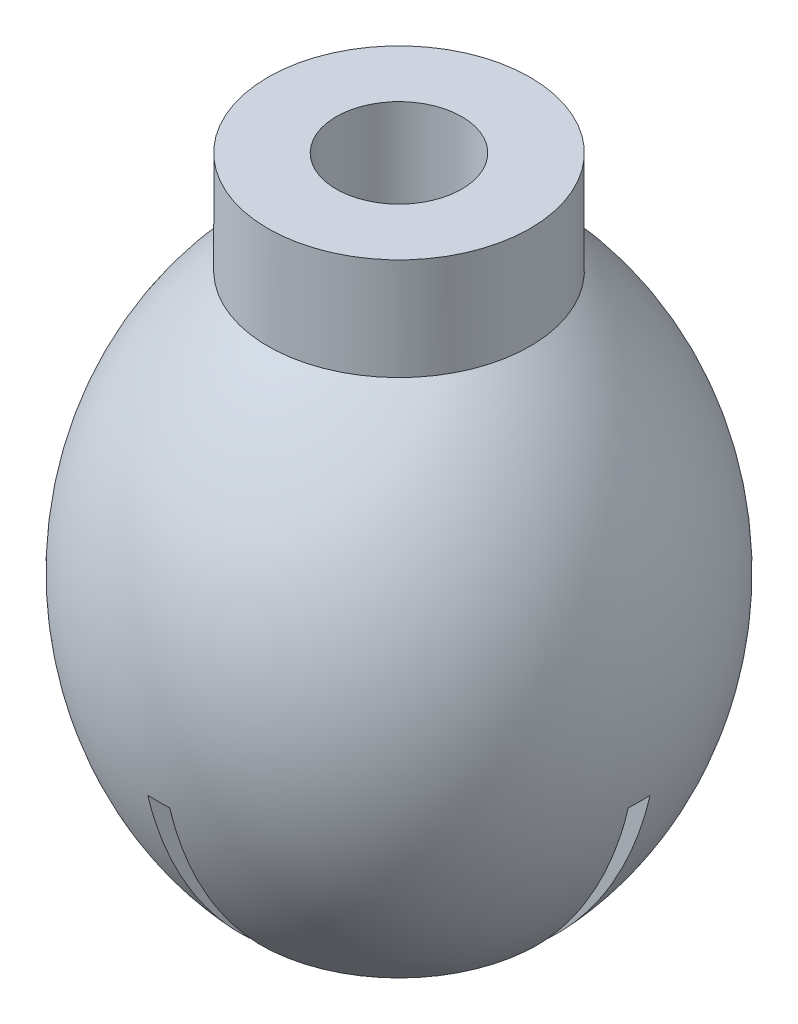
ISO-10303-21;
HEADER;
FILE_DESCRIPTION(('STEP AP214'),'2;1');
FILE_NAME('part.step','',(''),(''),'','','');
FILE_SCHEMA(('AUTOMOTIVE_DESIGN { 1 0 10303 214 1 1 1 1 }'));
ENDSEC;
DATA;
#1=APPLICATION_CONTEXT('core data for automotive mechanical design processes');
#2=APPLICATION_PROTOCOL_DEFINITION('international standard','automotive_design',2000,#1);
#3=PRODUCT_CONTEXT('',#1,'mechanical');
#4=PRODUCT('Part','Part','',(#3));
#5=PRODUCT_RELATED_PRODUCT_CATEGORY('part','',(#4));
#6=PRODUCT_DEFINITION_FORMATION('','',#4);
#7=PRODUCT_DEFINITION_CONTEXT('part definition',#1,'design');
#8=PRODUCT_DEFINITION('design','',#6,#7);
#9=PRODUCT_DEFINITION_SHAPE('','',#8);
#10=(LENGTH_UNIT() NAMED_UNIT(*) SI_UNIT(.MILLI.,.METRE.));
#11=(NAMED_UNIT(*) PLANE_ANGLE_UNIT() SI_UNIT($,.RADIAN.));
#12=(NAMED_UNIT(*) SI_UNIT($,.STERADIAN.) SOLID_ANGLE_UNIT());
#13=UNCERTAINTY_MEASURE_WITH_UNIT(LENGTH_MEASURE(1.E-05),#10,'distance_accuracy_value','');
#14=(GEOMETRIC_REPRESENTATION_CONTEXT(3) GLOBAL_UNCERTAINTY_ASSIGNED_CONTEXT((#13)) GLOBAL_UNIT_ASSIGNED_CONTEXT((#10,
#11,#12)) REPRESENTATION_CONTEXT('',''));
#15=CARTESIAN_POINT('',(0.,0.,0.));
#16=DIRECTION('',(0.,0.,1.));
#17=DIRECTION('',(1.,0.,0.));
#18=AXIS2_PLACEMENT_3D('',#15,#16,#17);
#19=CARTESIAN_POINT('',(0.,6.223,0.));
#20=DIRECTION('',(0.,-1.,0.));
#21=DIRECTION('',(-1.,0.,0.));
#22=AXIS2_PLACEMENT_3D('',#19,#20,#21);
#23=SPHERICAL_SURFACE('',#22,6.223);
#24=CARTESIAN_POINT('',(0.,6.223,0.508));
#25=DIRECTION('',(0.,0.,1.));
#26=DIRECTION('',(1.,0.,0.));
#27=AXIS2_PLACEMENT_3D('',#24,#25,#26);
#28=CIRCLE('',#27,6.20223064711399);
#29=CARTESIAN_POINT('',(-5.63677269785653,3.63563482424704,0.508));
#30=VERTEX_POINT('',#29);
#31=CARTESIAN_POINT('',(-2.87904078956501,11.71652247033,0.508));
#32=VERTEX_POINT('',#31);
#33=EDGE_CURVE('E235',#30,#32,#28,.F.);
#34=ORIENTED_EDGE('',*,*,#33,.T.);
#35=CARTESIAN_POINT('',(0.,11.71652247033,0.));
#36=DIRECTION('',(0.,-1.,0.));
#37=DIRECTION('',(0.,0.,-1.));
#38=AXIS2_PLACEMENT_3D('',#35,#36,#37);
#39=CIRCLE('',#38,2.92351498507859);
#40=CARTESIAN_POINT('',(-0.508,11.71652247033,2.87904078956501));
#41=VERTEX_POINT('',#40);
#42=EDGE_CURVE('E249',#32,#41,#39,.F.);
#43=ORIENTED_EDGE('',*,*,#42,.T.);
#44=CARTESIAN_POINT('',(-0.508,6.223,0.));
#45=DIRECTION('',(-1.,0.,0.));
#46=DIRECTION('',(0.,0.,1.));
#47=AXIS2_PLACEMENT_3D('',#44,#45,#46);
#48=CIRCLE('',#47,6.20223064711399);
#49=CARTESIAN_POINT('',(-0.508,3.63563482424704,5.63677269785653));
#50=VERTEX_POINT('',#49);
#51=EDGE_CURVE('E233',#41,#50,#48,.F.);
#52=ORIENTED_EDGE('',*,*,#51,.T.);
#53=CARTESIAN_POINT('',(0.,3.63563482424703,0.));
#54=DIRECTION('',(0.,-1.,0.));
#55=DIRECTION('',(0.,0.,-1.));
#56=AXIS2_PLACEMENT_3D('',#53,#54,#55);
#57=CIRCLE('',#56,5.6596175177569);
#58=EDGE_CURVE('E459',#50,#30,#57,.T.);
#59=ORIENTED_EDGE('',*,*,#58,.T.);
#60=EDGE_LOOP('',(#34,#43,#52,#59));
#61=FACE_BOUND('',#60,.T.);
#62=ADVANCED_FACE('F33',(#61),#23,.F.);
#63=CARTESIAN_POINT('',(0.508,6.223,0.));
#64=DIRECTION('',(1.,0.,0.));
#65=DIRECTION('',(0.,0.,-1.));
#66=AXIS2_PLACEMENT_3D('',#63,#64,#65);
#67=CIRCLE('',#66,6.20223064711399);
#68=CARTESIAN_POINT('',(0.508,3.63563482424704,5.63677269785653));
#69=VERTEX_POINT('',#68);
#70=CARTESIAN_POINT('',(0.508,11.71652247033,2.87904078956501));
#71=VERTEX_POINT('',#70);
#72=EDGE_CURVE('E230',#69,#71,#67,.F.);
#73=ORIENTED_EDGE('',*,*,#72,.T.);
#74=CARTESIAN_POINT('',(0.,11.71652247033,0.));
#75=DIRECTION('',(0.,-1.,0.));
#76=DIRECTION('',(0.,0.,-1.));
#77=AXIS2_PLACEMENT_3D('',#74,#75,#76);
#78=CIRCLE('',#77,2.92351498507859);
#79=CARTESIAN_POINT('',(2.87904078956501,11.71652247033,0.508));
#80=VERTEX_POINT('',#79);
#81=EDGE_CURVE('E247',#71,#80,#78,.F.);
#82=ORIENTED_EDGE('',*,*,#81,.T.);
#83=CARTESIAN_POINT('',(0.,6.223,0.508));
#84=DIRECTION('',(0.,0.,1.));
#85=DIRECTION('',(1.,0.,0.));
#86=AXIS2_PLACEMENT_3D('',#83,#84,#85);
#87=CIRCLE('',#86,6.20223064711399);
#88=CARTESIAN_POINT('',(5.63677269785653,3.63563482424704,0.508));
#89=VERTEX_POINT('',#88);
#90=EDGE_CURVE('E225',#80,#89,#87,.F.);
#91=ORIENTED_EDGE('',*,*,#90,.T.);
#92=EDGE_CURVE('E196',#89,#69,#57,.T.);
#93=ORIENTED_EDGE('',*,*,#92,.T.);
#94=EDGE_LOOP('',(#73,#82,#91,#93));
#95=FACE_BOUND('',#94,.T.);
#96=ADVANCED_FACE('F365',(#95),#23,.F.);
#97=CARTESIAN_POINT('',(0.,6.223,-0.508));
#98=DIRECTION('',(0.,0.,-1.));
#99=DIRECTION('',(-1.,0.,0.));
#100=AXIS2_PLACEMENT_3D('',#97,#98,#99);
#101=CIRCLE('',#100,6.20223064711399);
#102=CARTESIAN_POINT('',(5.63677269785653,3.63563482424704,-0.508));
#103=VERTEX_POINT('',#102);
#104=CARTESIAN_POINT('',(2.87904078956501,11.71652247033,-0.508));
#105=VERTEX_POINT('',#104);
#106=EDGE_CURVE('E227',#103,#105,#101,.F.);
#107=ORIENTED_EDGE('',*,*,#106,.T.);
#108=CARTESIAN_POINT('',(0.,11.71652247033,0.));
#109=DIRECTION('',(0.,-1.,0.));
#110=DIRECTION('',(0.,0.,-1.));
#111=AXIS2_PLACEMENT_3D('',#108,#109,#110);
#112=CIRCLE('',#111,2.92351498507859);
#113=CARTESIAN_POINT('',(0.508,11.71652247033,-2.87904078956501));
#114=VERTEX_POINT('',#113);
#115=EDGE_CURVE('E245',#105,#114,#112,.F.);
#116=ORIENTED_EDGE('',*,*,#115,.T.);
#117=CARTESIAN_POINT('',(0.508,6.223,0.));
#118=DIRECTION('',(1.,0.,0.));
#119=DIRECTION('',(0.,0.,-1.));
#120=AXIS2_PLACEMENT_3D('',#117,#118,#119);
#121=CIRCLE('',#120,6.20223064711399);
#122=CARTESIAN_POINT('',(0.508,3.63563482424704,-5.63677269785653));
#123=VERTEX_POINT('',#122);
#124=EDGE_CURVE('E223',#114,#123,#121,.F.);
#125=ORIENTED_EDGE('',*,*,#124,.T.);
#126=EDGE_CURVE('E213',#123,#103,#57,.T.);
#127=ORIENTED_EDGE('',*,*,#126,.T.);
#128=EDGE_LOOP('',(#107,#116,#125,#127));
#129=FACE_BOUND('',#128,.T.);
#130=ADVANCED_FACE('F371',(#129),#23,.F.);
#131=CARTESIAN_POINT('',(-6.45869133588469,3.63563482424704,0.));
#132=DIRECTION('',(0.,1.,0.));
#133=DIRECTION('',(0.,0.,1.));
#134=AXIS2_PLACEMENT_3D('',#131,#132,#133);
#135=PLANE('',#134);
#136=CARTESIAN_POINT('',(0.,3.63563482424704,0.));
#137=DIRECTION('',(0.,-1.,0.));
#138=DIRECTION('',(0.,0.,-1.));
#139=AXIS2_PLACEMENT_3D('',#136,#137,#138);
#140=CIRCLE('',#139,6.45869133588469);
#141=CARTESIAN_POINT('',(0.508,3.63563482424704,-6.438682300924));
#142=VERTEX_POINT('',#141);
#143=CARTESIAN_POINT('',(6.438682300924,3.63563482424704,-0.508));
#144=VERTEX_POINT('',#143);
#145=EDGE_CURVE('E204',#142,#144,#140,.T.);
#146=ORIENTED_EDGE('',*,*,#145,.T.);
#147=DIRECTION('',(1.,0.,0.));
#148=VECTOR('',#147,1.);
#149=CARTESIAN_POINT('',(0.508,3.63563482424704,-0.508));
#150=LINE('',#149,#148);
#151=EDGE_CURVE('E435',#103,#144,#150,.T.);
#152=ORIENTED_EDGE('',*,*,#151,.F.);
#153=ORIENTED_EDGE('',*,*,#126,.F.);
#154=DIRECTION('',(0.,0.,1.));
#155=VECTOR('',#154,1.);
#156=CARTESIAN_POINT('',(0.508,3.63563482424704,-0.508));
#157=LINE('',#156,#155);
#158=EDGE_CURVE('E433',#142,#123,#157,.T.);
#159=ORIENTED_EDGE('',*,*,#158,.F.);
#160=EDGE_LOOP('',(#146,#152,#153,#159));
#161=FACE_BOUND('',#160,.T.);
#162=ADVANCED_FACE('F383',(#161),#135,.F.);
#163=CARTESIAN_POINT('',(-6.438682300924,3.63563482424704,-0.508));
#164=VERTEX_POINT('',#163);
#165=CARTESIAN_POINT('',(-0.508,3.63563482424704,-6.438682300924));
#166=VERTEX_POINT('',#165);
#167=EDGE_CURVE('E209',#164,#166,#140,.T.);
#168=ORIENTED_EDGE('',*,*,#167,.T.);
#169=DIRECTION('',(0.,0.,-1.));
#170=VECTOR('',#169,1.);
#171=CARTESIAN_POINT('',(-0.508,3.63563482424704,-0.508));
#172=LINE('',#171,#170);
#173=CARTESIAN_POINT('',(-0.508,3.63563482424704,-5.63677269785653));
#174=VERTEX_POINT('',#173);
#175=EDGE_CURVE('E431',#174,#166,#172,.T.);
#176=ORIENTED_EDGE('',*,*,#175,.F.);
#177=CARTESIAN_POINT('',(-5.63677269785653,3.63563482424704,-0.508));
#178=VERTEX_POINT('',#177);
#179=EDGE_CURVE('E495',#178,#174,#57,.T.);
#180=ORIENTED_EDGE('',*,*,#179,.F.);
#181=DIRECTION('',(1.,0.,0.));
#182=VECTOR('',#181,1.);
#183=CARTESIAN_POINT('',(-12.2114986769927,3.63563482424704,-0.508));
#184=LINE('',#183,#182);
#185=EDGE_CURVE('E428',#164,#178,#184,.T.);
#186=ORIENTED_EDGE('',*,*,#185,.F.);
#187=EDGE_LOOP('',(#168,#176,#180,#186));
#188=FACE_BOUND('',#187,.T.);
#189=ADVANCED_FACE('F390',(#188),#135,.F.);
#190=CARTESIAN_POINT('',(-0.508,3.63563482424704,6.438682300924));
#191=VERTEX_POINT('',#190);
#192=CARTESIAN_POINT('',(-6.438682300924,3.63563482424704,0.508));
#193=VERTEX_POINT('',#192);
#194=EDGE_CURVE('E205',#191,#193,#140,.T.);
#195=ORIENTED_EDGE('',*,*,#194,.T.);
#196=DIRECTION('',(-1.,0.,0.));
#197=VECTOR('',#196,1.);
#198=CARTESIAN_POINT('',(-12.2114986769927,3.63563482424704,0.508));
#199=LINE('',#198,#197);
#200=EDGE_CURVE('E426',#30,#193,#199,.T.);
#201=ORIENTED_EDGE('',*,*,#200,.F.);
#202=ORIENTED_EDGE('',*,*,#58,.F.);
#203=DIRECTION('',(0.,0.,-1.));
#204=VECTOR('',#203,1.);
#205=CARTESIAN_POINT('',(-0.508,3.63563482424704,12.2114986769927));
#206=LINE('',#205,#204);
#207=EDGE_CURVE('E423',#191,#50,#206,.T.);
#208=ORIENTED_EDGE('',*,*,#207,.F.);
#209=EDGE_LOOP('',(#195,#201,#202,#208));
#210=FACE_BOUND('',#209,.T.);
#211=ADVANCED_FACE('F384',(#210),#135,.F.);
#212=CARTESIAN_POINT('',(-6.096,32.3011000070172,0.));
#213=DIRECTION('',(0.,-1.,0.));
#214=DIRECTION('',(0.,0.,-1.));
#215=AXIS2_PLACEMENT_3D('',#212,#213,#214);
#216=PLANE('',#215);
#217=CARTESIAN_POINT('',(0.,32.3011000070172,0.));
#218=DIRECTION('',(0.,-1.,0.));
#219=DIRECTION('',(0.,0.,-1.));
#220=AXIS2_PLACEMENT_3D('',#217,#218,#219);
#221=CIRCLE('',#220,6.096);
#222=CARTESIAN_POINT('',(0.,32.3011000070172,-6.096));
#223=VERTEX_POINT('',#222);
#224=EDGE_CURVE('E217',#223,#223,#221,.T.);
#225=ORIENTED_EDGE('',*,*,#224,.F.);
#226=EDGE_LOOP('',(#225));
#227=FACE_BOUND('',#226,.T.);
#228=CARTESIAN_POINT('',(0.,32.3011000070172,0.));
#229=DIRECTION('',(0.,-1.,0.));
#230=DIRECTION('',(0.,0.,-1.));
#231=AXIS2_PLACEMENT_3D('',#228,#229,#230);
#232=CIRCLE('',#231,2.921);
#233=CARTESIAN_POINT('',(0.,32.3011000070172,-2.921));
#234=VERTEX_POINT('',#233);
#235=EDGE_CURVE('E497',#234,#234,#232,.T.);
#236=ORIENTED_EDGE('',*,*,#235,.T.);
#237=EDGE_LOOP('',(#236));
#238=FACE_BOUND('',#237,.T.);
#239=ADVANCED_FACE('F651',(#227,#238),#216,.F.);
#240=CARTESIAN_POINT('',(0.,0.,0.));
#241=DIRECTION('',(0.,-1.,0.));
#242=DIRECTION('',(0.,0.,-1.));
#243=AXIS2_PLACEMENT_3D('',#240,#241,#242);
#244=CYLINDRICAL_SURFACE('',#243,6.096);
#245=CARTESIAN_POINT('',(0.,27.5598306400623,0.));
#246=DIRECTION('',(0.,-1.,0.));
#247=DIRECTION('',(0.,0.,-1.));
#248=AXIS2_PLACEMENT_3D('',#245,#246,#247);
#249=CIRCLE('',#248,6.096);
#250=CARTESIAN_POINT('',(0.,27.5598306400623,-6.096));
#251=VERTEX_POINT('',#250);
#252=EDGE_CURVE('E208',#251,#251,#249,.T.);
#253=ORIENTED_EDGE('',*,*,#252,.F.);
#254=EDGE_LOOP('',(#253));
#255=FACE_BOUND('',#254,.T.);
#256=ORIENTED_EDGE('',*,*,#224,.T.);
#257=EDGE_LOOP('',(#256));
#258=FACE_BOUND('',#257,.T.);
#259=ADVANCED_FACE('F291',(#255,#258),#244,.T.);
#260=CARTESIAN_POINT('',(0.,15.4346427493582,0.));
#261=DIRECTION('',(0.,-1.,0.));
#262=DIRECTION('',(0.,0.,-1.));
#263=AXIS2_PLACEMENT_3D('',#260,#261,#262);
#264=DEGENERATE_TOROIDAL_SURFACE('',#263,4.48055312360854,16.0898619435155,.F.);
#265=CARTESIAN_POINT('',(0.,11.763634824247,0.));
#266=DIRECTION('',(0.,-1.,0.));
#267=DIRECTION('',(0.,0.,-1.));
#268=AXIS2_PLACEMENT_3D('',#265,#266,#267);
#269=CIRCLE('',#268,11.1849298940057);
#270=CARTESIAN_POINT('',(11.1733877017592,11.763634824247,-0.508));
#271=VERTEX_POINT('',#270);
#272=CARTESIAN_POINT('',(11.1733877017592,11.763634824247,0.508));
#273=VERTEX_POINT('',#272);
#274=EDGE_CURVE('E188',#271,#273,#269,.T.);
#275=ORIENTED_EDGE('',*,*,#274,.F.);
#276=CARTESIAN_POINT('',(8.47956263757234,5.92019292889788,-0.508));
#277=CARTESIAN_POINT('',(8.21230177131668,5.556367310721,-0.508));
#278=CARTESIAN_POINT('',(7.92969998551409,5.20382846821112,-0.508));
#279=CARTESIAN_POINT('',(7.33566438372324,4.5236688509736,-0.508));
#280=CARTESIAN_POINT('',(7.02421843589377,4.19605866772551,-0.508));
#281=CARTESIAN_POINT('',(6.37515666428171,3.56864081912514,-0.508));
#282=CARTESIAN_POINT('',(6.03757084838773,3.26880211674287,-0.508));
#283=CARTESIAN_POINT('',(5.33846379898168,2.69884564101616,-0.508));
#284=CARTESIAN_POINT('',(4.97695397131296,2.42871386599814,-0.508));
#285=CARTESIAN_POINT('',(4.23227865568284,1.92001822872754,-0.508));
#286=CARTESIAN_POINT('',(3.8491131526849,1.68145438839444,-0.508));
#287=CARTESIAN_POINT('',(3.2600910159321,1.34892475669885,-0.508));
#288=CARTESIAN_POINT('',(3.06129904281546,1.24226791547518,-0.508));
#289=CARTESIAN_POINT('',(2.65924307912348,1.0377342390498,-0.508));
#290=CARTESIAN_POINT('',(2.45597952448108,0.939856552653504,-0.508));
#291=CARTESIAN_POINT('',(2.11716139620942,0.786077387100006,-0.508));
#292=CARTESIAN_POINT('',(1.98282275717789,0.727479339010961,-0.508));
#293=CARTESIAN_POINT('',(1.71236384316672,0.61448102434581,-0.508));
#294=CARTESIAN_POINT('',(1.57624339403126,0.560081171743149,-0.508));
#295=CARTESIAN_POINT('',(1.37064957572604,0.482068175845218,-0.508));
#296=CARTESIAN_POINT('',(1.30185680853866,0.456652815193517,-0.508));
#297=CARTESIAN_POINT('',(1.16378561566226,0.407180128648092,-0.508));
#298=CARTESIAN_POINT('',(1.09450721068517,0.38312274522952,-0.508));
#299=CARTESIAN_POINT('',(0.955397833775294,0.336617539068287,-0.508));
#300=CARTESIAN_POINT('',(0.885566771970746,0.314169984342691,-0.508));
#301=CARTESIAN_POINT('',(0.745268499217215,0.271372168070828,-0.508));
#302=CARTESIAN_POINT('',(0.674801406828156,0.251021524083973,-0.508));
#303=CARTESIAN_POINT('',(0.543592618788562,0.216214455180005,-0.508));
#304=CARTESIAN_POINT('',(0.482965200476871,0.201331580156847,-0.508));
#305=CARTESIAN_POINT('',(0.360958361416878,0.175046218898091,-0.508));
#306=CARTESIAN_POINT('',(0.299579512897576,0.163641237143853,-0.508));
#307=CARTESIAN_POINT('',(0.207164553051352,0.150720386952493,-0.508));
#308=CARTESIAN_POINT('',(0.176424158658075,0.147117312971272,-0.508));
#309=CARTESIAN_POINT('',(0.114798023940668,0.14155491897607,-0.508));
#310=CARTESIAN_POINT('',(0.0839123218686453,0.139595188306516,-0.508));
#311=CARTESIAN_POINT('',(0.0220973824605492,0.137503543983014,-0.508));
#312=CARTESIAN_POINT('',(-0.00883181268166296,0.137370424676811,-0.508));
#313=CARTESIAN_POINT('',(-0.0706411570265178,0.138941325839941,-0.508));
#314=CARTESIAN_POINT('',(-0.10152130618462,0.140645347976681,-0.508));
#315=CARTESIAN_POINT('',(-0.192036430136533,0.148117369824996,-0.508));
#316=CARTESIAN_POINT('',(-0.251479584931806,0.156197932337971,-0.508));
#317=CARTESIAN_POINT('',(-0.369631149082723,0.176663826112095,-0.508));
#318=CARTESIAN_POINT('',(-0.428338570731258,0.18905441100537,-0.508));
#319=CARTESIAN_POINT('',(-0.545405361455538,0.216626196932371,-0.508));
#320=CARTESIAN_POINT('',(-0.603761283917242,0.231821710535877,-0.508));
#321=CARTESIAN_POINT('',(-0.719916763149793,0.264070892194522,-0.508));
#322=CARTESIAN_POINT('',(-0.777716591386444,0.281123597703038,-0.508));
#323=CARTESIAN_POINT('',(-0.894449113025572,0.317091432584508,-0.508));
#324=CARTESIAN_POINT('',(-0.953370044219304,0.336044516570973,-0.508));
#325=CARTESIAN_POINT('',(-1.07082335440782,0.375121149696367,-0.508));
#326=CARTESIAN_POINT('',(-1.12935571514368,0.395244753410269,-0.508));
#327=CARTESIAN_POINT('',(-1.30406726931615,0.456977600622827,-0.508));
#328=CARTESIAN_POINT('',(-1.41972603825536,0.500064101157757,-0.508));
#329=CARTESIAN_POINT('',(-1.63505358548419,0.583780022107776,-0.508));
#330=CARTESIAN_POINT('',(-1.73487540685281,0.62401882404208,-0.508));
#331=CARTESIAN_POINT('',(-1.93356865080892,0.706785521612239,-0.508));
#332=CARTESIAN_POINT('',(-2.03244003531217,0.749313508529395,-0.508));
#333=CARTESIAN_POINT('',(-2.32765499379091,0.880150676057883,-0.508));
#334=CARTESIAN_POINT('',(-2.52257073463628,0.971701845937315,-0.508));
#335=CARTESIAN_POINT('',(-2.90876532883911,1.16308326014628,-0.508));
#336=CARTESIAN_POINT('',(-3.10003622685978,1.26292952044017,-0.508));
#337=CARTESIAN_POINT('',(-3.47826778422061,1.47041405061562,-0.508));
#338=CARTESIAN_POINT('',(-3.66522882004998,1.57805163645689,-0.508));
#339=CARTESIAN_POINT('',(-4.21331023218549,1.90869218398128,-0.508));
#340=CARTESIAN_POINT('',(-4.56795091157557,2.14256977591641,-0.508));
#341=CARTESIAN_POINT('',(-5.25717311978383,2.63761935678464,-0.508));
#342=CARTESIAN_POINT('',(-5.5917691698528,2.89877120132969,-0.508));
#343=CARTESIAN_POINT('',(-6.24025571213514,3.4477143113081,-0.508));
#344=CARTESIAN_POINT('',(-6.55407452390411,3.73559032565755,-0.508));
#345=CARTESIAN_POINT('',(-7.15789456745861,4.33544201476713,-0.508));
#346=CARTESIAN_POINT('',(-7.44789053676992,4.64742298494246,-0.508));
#347=CARTESIAN_POINT('',(-8.0037879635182,5.29531680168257,-0.508));
#348=CARTESIAN_POINT('',(-8.26953990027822,5.63135797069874,-0.508));
#349=CARTESIAN_POINT('',(-8.7733433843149,6.32357780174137,-0.508));
#350=CARTESIAN_POINT('',(-9.01139568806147,6.67975591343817,-0.508));
#351=CARTESIAN_POINT('',(-9.47055250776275,7.43000795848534,-0.508));
#352=CARTESIAN_POINT('',(-9.69001380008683,7.82508897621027,-0.508));
#353=CARTESIAN_POINT('',(-10.0948993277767,8.63234322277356,-0.508));
#354=CARTESIAN_POINT('',(-10.2803216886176,9.04451739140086,-0.508));
#355=CARTESIAN_POINT('',(-10.6155222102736,9.88230252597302,-0.508));
#356=CARTESIAN_POINT('',(-10.765360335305,10.3078894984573,-0.508));
#357=CARTESIAN_POINT('',(-11.0287370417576,11.1701436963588,-0.508));
#358=CARTESIAN_POINT('',(-11.1422761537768,11.6068107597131,-0.508));
#359=CARTESIAN_POINT('',(-11.3324559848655,12.4890657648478,-0.508));
#360=CARTESIAN_POINT('',(-11.4090189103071,12.9346704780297,-0.508));
#361=CARTESIAN_POINT('',(-11.5243490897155,13.8307467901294,-0.508));
#362=CARTESIAN_POINT('',(-11.563116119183,14.2812184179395,-0.508));
#363=CARTESIAN_POINT('',(-11.6025856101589,15.1839764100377,-0.508));
#364=CARTESIAN_POINT('',(-11.6032754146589,15.6362633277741,-0.508));
#365=CARTESIAN_POINT('',(-11.5665536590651,16.5392869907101,-0.508));
#366=CARTESIAN_POINT('',(-11.5291421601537,16.9900237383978,-0.508));
#367=CARTESIAN_POINT('',(-11.4164893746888,17.8866950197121,-0.508));
#368=CARTESIAN_POINT('',(-11.3412521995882,18.3326300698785,-0.508));
#369=CARTESIAN_POINT('',(-11.1534834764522,19.2165789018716,-0.508));
#370=CARTESIAN_POINT('',(-11.0409518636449,19.6545926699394,-0.508));
#371=CARTESIAN_POINT('',(-10.7793467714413,20.5197340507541,-0.508));
#372=CARTESIAN_POINT('',(-10.630260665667,20.9468578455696,-0.508));
#373=CARTESIAN_POINT('',(-10.2966248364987,21.7870203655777,-0.508));
#374=CARTESIAN_POINT('',(-10.1120752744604,22.2000591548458,-0.508));
#375=CARTESIAN_POINT('',(-9.70878415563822,23.0091860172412,-0.508));
#376=CARTESIAN_POINT('',(-9.49003642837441,23.4052710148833,-0.508));
#377=CARTESIAN_POINT('',(-9.01991960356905,24.177594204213,-0.508));
#378=CARTESIAN_POINT('',(-8.76854991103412,24.5538320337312,-0.508));
#379=CARTESIAN_POINT('',(-8.23521634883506,25.2834330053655,-0.508));
#380=CARTESIAN_POINT('',(-7.95328060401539,25.6368167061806,-0.508));
#381=CARTESIAN_POINT('',(-7.36062069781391,26.3185544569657,-0.508));
#382=CARTESIAN_POINT('',(-7.04989664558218,26.6469086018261,-0.508));
#383=CARTESIAN_POINT('',(-6.4019527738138,27.2761210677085,-0.508));
#384=CARTESIAN_POINT('',(-6.06474197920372,27.5769886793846,-0.508));
#385=CARTESIAN_POINT('',(-5.36603228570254,28.1492061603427,-0.508));
#386=CARTESIAN_POINT('',(-5.00452781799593,28.4205492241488,-0.508));
#387=CARTESIAN_POINT('',(-4.25957266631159,28.9317252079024,-0.508));
#388=CARTESIAN_POINT('',(-3.8761127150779,29.1715446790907,-0.508));
#389=CARTESIAN_POINT('',(-3.28676157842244,29.5057743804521,-0.508));
#390=CARTESIAN_POINT('',(-3.08798988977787,29.6129165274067,-0.508));
#391=CARTESIAN_POINT('',(-2.68596531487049,29.8184154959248,-0.508));
#392=CARTESIAN_POINT('',(-2.48271312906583,29.9167736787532,-0.508));
#393=CARTESIAN_POINT('',(-2.14299706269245,30.0717701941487,-0.508));
#394=CARTESIAN_POINT('',(-2.00774150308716,30.1310740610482,-0.508));
#395=CARTESIAN_POINT('',(-1.73543380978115,30.2454361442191,-0.508));
#396=CARTESIAN_POINT('',(-1.59838165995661,30.3004943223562,-0.508));
#397=CARTESIAN_POINT('',(-1.3913585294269,30.3794803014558,-0.508));
#398=CARTESIAN_POINT('',(-1.32207567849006,30.4052204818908,-0.508));
#399=CARTESIAN_POINT('',(-1.18302028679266,30.4553396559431,-0.508));
#400=CARTESIAN_POINT('',(-1.1132477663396,30.4797187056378,-0.508));
#401=CARTESIAN_POINT('',(-0.973151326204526,30.5268707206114,-0.508));
#402=CARTESIAN_POINT('',(-0.902827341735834,30.5496434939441,-0.508));
#403=CARTESIAN_POINT('',(-0.761543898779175,30.5931125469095,-0.508));
#404=CARTESIAN_POINT('',(-0.690584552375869,30.6138091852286,-0.508));
#405=CARTESIAN_POINT('',(-0.558663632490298,30.6492523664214,-0.508));
#406=CARTESIAN_POINT('',(-0.497817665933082,30.6644252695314,-0.508));
#407=CARTESIAN_POINT('',(-0.375368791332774,30.6913929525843,-0.508));
#408=CARTESIAN_POINT('',(-0.313766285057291,30.7031894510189,-0.508));
#409=CARTESIAN_POINT('',(-0.221024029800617,30.7167879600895,-0.508));
#410=CARTESIAN_POINT('',(-0.190187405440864,30.7206301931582,-0.508));
#411=CARTESIAN_POINT('',(-0.128358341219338,30.7266949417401,-0.508));
#412=CARTESIAN_POINT('',(-0.0973659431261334,30.7289178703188,-0.508));
#413=CARTESIAN_POINT('',(-0.0353300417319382,30.7315383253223,-0.508));
#414=CARTESIAN_POINT('',(-0.004286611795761,30.7319375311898,-0.508));
#415=CARTESIAN_POINT('',(0.0577658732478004,30.7308752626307,-0.508));
#416=CARTESIAN_POINT('',(0.0887749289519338,30.7294138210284,-0.508));
#417=CARTESIAN_POINT('',(0.177270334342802,30.722769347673,-0.508));
#418=CARTESIAN_POINT('',(0.234597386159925,30.7154668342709,-0.508));
#419=CARTESIAN_POINT('',(0.348570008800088,30.6966663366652,-0.508));
#420=CARTESIAN_POINT('',(0.405214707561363,30.6851634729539,-0.508));
#421=CARTESIAN_POINT('',(0.518172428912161,30.659400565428,-0.508));
#422=CARTESIAN_POINT('',(0.574482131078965,30.645126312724,-0.508));
#423=CARTESIAN_POINT('',(0.686565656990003,30.6147374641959,-0.508));
#424=CARTESIAN_POINT('',(0.74233972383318,30.5986237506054,-0.508));
#425=CARTESIAN_POINT('',(0.854971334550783,30.5645853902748,-0.508));
#426=CARTESIAN_POINT('',(0.911817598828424,30.5466236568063,-0.508));
#427=CARTESIAN_POINT('',(1.02513814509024,30.5095601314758,-0.508));
#428=CARTESIAN_POINT('',(1.08161240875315,30.4904582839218,-0.508));
#429=CARTESIAN_POINT('',(1.25019013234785,30.4318366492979,-0.508));
#430=CARTESIAN_POINT('',(1.36179934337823,30.3908919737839,-0.508));
#431=CARTESIAN_POINT('',(1.57260392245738,30.3101941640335,-0.508));
#432=CARTESIAN_POINT('',(1.67191412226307,30.2707386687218,-0.508));
#433=CARTESIAN_POINT('',(1.86959658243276,30.1895362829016,-0.508));
#434=CARTESIAN_POINT('',(1.96796880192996,30.1477892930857,-0.508));
#435=CARTESIAN_POINT('',(2.26171219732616,30.0193088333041,-0.508));
#436=CARTESIAN_POINT('',(2.45568021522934,29.9293474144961,-0.508));
#437=CARTESIAN_POINT('',(2.84006078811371,29.7412183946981,-0.508));
#438=CARTESIAN_POINT('',(3.03046555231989,29.6430349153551,-0.508));
#439=CARTESIAN_POINT('',(3.40705698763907,29.4389521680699,-0.508));
#440=CARTESIAN_POINT('',(3.5932440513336,29.3330536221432,-0.508));
#441=CARTESIAN_POINT('',(4.13927405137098,29.0076300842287,-0.508));
#442=CARTESIAN_POINT('',(4.49277598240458,28.7773334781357,-0.508));
#443=CARTESIAN_POINT('',(5.18014269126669,28.2896965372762,-0.508));
#444=CARTESIAN_POINT('',(5.51402178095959,28.0323763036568,-0.508));
#445=CARTESIAN_POINT('',(6.161464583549,27.4913741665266,-0.508));
#446=CARTESIAN_POINT('',(6.47496238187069,27.2076133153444,-0.508));
#447=CARTESIAN_POINT('',(7.07863898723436,26.61616593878,-0.508));
#448=CARTESIAN_POINT('',(7.36881264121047,26.3084741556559,-0.508));
#449=CARTESIAN_POINT('',(7.92554249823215,25.6693600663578,-0.508));
#450=CARTESIAN_POINT('',(8.19195671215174,25.3378140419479,-0.508));
#451=CARTESIAN_POINT('',(8.69764451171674,24.6546539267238,-0.508));
#452=CARTESIAN_POINT('',(8.9369187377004,24.3030403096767,-0.508));
#453=CARTESIAN_POINT('',(9.40088610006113,23.55943450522,-0.508));
#454=CARTESIAN_POINT('',(9.6237381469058,23.1662917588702,-0.508));
#455=CARTESIAN_POINT('',(10.0355589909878,22.362621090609,-0.508));
#456=CARTESIAN_POINT('',(10.2245257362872,21.9520921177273,-0.508));
#457=CARTESIAN_POINT('',(10.5669332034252,21.117300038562,-0.508));
#458=CARTESIAN_POINT('',(10.7204344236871,20.6930617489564,-0.508));
#459=CARTESIAN_POINT('',(10.9912401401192,19.8331942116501,-0.508));
#460=CARTESIAN_POINT('',(11.1085452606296,19.3975651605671,-0.508));
#461=CARTESIAN_POINT('',(11.306323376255,18.5171519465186,-0.508));
#462=CARTESIAN_POINT('',(11.3867257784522,18.0723519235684,-0.508));
#463=CARTESIAN_POINT('',(11.5097998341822,17.1775575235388,-0.508));
#464=CARTESIAN_POINT('',(11.5524710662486,16.7275630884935,-0.508));
#465=CARTESIAN_POINT('',(11.5997994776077,15.825189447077,-0.508));
#466=CARTESIAN_POINT('',(11.604423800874,15.3728085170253,-0.508));
#467=CARTESIAN_POINT('',(11.5755396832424,14.4692753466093,-0.508));
#468=CARTESIAN_POINT('',(11.542032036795,14.0181230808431,-0.508));
#469=CARTESIAN_POINT('',(11.4370833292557,13.1199069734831,-0.508));
#470=CARTESIAN_POINT('',(11.3656136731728,12.6728464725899,-0.508));
#471=CARTESIAN_POINT('',(11.1852314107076,11.7863443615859,-0.508));
#472=CARTESIAN_POINT('',(11.0763187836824,11.3469027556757,-0.508));
#473=CARTESIAN_POINT('',(10.8220390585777,10.479503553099,-0.508));
#474=CARTESIAN_POINT('',(10.6767340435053,10.0515277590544,-0.508));
#475=CARTESIAN_POINT('',(10.350665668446,9.20947489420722,-0.508));
#476=CARTESIAN_POINT('',(10.1699140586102,8.79539327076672,-0.508));
#477=CARTESIAN_POINT('',(9.76105959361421,7.95698118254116,-0.508));
#478=CARTESIAN_POINT('',(9.53061144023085,7.53379223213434,-0.508));
#479=CARTESIAN_POINT('',(9.03247070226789,6.70950486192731,-0.508));
#480=CARTESIAN_POINT('',(8.76475067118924,6.3084230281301,-0.508));
#481=CARTESIAN_POINT('',(8.47956263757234,5.92019292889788,-0.508));
#482=B_SPLINE_CURVE_WITH_KNOTS('',3,(#276,#277,#278,#279,#280,#281,#282,#283,#284,#285,#286,
#287,#288,#289,#290,#291,#292,#293,#294,#295,#296,#297,#298,#299,#300,#301,#302,#303,#304,#305,
#306,#307,#308,#309,#310,#311,#312,#313,#314,#315,#316,#317,#318,#319,#320,#321,#322,#323,#324,
#325,#326,#327,#328,#329,#330,#331,#332,#333,#334,#335,#336,#337,#338,#339,#340,#341,#342,#343,
#344,#345,#346,#347,#348,#349,#350,#351,#352,#353,#354,#355,#356,#357,#358,#359,#360,#361,#362,
#363,#364,#365,#366,#367,#368,#369,#370,#371,#372,#373,#374,#375,#376,#377,#378,#379,#380,#381,
#382,#383,#384,#385,#386,#387,#388,#389,#390,#391,#392,#393,#394,#395,#396,#397,#398,#399,#400,
#401,#402,#403,#404,#405,#406,#407,#408,#409,#410,#411,#412,#413,#414,#415,#416,#417,#418,#419,
#420,#421,#422,#423,#424,#425,#426,#427,#428,#429,#430,#431,#432,#433,#434,#435,#436,#437,#438,
#439,#440,#441,#442,#443,#444,#445,#446,#447,#448,#449,#450,#451,#452,#453,#454,#455,#456,#457,
#458,#459,#460,#461,#462,#463,#464,#465,#466,#467,#468,#469,#470,#471,#472,#473,#474,#475,#476,
#477,#478,#479,#480,#481),.UNSPECIFIED.,.T.,.F.,(4,2,2,2,2,2,2,2,2,2,2,2,2,2,2,2,2,2,2,2,2,2,2,
2,2,2,2,2,2,2,2,2,2,2,2,2,2,2,2,2,2,2,2,2,2,2,2,2,2,2,2,2,2,2,2,2,2,2,2,2,2,2,2,2,2,2,2,2,2,2,2,
2,2,2,2,2,2,2,2,2,2,2,2,2,2,2,2,2,2,2,2,2,2,2,2,2,2,2,2,2,2,2,4),(0.,1.35389178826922,
2.70835563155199,4.06128700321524,5.41357794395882,6.76586982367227,7.44249089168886,
8.11904628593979,8.55867769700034,8.99835240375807,9.21835423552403,9.43834674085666,
9.65837578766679,9.87836463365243,10.0655961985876,10.2526931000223,10.3455095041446,
10.438302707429,10.531034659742,10.6237666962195,10.8034627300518,10.9833785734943,
11.1642392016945,11.3450065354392,11.5306739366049,11.7163500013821,12.0865542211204,
12.4094070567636,12.7322727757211,13.3780964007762,14.0251973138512,14.6722414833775,
15.9452071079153,17.2172390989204,18.493452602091,19.7699472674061,21.0538463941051,
22.3377104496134,23.6919184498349,25.0462010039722,26.398184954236,27.7501491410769,
29.1049454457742,30.4597497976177,31.8150044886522,33.1702570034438,34.5253622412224,
35.8804698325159,37.2360461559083,38.5916163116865,39.9474313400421,41.303271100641,
42.657873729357,44.012471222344,45.3666091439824,46.7210585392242,48.0760839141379,
48.7533407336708,49.4304924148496,49.8734914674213,50.3164944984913,50.5382135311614,
50.7599234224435,50.9816597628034,51.2033577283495,51.3914377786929,51.5794219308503,
51.6726125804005,51.7657794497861,51.858860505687,51.9519399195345,52.1250519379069,
52.2983657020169,52.4725926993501,52.6467364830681,52.8255707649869,53.0044137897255,
53.3609985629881,53.6815527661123,54.002120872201,54.6433531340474,55.2858536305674,
55.928294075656,57.1925416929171,58.4558554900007,59.7230702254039,60.990564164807,
62.2651858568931,63.5397774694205,64.8938907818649,66.2480860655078,67.599953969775,
68.9517985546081,70.3062184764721,71.6606535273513,73.016258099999,74.3718344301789,
75.7284333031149,77.0850329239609,78.4393338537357,79.7931866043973,81.2368251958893,
82.6815325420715),.UNSPECIFIED.);
#483=EDGE_CURVE('E318',#271,#144,#482,.T.);
#484=ORIENTED_EDGE('',*,*,#483,.T.);
#485=ORIENTED_EDGE('',*,*,#145,.F.);
#486=CARTESIAN_POINT('',(0.508,5.92019292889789,-8.47956263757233));
#487=CARTESIAN_POINT('',(0.508,6.28428267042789,-8.74701549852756));
#488=CARTESIAN_POINT('',(0.508,6.65970862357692,-8.99913194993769));
#489=CARTESIAN_POINT('',(0.508,7.43051923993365,-9.47086013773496));
#490=CARTESIAN_POINT('',(0.508,7.82590772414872,-9.6904656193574));
#491=CARTESIAN_POINT('',(0.508,8.63344008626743,-10.09540822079));
#492=CARTESIAN_POINT('',(0.508,9.04556918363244,-10.2807748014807));
#493=CARTESIAN_POINT('',(0.508,9.88394590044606,-10.6161473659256));
#494=CARTESIAN_POINT('',(0.508,10.3101928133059,-10.7661551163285));
#495=CARTESIAN_POINT('',(0.508,11.1739724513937,-11.0298146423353));
#496=CARTESIAN_POINT('',(0.508,11.6115096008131,-11.143451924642));
#497=CARTESIAN_POINT('',(0.508,12.4946036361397,-11.3334847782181));
#498=CARTESIAN_POINT('',(0.508,12.9401606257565,-11.4098798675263));
#499=CARTESIAN_POINT('',(0.508,13.8362873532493,-11.524905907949));
#500=CARTESIAN_POINT('',(0.508,14.2868588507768,-11.5635231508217));
#501=CARTESIAN_POINT('',(0.508,15.1896521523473,-11.6026712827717));
#502=CARTESIAN_POINT('',(0.508,15.6418739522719,-11.6032022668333));
#503=CARTESIAN_POINT('',(0.508,16.5449602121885,-11.566165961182));
#504=CARTESIAN_POINT('',(0.508,16.995823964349,-11.5285814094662));
#505=CARTESIAN_POINT('',(0.508,17.8927815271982,-11.4155545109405));
#506=CARTESIAN_POINT('',(0.508,18.3388753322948,-11.3401121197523));
#507=CARTESIAN_POINT('',(0.508,19.2228828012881,-11.1519552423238));
#508=CARTESIAN_POINT('',(0.508,19.6608007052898,-11.0392606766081));
#509=CARTESIAN_POINT('',(0.508,20.5255874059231,-10.7773881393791));
#510=CARTESIAN_POINT('',(0.508,20.9524562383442,-10.6282102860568));
#511=CARTESIAN_POINT('',(0.508,21.7918045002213,-10.2945501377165));
#512=CARTESIAN_POINT('',(0.508,22.204294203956,-10.1100936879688));
#513=CARTESIAN_POINT('',(0.508,23.0122851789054,-9.70710897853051));
#514=CARTESIAN_POINT('',(0.508,23.4077862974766,-9.48858041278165));
#515=CARTESIAN_POINT('',(0.508,24.1797407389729,-9.01853741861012));
#516=CARTESIAN_POINT('',(0.508,24.5561551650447,-8.76695910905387));
#517=CARTESIAN_POINT('',(0.508,25.2864009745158,-8.23293866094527));
#518=CARTESIAN_POINT('',(0.508,25.6402330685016,-7.95049749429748));
#519=CARTESIAN_POINT('',(0.508,26.3235331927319,-7.35610310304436));
#520=CARTESIAN_POINT('',(0.508,26.6529455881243,-7.04408596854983));
#521=CARTESIAN_POINT('',(0.508,27.2841898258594,-6.39322874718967));
#522=CARTESIAN_POINT('',(0.508,27.5860221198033,-6.05438909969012));
#523=CARTESIAN_POINT('',(0.508,28.015356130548,-5.52911642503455));
#524=CARTESIAN_POINT('',(0.508,28.1541452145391,-5.35180280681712));
#525=CARTESIAN_POINT('',(0.508,28.4240752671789,-4.99151713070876));
#526=CARTESIAN_POINT('',(0.508,28.5552179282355,-4.80854633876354));
#527=CARTESIAN_POINT('',(0.508,28.9367382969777,-4.25169382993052));
#528=CARTESIAN_POINT('',(0.508,29.1754032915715,-3.86963354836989));
#529=CARTESIAN_POINT('',(0.508,29.4912940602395,-3.31215417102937));
#530=CARTESIAN_POINT('',(0.508,29.5823551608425,-3.14440717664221));
#531=CARTESIAN_POINT('',(0.508,29.7582657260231,-2.80562215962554));
#532=CARTESIAN_POINT('',(0.508,29.8431139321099,-2.63458347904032));
#533=CARTESIAN_POINT('',(0.508,30.0075004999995,-2.28685330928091));
#534=CARTESIAN_POINT('',(0.508,30.08694082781,-2.11011555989));
#535=CARTESIAN_POINT('',(0.508,30.2385422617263,-1.75378545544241));
#536=CARTESIAN_POINT('',(0.508,30.3107125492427,-1.57419704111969));
#537=CARTESIAN_POINT('',(0.508,30.400869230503,-1.33367471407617));
#538=CARTESIAN_POINT('',(0.508,30.4226584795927,-1.27415517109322));
#539=CARTESIAN_POINT('',(0.508,30.4652064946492,-1.15474863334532));
#540=CARTESIAN_POINT('',(0.508,30.4859652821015,-1.09486164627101));
#541=CARTESIAN_POINT('',(0.508,30.5263783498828,-0.97441350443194));
#542=CARTESIAN_POINT('',(0.508,30.5460272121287,-0.913850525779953));
#543=CARTESIAN_POINT('',(0.508,30.5838246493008,-0.792250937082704));
#544=CARTESIAN_POINT('',(0.508,30.601973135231,-0.731214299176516));
#545=CARTESIAN_POINT('',(0.508,30.6357722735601,-0.610176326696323));
#546=CARTESIAN_POINT('',(0.508,30.651476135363,-0.550190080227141));
#547=CARTESIAN_POINT('',(0.508,30.680011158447,-0.429501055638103));
#548=CARTESIAN_POINT('',(0.508,30.6928413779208,-0.368798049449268));
#549=CARTESIAN_POINT('',(0.508,30.71376930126,-0.247098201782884));
#550=CARTESIAN_POINT('',(0.508,30.721910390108,-0.18610949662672));
#551=CARTESIAN_POINT('',(0.508,30.7290871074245,-0.0942726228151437));
#552=CARTESIAN_POINT('',(0.508,30.7306408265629,-0.06362174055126));
#553=CARTESIAN_POINT('',(0.508,30.7319343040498,-0.00228115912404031));
#554=CARTESIAN_POINT('',(0.508,30.7316741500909,0.0284085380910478));
#555=CARTESIAN_POINT('',(0.508,30.7293488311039,0.090136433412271));
#556=CARTESIAN_POINT('',(0.508,30.7272591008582,0.1211736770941));
#557=CARTESIAN_POINT('',(0.508,30.7214373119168,0.183096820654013));
#558=CARTESIAN_POINT('',(0.508,30.7177048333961,0.21398267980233));
#559=CARTESIAN_POINT('',(0.508,30.7044602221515,0.306447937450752));
#560=CARTESIAN_POINT('',(0.508,30.6929065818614,0.36773091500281));
#561=CARTESIAN_POINT('',(0.508,30.6662604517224,0.490163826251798));
#562=CARTESIAN_POINT('',(0.508,30.6511313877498,0.551305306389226));
#563=CARTESIAN_POINT('',(0.508,30.6186389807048,0.672930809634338));
#564=CARTESIAN_POINT('',(0.508,30.6012774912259,0.73341533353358));
#565=CARTESIAN_POINT('',(0.508,30.5643489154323,0.855891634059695));
#566=CARTESIAN_POINT('',(0.508,30.5447278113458,0.917866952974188));
#567=CARTESIAN_POINT('',(0.508,30.5041492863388,1.0413800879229));
#568=CARTESIAN_POINT('',(0.508,30.4831917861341,1.10291787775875));
#569=CARTESIAN_POINT('',(0.508,30.4188777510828,1.28629473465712));
#570=CARTESIAN_POINT('',(0.508,30.3738745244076,1.40755785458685));
#571=CARTESIAN_POINT('',(0.508,30.2883155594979,1.62798004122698));
#572=CARTESIAN_POINT('',(0.508,30.2483228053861,1.7273596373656));
#573=CARTESIAN_POINT('',(0.508,30.1660643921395,1.92517712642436));
#574=CARTESIAN_POINT('',(0.508,30.1237986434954,2.02361498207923));
#575=CARTESIAN_POINT('',(0.508,29.9937739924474,2.31754369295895));
#576=CARTESIAN_POINT('',(0.508,29.9027990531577,2.51162062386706));
#577=CARTESIAN_POINT('',(0.508,29.7125700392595,2.89631646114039));
#578=CARTESIAN_POINT('',(0.508,29.613294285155,3.08692462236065));
#579=CARTESIAN_POINT('',(0.508,29.4070054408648,3.46387089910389));
#580=CARTESIAN_POINT('',(0.508,29.2999930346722,3.65020939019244));
#581=CARTESIAN_POINT('',(0.508,28.9718014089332,4.1956519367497));
#582=CARTESIAN_POINT('',(0.508,28.7398927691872,4.54837888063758));
#583=CARTESIAN_POINT('',(0.508,28.2491323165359,5.23400763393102));
#584=CARTESIAN_POINT('',(0.508,27.9903051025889,5.56692711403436));
#585=CARTESIAN_POINT('',(0.508,27.4460056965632,6.21274375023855));
#586=CARTESIAN_POINT('',(0.508,27.1604216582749,6.52554672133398));
#587=CARTESIAN_POINT('',(0.508,26.5653391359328,7.12766413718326));
#588=CARTESIAN_POINT('',(0.508,26.2558344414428,7.41697244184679));
#589=CARTESIAN_POINT('',(0.508,25.6130563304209,7.97183948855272));
#590=CARTESIAN_POINT('',(0.508,25.2796548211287,8.23724988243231));
#591=CARTESIAN_POINT('',(0.508,24.5928363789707,8.74073022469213));
#592=CARTESIAN_POINT('',(0.508,24.2394201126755,8.97880108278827));
#593=CARTESIAN_POINT('',(0.508,23.4929182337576,9.43962221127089));
#594=CARTESIAN_POINT('',(0.508,23.0987256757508,9.6605820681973));
#595=CARTESIAN_POINT('',(0.508,22.2931187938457,10.0685383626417));
#596=CARTESIAN_POINT('',(0.508,21.8817034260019,10.2555327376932));
#597=CARTESIAN_POINT('',(0.508,21.0452427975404,10.5939596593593));
#598=CARTESIAN_POINT('',(0.508,20.6202197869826,10.7454471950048));
#599=CARTESIAN_POINT('',(0.508,19.7589529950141,11.0121624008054));
#600=CARTESIAN_POINT('',(0.508,19.3227093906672,11.1273906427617));
#601=CARTESIAN_POINT('',(0.508,18.441170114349,11.3209777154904));
#602=CARTESIAN_POINT('',(0.508,17.995857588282,11.3992598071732));
#603=CARTESIAN_POINT('',(0.508,17.1002197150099,11.5180462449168));
#604=CARTESIAN_POINT('',(0.508,16.6498943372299,11.5585503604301));
#605=CARTESIAN_POINT('',(0.508,15.7473004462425,11.6014993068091));
#606=CARTESIAN_POINT('',(0.508,15.2950314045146,11.6039330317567));
#607=CARTESIAN_POINT('',(0.508,14.3918964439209,11.570695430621));
#608=CARTESIAN_POINT('',(0.508,13.9410305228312,11.5350241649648));
#609=CARTESIAN_POINT('',(0.508,13.0439218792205,11.4258316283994));
#610=CARTESIAN_POINT('',(0.508,12.5976789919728,11.3523117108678));
#611=CARTESIAN_POINT('',(0.508,11.7129713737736,11.1679438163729));
#612=CARTESIAN_POINT('',(0.508,11.2745066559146,11.0570957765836));
#613=CARTESIAN_POINT('',(0.508,10.4083645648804,10.7988251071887));
#614=CARTESIAN_POINT('',(0.508,9.98068992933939,10.6513932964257));
#615=CARTESIAN_POINT('',(0.508,9.13928742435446,10.3210155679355));
#616=CARTESIAN_POINT('',(0.508,8.7255594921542,10.1380698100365));
#617=CARTESIAN_POINT('',(0.508,7.91497336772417,9.73795075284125));
#618=CARTESIAN_POINT('',(0.508,7.51811602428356,9.52077573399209));
#619=CARTESIAN_POINT('',(0.508,6.74411459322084,9.05373987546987));
#620=CARTESIAN_POINT('',(0.508,6.36697085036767,8.80387846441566));
#621=CARTESIAN_POINT('',(0.508,5.63529723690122,8.27338776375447));
#622=CARTESIAN_POINT('',(0.508,5.28075506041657,7.9927754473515));
#623=CARTESIAN_POINT('',(0.508,4.59659686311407,7.40265568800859));
#624=CARTESIAN_POINT('',(0.508,4.26698075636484,7.09314834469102));
#625=CARTESIAN_POINT('',(0.508,3.63505884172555,6.44742989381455));
#626=CARTESIAN_POINT('',(0.508,3.33275167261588,6.11122011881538));
#627=CARTESIAN_POINT('',(0.508,2.75758802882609,5.41438144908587));
#628=CARTESIAN_POINT('',(0.508,2.48473814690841,5.05374711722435));
#629=CARTESIAN_POINT('',(0.508,1.97072431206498,4.31074144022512));
#630=CARTESIAN_POINT('',(0.508,1.72954463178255,3.92838102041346));
#631=CARTESIAN_POINT('',(0.508,1.39317268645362,3.34060527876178));
#632=CARTESIAN_POINT('',(0.508,1.28529947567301,3.14234600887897));
#633=CARTESIAN_POINT('',(0.508,1.07829586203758,2.74132379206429));
#634=CARTESIAN_POINT('',(0.508,0.979164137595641,2.53856153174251));
#635=CARTESIAN_POINT('',(0.508,0.821861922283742,2.1975467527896));
#636=CARTESIAN_POINT('',(0.508,0.761108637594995,2.06047812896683));
#637=CARTESIAN_POINT('',(0.508,0.64393157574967,1.78448560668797));
#638=CARTESIAN_POINT('',(0.508,0.587507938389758,1.64556164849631));
#639=CARTESIAN_POINT('',(0.508,0.506473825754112,1.435590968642));
#640=CARTESIAN_POINT('',(0.508,0.480031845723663,1.36524757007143));
#641=CARTESIAN_POINT('',(0.508,0.428518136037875,1.2240618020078));
#642=CARTESIAN_POINT('',(0.508,0.403446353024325,1.15321945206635));
#643=CARTESIAN_POINT('',(0.508,0.354906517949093,1.01098778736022));
#644=CARTESIAN_POINT('',(0.508,0.331438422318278,0.939598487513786));
#645=CARTESIAN_POINT('',(0.508,0.286539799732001,0.796186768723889));
#646=CARTESIAN_POINT('',(0.508,0.265108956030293,0.724164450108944));
#647=CARTESIAN_POINT('',(0.508,0.228305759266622,0.590597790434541));
#648=CARTESIAN_POINT('',(0.508,0.212509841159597,0.529171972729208));
#649=CARTESIAN_POINT('',(0.508,0.184097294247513,0.405573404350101));
#650=CARTESIAN_POINT('',(0.508,0.17148037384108,0.34340072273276));
#651=CARTESIAN_POINT('',(0.508,0.151542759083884,0.218793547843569));
#652=CARTESIAN_POINT('',(0.508,0.144168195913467,0.156368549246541));
#653=CARTESIAN_POINT('',(0.508,0.138591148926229,0.0624479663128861));
#654=CARTESIAN_POINT('',(0.508,0.137645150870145,0.0311135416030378));
#655=CARTESIAN_POINT('',(0.508,0.13765436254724,-0.0315545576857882));
#656=CARTESIAN_POINT('',(0.508,0.138609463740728,-0.0628882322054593));
#657=CARTESIAN_POINT('',(0.508,0.146852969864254,-0.201129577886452));
#658=CARTESIAN_POINT('',(0.508,0.163874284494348,-0.307434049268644));
#659=CARTESIAN_POINT('',(0.508,0.197327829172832,-0.465113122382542));
#660=CARTESIAN_POINT('',(0.508,0.209852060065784,-0.517541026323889));
#661=CARTESIAN_POINT('',(0.508,0.236718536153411,-0.621935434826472));
#662=CARTESIAN_POINT('',(0.508,0.251060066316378,-0.673902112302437));
#663=CARTESIAN_POINT('',(0.508,0.281462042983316,-0.778800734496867));
#664=CARTESIAN_POINT('',(0.508,0.29755778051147,-0.831722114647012));
#665=CARTESIAN_POINT('',(0.508,0.330840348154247,-0.937221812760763));
#666=CARTESIAN_POINT('',(0.508,0.348027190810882,-0.989800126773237));
#667=CARTESIAN_POINT('',(0.508,0.400831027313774,-1.1467681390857));
#668=CARTESIAN_POINT('',(0.508,0.437785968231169,-1.25070773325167));
#669=CARTESIAN_POINT('',(0.508,0.512689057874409,-1.45259301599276));
#670=CARTESIAN_POINT('',(0.508,0.550505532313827,-1.55058793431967));
#671=CARTESIAN_POINT('',(0.508,0.628429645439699,-1.74566566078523));
#672=CARTESIAN_POINT('',(0.508,0.668537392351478,-1.84274842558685));
#673=CARTESIAN_POINT('',(0.508,0.792061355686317,-2.13267958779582));
#674=CARTESIAN_POINT('',(0.508,0.878665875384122,-2.32417774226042));
#675=CARTESIAN_POINT('',(0.508,1.05989658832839,-2.70379407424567));
#676=CARTESIAN_POINT('',(0.508,1.15453830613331,-2.8919048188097));
#677=CARTESIAN_POINT('',(0.508,1.35134602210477,-3.26410909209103));
#678=CARTESIAN_POINT('',(0.508,1.45351120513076,-3.44820305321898));
#679=CARTESIAN_POINT('',(0.508,1.76770851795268,-3.98858928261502));
#680=CARTESIAN_POINT('',(0.508,1.99025203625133,-4.33884160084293));
#681=CARTESIAN_POINT('',(0.508,2.46173712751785,-5.0206253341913));
#682=CARTESIAN_POINT('',(0.508,2.7106565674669,-5.35217209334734));
#683=CARTESIAN_POINT('',(0.508,3.18612299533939,-5.93676381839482));
#684=CARTESIAN_POINT('',(0.508,3.40856671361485,-6.19315713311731));
#685=CARTESIAN_POINT('',(0.508,3.8692952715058,-6.69133785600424));
#686=CARTESIAN_POINT('',(0.508,4.10758129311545,-6.93312417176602));
#687=CARTESIAN_POINT('',(0.508,4.6001459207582,-7.40219093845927));
#688=CARTESIAN_POINT('',(0.508,4.85449363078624,-7.62939884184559));
#689=CARTESIAN_POINT('',(0.508,5.37713932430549,-8.0671707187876));
#690=CARTESIAN_POINT('',(0.508,5.64543829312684,-8.27773351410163));
#691=CARTESIAN_POINT('',(0.508,5.92019292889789,-8.47956263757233));
#692=B_SPLINE_CURVE_WITH_KNOTS('',3,(#486,#487,#488,#489,#490,#491,#492,#493,#494,#495,#496,
#497,#498,#499,#500,#501,#502,#503,#504,#505,#506,#507,#508,#509,#510,#511,#512,#513,#514,#515,
#516,#517,#518,#519,#520,#521,#522,#523,#524,#525,#526,#527,#528,#529,#530,#531,#532,#533,#534,
#535,#536,#537,#538,#539,#540,#541,#542,#543,#544,#545,#546,#547,#548,#549,#550,#551,#552,#553,
#554,#555,#556,#557,#558,#559,#560,#561,#562,#563,#564,#565,#566,#567,#568,#569,#570,#571,#572,
#573,#574,#575,#576,#577,#578,#579,#580,#581,#582,#583,#584,#585,#586,#587,#588,#589,#590,#591,
#592,#593,#594,#595,#596,#597,#598,#599,#600,#601,#602,#603,#604,#605,#606,#607,#608,#609,#610,
#611,#612,#613,#614,#615,#616,#617,#618,#619,#620,#621,#622,#623,#624,#625,#626,#627,#628,#629,
#630,#631,#632,#633,#634,#635,#636,#637,#638,#639,#640,#641,#642,#643,#644,#645,#646,#647,#648,
#649,#650,#651,#652,#653,#654,#655,#656,#657,#658,#659,#660,#661,#662,#663,#664,#665,#666,#667,
#668,#669,#670,#671,#672,#673,#674,#675,#676,#677,#678,#679,#680,#681,#682,#683,#684,#685,#686,
#687,#688,#689,#690,#691),.UNSPECIFIED.,.T.,.F.,(4,2,2,2,2,2,2,2,2,2,2,2,2,2,2,2,2,2,2,2,2,2,2,
2,2,2,2,2,2,2,2,2,2,2,2,2,2,2,2,2,2,2,2,2,2,2,2,2,2,2,2,2,2,2,2,2,2,2,2,2,2,2,2,2,2,2,2,2,2,2,2,
2,2,2,2,2,2,2,2,2,2,2,2,2,2,2,2,2,2,2,2,2,2,2,2,2,2,2,2,2,2,2,4),(0.,1.35499423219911,
2.71024881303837,4.06433177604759,5.41834707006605,6.77290125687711,8.12747297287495,
9.48253603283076,10.8375957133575,12.19326935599,13.5489445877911,14.9038960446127,
16.2588431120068,17.6128013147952,18.9667716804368,20.3233987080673,21.6799830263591,
23.0395686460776,24.3991319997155,25.0744711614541,25.7496602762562,27.099117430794,
27.6716400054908,28.2442782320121,28.825454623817,29.4058875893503,29.5960287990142,
29.7861660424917,29.977162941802,30.1681711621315,30.3541472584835,30.540184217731,
30.7244710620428,30.8164929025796,30.9085102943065,31.0017824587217,31.0950784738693,
31.2819819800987,31.4708871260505,31.6596364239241,31.8546393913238,32.0496539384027,
32.437609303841,32.7589568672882,33.0803170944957,33.7231311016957,34.3676798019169,
35.0121715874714,36.2771212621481,37.5409249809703,38.8102696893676,40.0799450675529,
41.3570252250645,42.6340628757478,43.988133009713,45.3422853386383,46.6943264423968,
48.0463462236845,49.4011619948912,50.7559860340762,52.1112052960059,53.4664224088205,
54.8215910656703,56.1767620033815,57.5322733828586,58.8877786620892,60.2433520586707,
61.5989491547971,62.9538017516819,64.3086496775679,65.6634300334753,67.0185129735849,
68.3729204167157,69.049870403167,69.7267178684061,70.1764457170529,70.6261880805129,
70.8516243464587,71.0770518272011,71.302473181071,71.5278594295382,71.7180787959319,
71.9082807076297,72.0964987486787,72.190490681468,72.2844772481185,72.6058986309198,
72.7676453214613,72.9293285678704,73.095264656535,73.2612026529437,73.5920872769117,
73.9071729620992,74.2222735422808,74.8525806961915,75.4841343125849,76.115619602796,
77.3591614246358,78.6016678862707,79.6193204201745,80.6370489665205,81.6595018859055,
82.6820271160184),.UNSPECIFIED.);
#693=CARTESIAN_POINT('',(0.508,11.763634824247,-11.1733877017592));
#694=VERTEX_POINT('',#693);
#695=EDGE_CURVE('E313',#142,#694,#692,.T.);
#696=ORIENTED_EDGE('',*,*,#695,.T.);
#697=CARTESIAN_POINT('',(-0.508,11.763634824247,-11.1733877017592));
#698=VERTEX_POINT('',#697);
#699=EDGE_CURVE('E413',#698,#694,#269,.T.);
#700=ORIENTED_EDGE('',*,*,#699,.F.);
#701=CARTESIAN_POINT('',(-0.508,5.92019292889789,-8.47956263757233));
#702=CARTESIAN_POINT('',(-0.508,5.556367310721,-8.21230177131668));
#703=CARTESIAN_POINT('',(-0.508,5.20382846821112,-7.92969998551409));
#704=CARTESIAN_POINT('',(-0.508,4.52366885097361,-7.33566438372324));
#705=CARTESIAN_POINT('',(-0.508,4.19605866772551,-7.02421843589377));
#706=CARTESIAN_POINT('',(-0.508,3.56864081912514,-6.37515666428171));
#707=CARTESIAN_POINT('',(-0.508,3.26880211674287,-6.03757084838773));
#708=CARTESIAN_POINT('',(-0.508,2.69884564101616,-5.33846379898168));
#709=CARTESIAN_POINT('',(-0.508,2.42871386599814,-4.97695397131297));
#710=CARTESIAN_POINT('',(-0.508,1.92001822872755,-4.23227865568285));
#711=CARTESIAN_POINT('',(-0.508,1.68145438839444,-3.8491131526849));
#712=CARTESIAN_POINT('',(-0.508,1.34892475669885,-3.2600910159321));
#713=CARTESIAN_POINT('',(-0.508,1.24226791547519,-3.06129904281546));
#714=CARTESIAN_POINT('',(-0.508,1.0377342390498,-2.65924307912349));
#715=CARTESIAN_POINT('',(-0.508,0.939856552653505,-2.45597952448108));
#716=CARTESIAN_POINT('',(-0.508,0.786077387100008,-2.11716139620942));
#717=CARTESIAN_POINT('',(-0.508,0.727479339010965,-1.98282275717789));
#718=CARTESIAN_POINT('',(-0.508,0.614481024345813,-1.71236384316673));
#719=CARTESIAN_POINT('',(-0.508,0.56008117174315,-1.57624339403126));
#720=CARTESIAN_POINT('',(-0.508,0.482068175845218,-1.37064957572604));
#721=CARTESIAN_POINT('',(-0.508,0.456652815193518,-1.30185680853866));
#722=CARTESIAN_POINT('',(-0.508,0.407180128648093,-1.16378561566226));
#723=CARTESIAN_POINT('',(-0.508,0.383122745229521,-1.09450721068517));
#724=CARTESIAN_POINT('',(-0.508,0.336617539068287,-0.955397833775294));
#725=CARTESIAN_POINT('',(-0.508,0.314169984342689,-0.885566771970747));
#726=CARTESIAN_POINT('',(-0.508,0.271372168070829,-0.745268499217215));
#727=CARTESIAN_POINT('',(-0.508,0.251021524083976,-0.674801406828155));
#728=CARTESIAN_POINT('',(-0.508,0.216214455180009,-0.543592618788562));
#729=CARTESIAN_POINT('',(-0.508,0.201331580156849,-0.482965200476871));
#730=CARTESIAN_POINT('',(-0.508,0.175046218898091,-0.360958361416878));
#731=CARTESIAN_POINT('',(-0.508,0.163641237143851,-0.299579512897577));
#732=CARTESIAN_POINT('',(-0.508,0.150720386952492,-0.207164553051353));
#733=CARTESIAN_POINT('',(-0.508,0.147117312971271,-0.176424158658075));
#734=CARTESIAN_POINT('',(-0.508,0.141554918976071,-0.114798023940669));
#735=CARTESIAN_POINT('',(-0.508,0.139595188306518,-0.083912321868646));
#736=CARTESIAN_POINT('',(-0.508,0.137503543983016,-0.0220973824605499));
#737=CARTESIAN_POINT('',(-0.508,0.137370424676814,0.00883181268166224));
#738=CARTESIAN_POINT('',(-0.508,0.138941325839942,0.0706411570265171));
#739=CARTESIAN_POINT('',(-0.508,0.140645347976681,0.10152130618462));
#740=CARTESIAN_POINT('',(-0.508,0.148117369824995,0.192036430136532));
#741=CARTESIAN_POINT('',(-0.508,0.156197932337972,0.251479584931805));
#742=CARTESIAN_POINT('',(-0.508,0.176663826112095,0.369631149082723));
#743=CARTESIAN_POINT('',(-0.508,0.189054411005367,0.428338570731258));
#744=CARTESIAN_POINT('',(-0.508,0.216626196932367,0.545405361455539));
#745=CARTESIAN_POINT('',(-0.508,0.231821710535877,0.603761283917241));
#746=CARTESIAN_POINT('',(-0.508,0.264070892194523,0.719916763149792));
#747=CARTESIAN_POINT('',(-0.508,0.281123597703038,0.777716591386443));
#748=CARTESIAN_POINT('',(-0.508,0.317091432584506,0.894449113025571));
#749=CARTESIAN_POINT('',(-0.508,0.336044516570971,0.953370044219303));
#750=CARTESIAN_POINT('',(-0.508,0.375121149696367,1.07082335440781));
#751=CARTESIAN_POINT('',(-0.508,0.39524475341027,1.12935571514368));
#752=CARTESIAN_POINT('',(-0.508,0.456977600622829,1.30406726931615));
#753=CARTESIAN_POINT('',(-0.508,0.500064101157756,1.41972603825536));
#754=CARTESIAN_POINT('',(-0.508,0.583780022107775,1.63505358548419));
#755=CARTESIAN_POINT('',(-0.508,0.624018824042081,1.73487540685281));
#756=CARTESIAN_POINT('',(-0.508,0.70678552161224,1.93356865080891));
#757=CARTESIAN_POINT('',(-0.508,0.749313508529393,2.03244003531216));
#758=CARTESIAN_POINT('',(-0.508,0.880150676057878,2.32765499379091));
#759=CARTESIAN_POINT('',(-0.508,0.971701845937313,2.52257073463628));
#760=CARTESIAN_POINT('',(-0.508,1.16308326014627,2.90876532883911));
#761=CARTESIAN_POINT('',(-0.508,1.26292952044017,3.10003622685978));
#762=CARTESIAN_POINT('',(-0.508,1.47041405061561,3.47826778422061));
#763=CARTESIAN_POINT('',(-0.508,1.57805163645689,3.66522882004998));
#764=CARTESIAN_POINT('',(-0.508,1.90869218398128,4.21331023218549));
#765=CARTESIAN_POINT('',(-0.508,2.14256977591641,4.56795091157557));
#766=CARTESIAN_POINT('',(-0.508,2.63761935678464,5.25717311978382));
#767=CARTESIAN_POINT('',(-0.508,2.89877120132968,5.59176916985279));
#768=CARTESIAN_POINT('',(-0.508,3.4477143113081,6.24025571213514));
#769=CARTESIAN_POINT('',(-0.508,3.73559032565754,6.5540745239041));
#770=CARTESIAN_POINT('',(-0.508,4.33544201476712,7.1578945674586));
#771=CARTESIAN_POINT('',(-0.508,4.64742298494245,7.44789053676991));
#772=CARTESIAN_POINT('',(-0.508,5.29531680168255,8.0037879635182));
#773=CARTESIAN_POINT('',(-0.508,5.63135797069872,8.26953990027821));
#774=CARTESIAN_POINT('',(-0.508,6.32357780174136,8.77334338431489));
#775=CARTESIAN_POINT('',(-0.508,6.67975591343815,9.01139568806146));
#776=CARTESIAN_POINT('',(-0.508,7.43000795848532,9.47055250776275));
#777=CARTESIAN_POINT('',(-0.508,7.82508897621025,9.69001380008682));
#778=CARTESIAN_POINT('',(-0.508,8.63234322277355,10.0948993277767));
#779=CARTESIAN_POINT('',(-0.508,9.04451739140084,10.2803216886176));
#780=CARTESIAN_POINT('',(-0.508,9.882302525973,10.6155222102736));
#781=CARTESIAN_POINT('',(-0.508,10.3078894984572,10.765360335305));
#782=CARTESIAN_POINT('',(-0.508,11.1701436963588,11.0287370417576));
#783=CARTESIAN_POINT('',(-0.508,11.6068107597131,11.1422761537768));
#784=CARTESIAN_POINT('',(-0.508,12.4890657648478,11.3324559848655));
#785=CARTESIAN_POINT('',(-0.508,12.9346704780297,11.4090189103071));
#786=CARTESIAN_POINT('',(-0.508,13.8307467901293,11.5243490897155));
#787=CARTESIAN_POINT('',(-0.508,14.2812184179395,11.563116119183));
#788=CARTESIAN_POINT('',(-0.508,15.1839764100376,11.6025856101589));
#789=CARTESIAN_POINT('',(-0.508,15.6362633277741,11.6032754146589));
#790=CARTESIAN_POINT('',(-0.508,16.5392869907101,11.5665536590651));
#791=CARTESIAN_POINT('',(-0.508,16.9900237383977,11.5291421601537));
#792=CARTESIAN_POINT('',(-0.508,17.8866950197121,11.4164893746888));
#793=CARTESIAN_POINT('',(-0.508,18.3326300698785,11.3412521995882));
#794=CARTESIAN_POINT('',(-0.508,19.2165789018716,11.1534834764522));
#795=CARTESIAN_POINT('',(-0.508,19.6545926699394,11.0409518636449));
#796=CARTESIAN_POINT('',(-0.508,20.5197340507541,10.7793467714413));
#797=CARTESIAN_POINT('',(-0.508,20.9468578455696,10.6302606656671));
#798=CARTESIAN_POINT('',(-0.508,21.7870203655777,10.2966248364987));
#799=CARTESIAN_POINT('',(-0.508,22.2000591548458,10.1120752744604));
#800=CARTESIAN_POINT('',(-0.508,23.0091860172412,9.70878415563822));
#801=CARTESIAN_POINT('',(-0.508,23.4052710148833,9.49003642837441));
#802=CARTESIAN_POINT('',(-0.508,24.177594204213,9.01991960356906));
#803=CARTESIAN_POINT('',(-0.508,24.5538320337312,8.76854991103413));
#804=CARTESIAN_POINT('',(-0.508,25.2834330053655,8.23521634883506));
#805=CARTESIAN_POINT('',(-0.508,25.6368167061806,7.9532806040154));
#806=CARTESIAN_POINT('',(-0.508,26.3185544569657,7.36062069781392));
#807=CARTESIAN_POINT('',(-0.508,26.6469086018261,7.04989664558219));
#808=CARTESIAN_POINT('',(-0.508,27.2761210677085,6.40195277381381));
#809=CARTESIAN_POINT('',(-0.508,27.5769886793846,6.06474197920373));
#810=CARTESIAN_POINT('',(-0.508,28.1492061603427,5.36603228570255));
#811=CARTESIAN_POINT('',(-0.508,28.4205492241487,5.00452781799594));
#812=CARTESIAN_POINT('',(-0.508,28.9317252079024,4.2595726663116));
#813=CARTESIAN_POINT('',(-0.508,29.1715446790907,3.87611271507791));
#814=CARTESIAN_POINT('',(-0.508,29.5057743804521,3.28676157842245));
#815=CARTESIAN_POINT('',(-0.508,29.6129165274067,3.08798988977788));
#816=CARTESIAN_POINT('',(-0.508,29.8184154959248,2.6859653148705));
#817=CARTESIAN_POINT('',(-0.508,29.9167736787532,2.48271312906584));
#818=CARTESIAN_POINT('',(-0.508,30.0717701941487,2.14299706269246));
#819=CARTESIAN_POINT('',(-0.508,30.1310740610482,2.00774150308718));
#820=CARTESIAN_POINT('',(-0.508,30.2454361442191,1.73543380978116));
#821=CARTESIAN_POINT('',(-0.508,30.3004943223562,1.59838165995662));
#822=CARTESIAN_POINT('',(-0.508,30.3794803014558,1.39135852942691));
#823=CARTESIAN_POINT('',(-0.508,30.4052204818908,1.32207567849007));
#824=CARTESIAN_POINT('',(-0.508,30.455339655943,1.18302028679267));
#825=CARTESIAN_POINT('',(-0.508,30.4797187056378,1.11324776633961));
#826=CARTESIAN_POINT('',(-0.508,30.5268707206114,0.973151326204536));
#827=CARTESIAN_POINT('',(-0.508,30.5496434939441,0.902827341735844));
#828=CARTESIAN_POINT('',(-0.508,30.5931125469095,0.761543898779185));
#829=CARTESIAN_POINT('',(-0.508,30.6138091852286,0.69058455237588));
#830=CARTESIAN_POINT('',(-0.508,30.6492523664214,0.558663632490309));
#831=CARTESIAN_POINT('',(-0.508,30.6644252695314,0.497817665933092));
#832=CARTESIAN_POINT('',(-0.508,30.6913929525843,0.375368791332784));
#833=CARTESIAN_POINT('',(-0.508,30.7031894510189,0.313766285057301));
#834=CARTESIAN_POINT('',(-0.508,30.7167879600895,0.221024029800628));
#835=CARTESIAN_POINT('',(-0.508,30.7206301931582,0.190187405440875));
#836=CARTESIAN_POINT('',(-0.508,30.7266949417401,0.128358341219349));
#837=CARTESIAN_POINT('',(-0.508,30.7289178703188,0.0973659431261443));
#838=CARTESIAN_POINT('',(-0.508,30.7315383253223,0.0353300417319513));
#839=CARTESIAN_POINT('',(-0.508,30.7319375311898,0.00428661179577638));
#840=CARTESIAN_POINT('',(-0.508,30.7308752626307,-0.0577658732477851));
#841=CARTESIAN_POINT('',(-0.508,30.7294138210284,-0.0887749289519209));
#842=CARTESIAN_POINT('',(-0.508,30.722769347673,-0.177270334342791));
#843=CARTESIAN_POINT('',(-0.508,30.7154668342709,-0.234597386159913));
#844=CARTESIAN_POINT('',(-0.508,30.6966663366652,-0.348570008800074));
#845=CARTESIAN_POINT('',(-0.508,30.6851634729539,-0.405214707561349));
#846=CARTESIAN_POINT('',(-0.508,30.659400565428,-0.518172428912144));
#847=CARTESIAN_POINT('',(-0.508,30.645126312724,-0.574482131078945));
#848=CARTESIAN_POINT('',(-0.508,30.6147374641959,-0.686565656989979));
#849=CARTESIAN_POINT('',(-0.508,30.5986237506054,-0.742339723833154));
#850=CARTESIAN_POINT('',(-0.508,30.5645853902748,-0.85497133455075));
#851=CARTESIAN_POINT('',(-0.508,30.5466236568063,-0.911817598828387));
#852=CARTESIAN_POINT('',(-0.508,30.5095601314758,-1.0251381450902));
#853=CARTESIAN_POINT('',(-0.508,30.4904582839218,-1.08161240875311));
#854=CARTESIAN_POINT('',(-0.508,30.4318366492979,-1.25019013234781));
#855=CARTESIAN_POINT('',(-0.508,30.3908919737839,-1.36179934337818));
#856=CARTESIAN_POINT('',(-0.508,30.3101941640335,-1.57260392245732));
#857=CARTESIAN_POINT('',(-0.508,30.2707386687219,-1.67191412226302));
#858=CARTESIAN_POINT('',(-0.508,30.1895362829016,-1.86959658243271));
#859=CARTESIAN_POINT('',(-0.508,30.1477892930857,-1.96796880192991));
#860=CARTESIAN_POINT('',(-0.508,30.0193088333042,-2.2617121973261));
#861=CARTESIAN_POINT('',(-0.508,29.9293474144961,-2.45568021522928));
#862=CARTESIAN_POINT('',(-0.508,29.7412183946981,-2.84006078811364));
#863=CARTESIAN_POINT('',(-0.508,29.6430349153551,-3.03046555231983));
#864=CARTESIAN_POINT('',(-0.508,29.43895216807,-3.407056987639));
#865=CARTESIAN_POINT('',(-0.508,29.3330536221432,-3.59324405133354));
#866=CARTESIAN_POINT('',(-0.508,29.0076300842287,-4.13927405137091));
#867=CARTESIAN_POINT('',(-0.508,28.7773334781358,-4.49277598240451));
#868=CARTESIAN_POINT('',(-0.508,28.2896965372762,-5.18014269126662));
#869=CARTESIAN_POINT('',(-0.508,28.0323763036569,-5.51402178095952));
#870=CARTESIAN_POINT('',(-0.508,27.4913741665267,-6.16146458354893));
#871=CARTESIAN_POINT('',(-0.508,27.2076133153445,-6.47496238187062));
#872=CARTESIAN_POINT('',(-0.508,26.6161659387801,-7.07863898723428));
#873=CARTESIAN_POINT('',(-0.508,26.308474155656,-7.36881264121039));
#874=CARTESIAN_POINT('',(-0.508,25.6693600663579,-7.92554249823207));
#875=CARTESIAN_POINT('',(-0.508,25.337814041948,-8.19195671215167));
#876=CARTESIAN_POINT('',(-0.508,24.6546539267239,-8.69764451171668));
#877=CARTESIAN_POINT('',(-0.508,24.3030403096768,-8.93691873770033));
#878=CARTESIAN_POINT('',(-0.508,23.5594345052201,-9.40088610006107));
#879=CARTESIAN_POINT('',(-0.508,23.1662917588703,-9.62373814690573));
#880=CARTESIAN_POINT('',(-0.508,22.3626210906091,-10.0355589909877));
#881=CARTESIAN_POINT('',(-0.508,21.9520921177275,-10.2245257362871));
#882=CARTESIAN_POINT('',(-0.508,21.1173000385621,-10.5669332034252));
#883=CARTESIAN_POINT('',(-0.508,20.6930617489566,-10.720434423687));
#884=CARTESIAN_POINT('',(-0.508,19.8331942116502,-10.9912401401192));
#885=CARTESIAN_POINT('',(-0.508,19.3975651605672,-11.1085452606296));
#886=CARTESIAN_POINT('',(-0.508,18.5171519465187,-11.306323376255));
#887=CARTESIAN_POINT('',(-0.508,18.0723519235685,-11.3867257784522));
#888=CARTESIAN_POINT('',(-0.508,17.1775575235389,-11.5097998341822));
#889=CARTESIAN_POINT('',(-0.508,16.7275630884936,-11.5524710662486));
#890=CARTESIAN_POINT('',(-0.508,15.8251894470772,-11.5997994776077));
#891=CARTESIAN_POINT('',(-0.508,15.3728085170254,-11.604423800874));
#892=CARTESIAN_POINT('',(-0.508,14.4692753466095,-11.5755396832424));
#893=CARTESIAN_POINT('',(-0.508,14.0181230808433,-11.542032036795));
#894=CARTESIAN_POINT('',(-0.508,13.1199069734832,-11.4370833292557));
#895=CARTESIAN_POINT('',(-0.508,12.67284647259,-11.3656136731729));
#896=CARTESIAN_POINT('',(-0.508,11.7863443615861,-11.1852314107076));
#897=CARTESIAN_POINT('',(-0.508,11.3469027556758,-11.0763187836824));
#898=CARTESIAN_POINT('',(-0.508,10.4795035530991,-10.8220390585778));
#899=CARTESIAN_POINT('',(-0.508,10.0515277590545,-10.6767340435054));
#900=CARTESIAN_POINT('',(-0.508,9.20947489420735,-10.350665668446));
#901=CARTESIAN_POINT('',(-0.508,8.79539327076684,-10.1699140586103));
#902=CARTESIAN_POINT('',(-0.508,7.95698118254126,-9.76105959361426));
#903=CARTESIAN_POINT('',(-0.508,7.53379223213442,-9.5306114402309));
#904=CARTESIAN_POINT('',(-0.508,6.70950486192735,-9.03247070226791));
#905=CARTESIAN_POINT('',(-0.508,6.30842302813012,-8.76475067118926));
#906=CARTESIAN_POINT('',(-0.508,5.92019292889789,-8.47956263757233));
#907=B_SPLINE_CURVE_WITH_KNOTS('',3,(#701,#702,#703,#704,#705,#706,#707,#708,#709,#710,#711,
#712,#713,#714,#715,#716,#717,#718,#719,#720,#721,#722,#723,#724,#725,#726,#727,#728,#729,#730,
#731,#732,#733,#734,#735,#736,#737,#738,#739,#740,#741,#742,#743,#744,#745,#746,#747,#748,#749,
#750,#751,#752,#753,#754,#755,#756,#757,#758,#759,#760,#761,#762,#763,#764,#765,#766,#767,#768,
#769,#770,#771,#772,#773,#774,#775,#776,#777,#778,#779,#780,#781,#782,#783,#784,#785,#786,#787,
#788,#789,#790,#791,#792,#793,#794,#795,#796,#797,#798,#799,#800,#801,#802,#803,#804,#805,#806,
#807,#808,#809,#810,#811,#812,#813,#814,#815,#816,#817,#818,#819,#820,#821,#822,#823,#824,#825,
#826,#827,#828,#829,#830,#831,#832,#833,#834,#835,#836,#837,#838,#839,#840,#841,#842,#843,#844,
#845,#846,#847,#848,#849,#850,#851,#852,#853,#854,#855,#856,#857,#858,#859,#860,#861,#862,#863,
#864,#865,#866,#867,#868,#869,#870,#871,#872,#873,#874,#875,#876,#877,#878,#879,#880,#881,#882,
#883,#884,#885,#886,#887,#888,#889,#890,#891,#892,#893,#894,#895,#896,#897,#898,#899,#900,#901,
#902,#903,#904,#905,#906),.UNSPECIFIED.,.T.,.F.,(4,2,2,2,2,2,2,2,2,2,2,2,2,2,2,2,2,2,2,2,2,2,2,
2,2,2,2,2,2,2,2,2,2,2,2,2,2,2,2,2,2,2,2,2,2,2,2,2,2,2,2,2,2,2,2,2,2,2,2,2,2,2,2,2,2,2,2,2,2,2,2,
2,2,2,2,2,2,2,2,2,2,2,2,2,2,2,2,2,2,2,2,2,2,2,2,2,2,2,2,2,2,2,4),(0.,1.35389178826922,
2.70835563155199,4.06128700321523,5.41357794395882,6.76586982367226,7.44249089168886,
8.11904628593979,8.55867769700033,8.99835240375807,9.21835423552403,9.43834674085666,
9.65837578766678,9.87836463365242,10.0655961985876,10.2526931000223,10.3455095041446,
10.438302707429,10.531034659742,10.6237666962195,10.8034627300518,10.9833785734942,
11.1642392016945,11.3450065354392,11.5306739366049,11.7163500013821,12.0865542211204,
12.4094070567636,12.7322727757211,13.3780964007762,14.0251973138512,14.6722414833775,
15.9452071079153,17.2172390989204,18.493452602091,19.7699472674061,21.0538463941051,
22.3377104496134,23.6919184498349,25.0462010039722,26.398184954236,27.7501491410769,
29.1049454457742,30.4597497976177,31.8150044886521,33.1702570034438,34.5253622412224,
35.8804698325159,37.2360461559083,38.5916163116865,39.9474313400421,41.303271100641,
42.657873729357,44.012471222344,45.3666091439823,46.7210585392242,48.0760839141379,
48.7533407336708,49.4304924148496,49.8734914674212,50.3164944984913,50.5382135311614,
50.7599234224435,50.9816597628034,51.2033577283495,51.3914377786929,51.5794219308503,
51.6726125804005,51.765779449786,51.858860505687,51.9519399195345,52.1250519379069,
52.2983657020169,52.47259269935,52.646736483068,52.8255707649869,53.0044137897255,
53.3609985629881,53.6815527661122,54.002120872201,54.6433531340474,55.2858536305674,
55.9282940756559,57.192541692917,58.4558554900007,59.7230702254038,60.9905641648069,
62.265185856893,63.5397774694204,64.8938907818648,66.2480860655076,67.5999539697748,
68.9517985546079,70.306218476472,71.6606535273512,73.0162580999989,74.3718344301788,
75.7284333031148,77.0850329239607,78.4393338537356,79.7931866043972,81.2368251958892,
82.6815325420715),.UNSPECIFIED.);
#908=EDGE_CURVE('E308',#698,#166,#907,.T.);
#909=ORIENTED_EDGE('',*,*,#908,.T.);
#910=ORIENTED_EDGE('',*,*,#167,.F.);
#911=CARTESIAN_POINT('',(-8.47956263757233,5.92019292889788,-0.508));
#912=CARTESIAN_POINT('',(-8.74701549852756,6.28428267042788,-0.508));
#913=CARTESIAN_POINT('',(-8.99913194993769,6.65970862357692,-0.508));
#914=CARTESIAN_POINT('',(-9.47086013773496,7.43051923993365,-0.508));
#915=CARTESIAN_POINT('',(-9.6904656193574,7.82590772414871,-0.508));
#916=CARTESIAN_POINT('',(-10.09540822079,8.63344008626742,-0.508));
#917=CARTESIAN_POINT('',(-10.2807748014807,9.04556918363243,-0.508));
#918=CARTESIAN_POINT('',(-10.6161473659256,9.88394590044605,-0.508));
#919=CARTESIAN_POINT('',(-10.7661551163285,10.3101928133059,-0.508));
#920=CARTESIAN_POINT('',(-11.0298146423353,11.1739724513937,-0.508));
#921=CARTESIAN_POINT('',(-11.143451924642,11.6115096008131,-0.508));
#922=CARTESIAN_POINT('',(-11.3334847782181,12.4946036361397,-0.508));
#923=CARTESIAN_POINT('',(-11.4098798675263,12.9401606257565,-0.508));
#924=CARTESIAN_POINT('',(-11.524905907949,13.8362873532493,-0.508));
#925=CARTESIAN_POINT('',(-11.5635231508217,14.2868588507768,-0.508));
#926=CARTESIAN_POINT('',(-11.6026712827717,15.1896521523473,-0.508));
#927=CARTESIAN_POINT('',(-11.6032022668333,15.6418739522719,-0.508));
#928=CARTESIAN_POINT('',(-11.566165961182,16.5449602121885,-0.508));
#929=CARTESIAN_POINT('',(-11.5285814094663,16.995823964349,-0.508));
#930=CARTESIAN_POINT('',(-11.4155545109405,17.8927815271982,-0.508));
#931=CARTESIAN_POINT('',(-11.3401121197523,18.3388753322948,-0.508));
#932=CARTESIAN_POINT('',(-11.1519552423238,19.2228828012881,-0.508));
#933=CARTESIAN_POINT('',(-11.0392606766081,19.6608007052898,-0.508));
#934=CARTESIAN_POINT('',(-10.7773881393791,20.5255874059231,-0.508));
#935=CARTESIAN_POINT('',(-10.6282102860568,20.9524562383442,-0.508));
#936=CARTESIAN_POINT('',(-10.2945501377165,21.7918045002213,-0.508));
#937=CARTESIAN_POINT('',(-10.1100936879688,22.204294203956,-0.508));
#938=CARTESIAN_POINT('',(-9.70710897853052,23.0122851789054,-0.508));
#939=CARTESIAN_POINT('',(-9.48858041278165,23.4077862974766,-0.508));
#940=CARTESIAN_POINT('',(-9.01853741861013,24.1797407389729,-0.508));
#941=CARTESIAN_POINT('',(-8.76695910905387,24.5561551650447,-0.508));
#942=CARTESIAN_POINT('',(-8.23293866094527,25.2864009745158,-0.508));
#943=CARTESIAN_POINT('',(-7.95049749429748,25.6402330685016,-0.508));
#944=CARTESIAN_POINT('',(-7.35610310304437,26.3235331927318,-0.508));
#945=CARTESIAN_POINT('',(-7.04408596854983,26.6529455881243,-0.508));
#946=CARTESIAN_POINT('',(-6.39322874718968,27.2841898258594,-0.508));
#947=CARTESIAN_POINT('',(-6.05438909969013,27.5860221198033,-0.508));
#948=CARTESIAN_POINT('',(-5.52911642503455,28.015356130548,-0.508));
#949=CARTESIAN_POINT('',(-5.35180280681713,28.1541452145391,-0.508));
#950=CARTESIAN_POINT('',(-4.99151713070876,28.4240752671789,-0.508));
#951=CARTESIAN_POINT('',(-4.80854633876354,28.5552179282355,-0.508));
#952=CARTESIAN_POINT('',(-4.25169382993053,28.9367382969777,-0.508));
#953=CARTESIAN_POINT('',(-3.86963354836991,29.1754032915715,-0.508));
#954=CARTESIAN_POINT('',(-3.31215417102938,29.4912940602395,-0.508));
#955=CARTESIAN_POINT('',(-3.14440717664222,29.5823551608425,-0.508));
#956=CARTESIAN_POINT('',(-2.80562215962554,29.7582657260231,-0.508));
#957=CARTESIAN_POINT('',(-2.63458347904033,29.8431139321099,-0.508));
#958=CARTESIAN_POINT('',(-2.28685330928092,30.0075004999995,-0.508));
#959=CARTESIAN_POINT('',(-2.11011555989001,30.08694082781,-0.508));
#960=CARTESIAN_POINT('',(-1.75378545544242,30.2385422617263,-0.508));
#961=CARTESIAN_POINT('',(-1.5741970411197,30.3107125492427,-0.508));
#962=CARTESIAN_POINT('',(-1.33367471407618,30.400869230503,-0.508));
#963=CARTESIAN_POINT('',(-1.27415517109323,30.4226584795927,-0.508));
#964=CARTESIAN_POINT('',(-1.15474863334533,30.4652064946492,-0.508));
#965=CARTESIAN_POINT('',(-1.09486164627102,30.4859652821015,-0.508));
#966=CARTESIAN_POINT('',(-0.974413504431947,30.5263783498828,-0.508));
#967=CARTESIAN_POINT('',(-0.913850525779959,30.5460272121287,-0.508));
#968=CARTESIAN_POINT('',(-0.792250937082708,30.5838246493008,-0.508));
#969=CARTESIAN_POINT('',(-0.731214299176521,30.601973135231,-0.508));
#970=CARTESIAN_POINT('',(-0.610176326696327,30.6357722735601,-0.508));
#971=CARTESIAN_POINT('',(-0.550190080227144,30.651476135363,-0.508));
#972=CARTESIAN_POINT('',(-0.429501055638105,30.680011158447,-0.508));
#973=CARTESIAN_POINT('',(-0.368798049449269,30.6928413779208,-0.508));
#974=CARTESIAN_POINT('',(-0.247098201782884,30.71376930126,-0.508));
#975=CARTESIAN_POINT('',(-0.18610949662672,30.721910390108,-0.508));
#976=CARTESIAN_POINT('',(-0.0942726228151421,30.7290871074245,-0.508));
#977=CARTESIAN_POINT('',(-0.0636217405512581,30.7306408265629,-0.508));
#978=CARTESIAN_POINT('',(-0.00228115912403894,30.7319343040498,-0.508));
#979=CARTESIAN_POINT('',(0.0284085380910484,30.7316741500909,-0.508));
#980=CARTESIAN_POINT('',(0.0901364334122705,30.7293488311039,-0.508));
#981=CARTESIAN_POINT('',(0.121173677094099,30.7272591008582,-0.508));
#982=CARTESIAN_POINT('',(0.183096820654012,30.7214373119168,-0.508));
#983=CARTESIAN_POINT('',(0.213982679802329,30.7177048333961,-0.508));
#984=CARTESIAN_POINT('',(0.306447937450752,30.7044602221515,-0.508));
#985=CARTESIAN_POINT('',(0.367730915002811,30.6929065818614,-0.508));
#986=CARTESIAN_POINT('',(0.4901638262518,30.6662604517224,-0.508));
#987=CARTESIAN_POINT('',(0.551305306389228,30.6511313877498,-0.508));
#988=CARTESIAN_POINT('',(0.67293080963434,30.6186389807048,-0.508));
#989=CARTESIAN_POINT('',(0.733415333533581,30.6012774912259,-0.508));
#990=CARTESIAN_POINT('',(0.855891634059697,30.5643489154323,-0.508));
#991=CARTESIAN_POINT('',(0.917866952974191,30.5447278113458,-0.508));
#992=CARTESIAN_POINT('',(1.0413800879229,30.5041492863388,-0.508));
#993=CARTESIAN_POINT('',(1.10291787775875,30.4831917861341,-0.508));
#994=CARTESIAN_POINT('',(1.28629473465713,30.4188777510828,-0.508));
#995=CARTESIAN_POINT('',(1.40755785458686,30.3738745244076,-0.508));
#996=CARTESIAN_POINT('',(1.62798004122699,30.2883155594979,-0.508));
#997=CARTESIAN_POINT('',(1.72735963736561,30.2483228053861,-0.508));
#998=CARTESIAN_POINT('',(1.92517712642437,30.1660643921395,-0.508));
#999=CARTESIAN_POINT('',(2.02361498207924,30.1237986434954,-0.508));
#1000=CARTESIAN_POINT('',(2.31754369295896,29.9937739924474,-0.508));
#1001=CARTESIAN_POINT('',(2.51162062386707,29.9027990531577,-0.508));
#1002=CARTESIAN_POINT('',(2.8963164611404,29.7125700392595,-0.508));
#1003=CARTESIAN_POINT('',(3.08692462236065,29.613294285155,-0.508));
#1004=CARTESIAN_POINT('',(3.4638708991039,29.4070054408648,-0.508));
#1005=CARTESIAN_POINT('',(3.65020939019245,29.2999930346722,-0.508));
#1006=CARTESIAN_POINT('',(4.19565193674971,28.9718014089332,-0.508));
#1007=CARTESIAN_POINT('',(4.54837888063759,28.7398927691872,-0.508));
#1008=CARTESIAN_POINT('',(5.23400763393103,28.2491323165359,-0.508));
#1009=CARTESIAN_POINT('',(5.56692711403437,27.9903051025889,-0.508));
#1010=CARTESIAN_POINT('',(6.21274375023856,27.4460056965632,-0.508));
#1011=CARTESIAN_POINT('',(6.52554672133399,27.1604216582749,-0.508));
#1012=CARTESIAN_POINT('',(7.12766413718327,26.5653391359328,-0.508));
#1013=CARTESIAN_POINT('',(7.4169724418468,26.2558344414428,-0.508));
#1014=CARTESIAN_POINT('',(7.97183948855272,25.6130563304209,-0.508));
#1015=CARTESIAN_POINT('',(8.23724988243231,25.2796548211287,-0.508));
#1016=CARTESIAN_POINT('',(8.74073022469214,24.5928363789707,-0.508));
#1017=CARTESIAN_POINT('',(8.97880108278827,24.2394201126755,-0.508));
#1018=CARTESIAN_POINT('',(9.43962221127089,23.4929182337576,-0.508));
#1019=CARTESIAN_POINT('',(9.66058206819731,23.0987256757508,-0.508));
#1020=CARTESIAN_POINT('',(10.0685383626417,22.2931187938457,-0.508));
#1021=CARTESIAN_POINT('',(10.2555327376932,21.8817034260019,-0.508));
#1022=CARTESIAN_POINT('',(10.5939596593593,21.0452427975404,-0.508));
#1023=CARTESIAN_POINT('',(10.7454471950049,20.6202197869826,-0.508));
#1024=CARTESIAN_POINT('',(11.0121624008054,19.7589529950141,-0.508));
#1025=CARTESIAN_POINT('',(11.1273906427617,19.3227093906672,-0.508));
#1026=CARTESIAN_POINT('',(11.3209777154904,18.441170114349,-0.508));
#1027=CARTESIAN_POINT('',(11.3992598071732,17.995857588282,-0.508));
#1028=CARTESIAN_POINT('',(11.5180462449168,17.1002197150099,-0.508));
#1029=CARTESIAN_POINT('',(11.5585503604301,16.6498943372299,-0.508));
#1030=CARTESIAN_POINT('',(11.6014993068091,15.7473004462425,-0.508));
#1031=CARTESIAN_POINT('',(11.6039330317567,15.2950314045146,-0.508));
#1032=CARTESIAN_POINT('',(11.570695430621,14.3918964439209,-0.508));
#1033=CARTESIAN_POINT('',(11.5350241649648,13.9410305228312,-0.508));
#1034=CARTESIAN_POINT('',(11.4258316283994,13.0439218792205,-0.508));
#1035=CARTESIAN_POINT('',(11.3523117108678,12.5976789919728,-0.508));
#1036=CARTESIAN_POINT('',(11.1679438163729,11.7129713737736,-0.508));
#1037=CARTESIAN_POINT('',(11.0570957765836,11.2745066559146,-0.508));
#1038=CARTESIAN_POINT('',(10.7988251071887,10.4083645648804,-0.508));
#1039=CARTESIAN_POINT('',(10.6513932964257,9.98068992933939,-0.508));
#1040=CARTESIAN_POINT('',(10.3210155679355,9.13928742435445,-0.508));
#1041=CARTESIAN_POINT('',(10.1380698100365,8.72555949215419,-0.508));
#1042=CARTESIAN_POINT('',(9.73795075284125,7.91497336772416,-0.508));
#1043=CARTESIAN_POINT('',(9.52077573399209,7.51811602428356,-0.508));
#1044=CARTESIAN_POINT('',(9.05373987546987,6.74411459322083,-0.508));
#1045=CARTESIAN_POINT('',(8.80387846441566,6.36697085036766,-0.508));
#1046=CARTESIAN_POINT('',(8.27338776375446,5.6352972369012,-0.508));
#1047=CARTESIAN_POINT('',(7.99277544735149,5.28075506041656,-0.508));
#1048=CARTESIAN_POINT('',(7.40265568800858,4.59659686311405,-0.508));
#1049=CARTESIAN_POINT('',(7.09314834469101,4.26698075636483,-0.508));
#1050=CARTESIAN_POINT('',(6.44742989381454,3.63505884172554,-0.508));
#1051=CARTESIAN_POINT('',(6.11122011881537,3.33275167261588,-0.508));
#1052=CARTESIAN_POINT('',(5.41438144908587,2.75758802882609,-0.508));
#1053=CARTESIAN_POINT('',(5.05374711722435,2.48473814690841,-0.508));
#1054=CARTESIAN_POINT('',(4.31074144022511,1.97072431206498,-0.508));
#1055=CARTESIAN_POINT('',(3.92838102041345,1.72954463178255,-0.508));
#1056=CARTESIAN_POINT('',(3.34060527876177,1.39317268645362,-0.508));
#1057=CARTESIAN_POINT('',(3.14234600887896,1.28529947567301,-0.508));
#1058=CARTESIAN_POINT('',(2.74132379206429,1.07829586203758,-0.508));
#1059=CARTESIAN_POINT('',(2.5385615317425,0.979164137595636,-0.508));
#1060=CARTESIAN_POINT('',(2.1975467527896,0.821861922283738,-0.508));
#1061=CARTESIAN_POINT('',(2.06047812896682,0.761108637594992,-0.508));
#1062=CARTESIAN_POINT('',(1.78448560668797,0.643931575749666,-0.508));
#1063=CARTESIAN_POINT('',(1.6455616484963,0.587507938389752,-0.508));
#1064=CARTESIAN_POINT('',(1.43559096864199,0.50647382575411,-0.508));
#1065=CARTESIAN_POINT('',(1.36524757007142,0.480031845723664,-0.508));
#1066=CARTESIAN_POINT('',(1.22406180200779,0.428518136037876,-0.508));
#1067=CARTESIAN_POINT('',(1.15321945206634,0.403446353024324,-0.508));
#1068=CARTESIAN_POINT('',(1.01098778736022,0.354906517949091,-0.508));
#1069=CARTESIAN_POINT('',(0.939598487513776,0.331438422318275,-0.508));
#1070=CARTESIAN_POINT('',(0.796186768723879,0.286539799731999,-0.508));
#1071=CARTESIAN_POINT('',(0.724164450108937,0.265108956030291,-0.508));
#1072=CARTESIAN_POINT('',(0.590597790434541,0.22830575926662,-0.508));
#1073=CARTESIAN_POINT('',(0.529171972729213,0.212509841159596,-0.508));
#1074=CARTESIAN_POINT('',(0.405573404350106,0.18409729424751,-0.508));
#1075=CARTESIAN_POINT('',(0.343400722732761,0.171480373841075,-0.508));
#1076=CARTESIAN_POINT('',(0.218793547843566,0.15154275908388,-0.508));
#1077=CARTESIAN_POINT('',(0.156368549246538,0.144168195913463,-0.508));
#1078=CARTESIAN_POINT('',(0.0624479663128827,0.138591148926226,-0.508));
#1079=CARTESIAN_POINT('',(0.0311135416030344,0.137645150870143,-0.508));
#1080=CARTESIAN_POINT('',(-0.0315545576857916,0.137654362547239,-0.508));
#1081=CARTESIAN_POINT('',(-0.0628882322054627,0.138609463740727,-0.508));
#1082=CARTESIAN_POINT('',(-0.20112957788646,0.146852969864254,-0.508));
#1083=CARTESIAN_POINT('',(-0.307434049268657,0.163874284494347,-0.508));
#1084=CARTESIAN_POINT('',(-0.465113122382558,0.197327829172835,-0.508));
#1085=CARTESIAN_POINT('',(-0.517541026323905,0.20985206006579,-0.508));
#1086=CARTESIAN_POINT('',(-0.621935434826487,0.236718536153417,-0.508));
#1087=CARTESIAN_POINT('',(-0.673902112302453,0.251060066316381,-0.508));
#1088=CARTESIAN_POINT('',(-0.778800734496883,0.281462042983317,-0.508));
#1089=CARTESIAN_POINT('',(-0.831722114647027,0.297557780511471,-0.508));
#1090=CARTESIAN_POINT('',(-0.937221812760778,0.33084034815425,-0.508));
#1091=CARTESIAN_POINT('',(-0.989800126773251,0.348027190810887,-0.508));
#1092=CARTESIAN_POINT('',(-1.14676813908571,0.40083102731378,-0.508));
#1093=CARTESIAN_POINT('',(-1.25070773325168,0.437785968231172,-0.508));
#1094=CARTESIAN_POINT('',(-1.45259301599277,0.512689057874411,-0.508));
#1095=CARTESIAN_POINT('',(-1.55058793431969,0.55050553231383,-0.508));
#1096=CARTESIAN_POINT('',(-1.74566566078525,0.628429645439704,-0.508));
#1097=CARTESIAN_POINT('',(-1.84274842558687,0.668537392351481,-0.508));
#1098=CARTESIAN_POINT('',(-2.13267958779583,0.792061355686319,-0.508));
#1099=CARTESIAN_POINT('',(-2.32417774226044,0.878665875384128,-0.508));
#1100=CARTESIAN_POINT('',(-2.70379407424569,1.0598965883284,-0.508));
#1101=CARTESIAN_POINT('',(-2.89190481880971,1.15453830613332,-0.508));
#1102=CARTESIAN_POINT('',(-3.26410909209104,1.35134602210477,-0.508));
#1103=CARTESIAN_POINT('',(-3.44820305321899,1.45351120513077,-0.508));
#1104=CARTESIAN_POINT('',(-3.98858928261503,1.76770851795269,-0.508));
#1105=CARTESIAN_POINT('',(-4.33884160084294,1.99025203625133,-0.508));
#1106=CARTESIAN_POINT('',(-5.02062533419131,2.46173712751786,-0.508));
#1107=CARTESIAN_POINT('',(-5.35217209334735,2.71065656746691,-0.508));
#1108=CARTESIAN_POINT('',(-5.93676381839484,3.18612299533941,-0.508));
#1109=CARTESIAN_POINT('',(-6.19315713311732,3.40856671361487,-0.508));
#1110=CARTESIAN_POINT('',(-6.69133785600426,3.86929527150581,-0.508));
#1111=CARTESIAN_POINT('',(-6.93312417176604,4.10758129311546,-0.508));
#1112=CARTESIAN_POINT('',(-7.40219093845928,4.6001459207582,-0.508));
#1113=CARTESIAN_POINT('',(-7.6293988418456,4.85449363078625,-0.508));
#1114=CARTESIAN_POINT('',(-8.0671707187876,5.37713932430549,-0.508));
#1115=CARTESIAN_POINT('',(-8.27773351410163,5.64543829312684,-0.508));
#1116=CARTESIAN_POINT('',(-8.47956263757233,5.92019292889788,-0.508));
#1117=B_SPLINE_CURVE_WITH_KNOTS('',3,(#911,#912,#913,#914,#915,#916,#917,#918,#919,#920,#921,
#922,#923,#924,#925,#926,#927,#928,#929,#930,#931,#932,#933,#934,#935,#936,#937,#938,#939,#940,
#941,#942,#943,#944,#945,#946,#947,#948,#949,#950,#951,#952,#953,#954,#955,#956,#957,#958,#959,
#960,#961,#962,#963,#964,#965,#966,#967,#968,#969,#970,#971,#972,#973,#974,#975,#976,#977,#978,
#979,#980,#981,#982,#983,#984,#985,#986,#987,#988,#989,#990,#991,#992,#993,#994,#995,#996,#997,
#998,#999,#1000,#1001,#1002,#1003,#1004,#1005,#1006,#1007,#1008,#1009,#1010,#1011,#1012,#1013,
#1014,#1015,#1016,#1017,#1018,#1019,#1020,#1021,#1022,#1023,#1024,#1025,#1026,#1027,#1028,#1029,
#1030,#1031,#1032,#1033,#1034,#1035,#1036,#1037,#1038,#1039,#1040,#1041,#1042,#1043,#1044,#1045,
#1046,#1047,#1048,#1049,#1050,#1051,#1052,#1053,#1054,#1055,#1056,#1057,#1058,#1059,#1060,#1061,
#1062,#1063,#1064,#1065,#1066,#1067,#1068,#1069,#1070,#1071,#1072,#1073,#1074,#1075,#1076,#1077,
#1078,#1079,#1080,#1081,#1082,#1083,#1084,#1085,#1086,#1087,#1088,#1089,#1090,#1091,#1092,#1093,
#1094,#1095,#1096,#1097,#1098,#1099,#1100,#1101,#1102,#1103,#1104,#1105,#1106,#1107,#1108,#1109,
#1110,#1111,#1112,#1113,#1114,#1115,#1116),.UNSPECIFIED.,.T.,.F.,(4,2,2,2,2,2,2,2,2,2,2,2,2,2,2,
2,2,2,2,2,2,2,2,2,2,2,2,2,2,2,2,2,2,2,2,2,2,2,2,2,2,2,2,2,2,2,2,2,2,2,2,2,2,2,2,2,2,2,2,2,2,2,2,
2,2,2,2,2,2,2,2,2,2,2,2,2,2,2,2,2,2,2,2,2,2,2,2,2,2,2,2,2,2,2,2,2,2,2,2,2,2,2,4),(0.,
1.3549942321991,2.71024881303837,4.06433177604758,5.41834707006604,6.77290125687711,
8.12747297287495,9.48253603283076,10.8375957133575,12.19326935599,13.5489445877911,
14.9038960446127,16.2588431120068,17.6128013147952,18.9667716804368,20.3233987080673,
21.6799830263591,23.0395686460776,24.3991319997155,25.0744711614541,25.7496602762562,
27.099117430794,27.6716400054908,28.2442782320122,28.825454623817,29.4058875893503,
29.5960287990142,29.7861660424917,29.977162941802,30.1681711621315,30.3541472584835,
30.540184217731,30.7244710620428,30.8164929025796,30.9085102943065,31.0017824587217,
31.0950784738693,31.2819819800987,31.4708871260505,31.6596364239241,31.8546393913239,
32.0496539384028,32.4376093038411,32.7589568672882,33.0803170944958,33.7231311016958,
34.3676798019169,35.0121715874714,36.2771212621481,37.5409249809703,38.8102696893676,
40.079945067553,41.3570252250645,42.6340628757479,43.988133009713,45.3422853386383,
46.6943264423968,48.0463462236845,49.4011619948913,50.7559860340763,52.1112052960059,
53.4664224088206,54.8215910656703,56.1767620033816,57.5322733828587,58.8877786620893,
60.2433520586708,61.5989491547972,62.953801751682,64.308649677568,65.6634300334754,
67.0185129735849,68.3729204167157,69.0498704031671,69.7267178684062,70.176445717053,
70.626188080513,70.8516243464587,71.0770518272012,71.3024731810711,71.5278594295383,
71.718078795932,71.9082807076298,72.0964987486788,72.1904906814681,72.2844772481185,
72.6058986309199,72.7676453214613,72.9293285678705,73.095264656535,73.2612026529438,
73.5920872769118,73.9071729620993,74.2222735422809,74.8525806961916,75.484134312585,
76.1156196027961,77.3591614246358,78.6016678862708,79.6193204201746,80.6370489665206,
81.6595018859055,82.6820271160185),.UNSPECIFIED.);
#1118=CARTESIAN_POINT('',(-11.1733877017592,11.763634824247,-0.508));
#1119=VERTEX_POINT('',#1118);
#1120=EDGE_CURVE('E304',#164,#1119,#1117,.T.);
#1121=ORIENTED_EDGE('',*,*,#1120,.T.);
#1122=CARTESIAN_POINT('',(-11.1733877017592,11.763634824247,0.508));
#1123=VERTEX_POINT('',#1122);
#1124=EDGE_CURVE('E436',#1123,#1119,#269,.T.);
#1125=ORIENTED_EDGE('',*,*,#1124,.F.);
#1126=CARTESIAN_POINT('',(-8.47956263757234,5.92019292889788,0.508));
#1127=CARTESIAN_POINT('',(-8.21230177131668,5.556367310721,0.508));
#1128=CARTESIAN_POINT('',(-7.92969998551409,5.20382846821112,0.508));
#1129=CARTESIAN_POINT('',(-7.33566438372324,4.5236688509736,0.508));
#1130=CARTESIAN_POINT('',(-7.02421843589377,4.19605866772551,0.508));
#1131=CARTESIAN_POINT('',(-6.37515666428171,3.56864081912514,0.508));
#1132=CARTESIAN_POINT('',(-6.03757084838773,3.26880211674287,0.508));
#1133=CARTESIAN_POINT('',(-5.33846379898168,2.69884564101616,0.508));
#1134=CARTESIAN_POINT('',(-4.97695397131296,2.42871386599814,0.508));
#1135=CARTESIAN_POINT('',(-4.23227865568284,1.92001822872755,0.508));
#1136=CARTESIAN_POINT('',(-3.8491131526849,1.68145438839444,0.508));
#1137=CARTESIAN_POINT('',(-3.2600910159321,1.34892475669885,0.508));
#1138=CARTESIAN_POINT('',(-3.06129904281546,1.24226791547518,0.508));
#1139=CARTESIAN_POINT('',(-2.65924307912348,1.0377342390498,0.508));
#1140=CARTESIAN_POINT('',(-2.45597952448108,0.939856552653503,0.508));
#1141=CARTESIAN_POINT('',(-2.11716139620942,0.786077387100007,0.508));
#1142=CARTESIAN_POINT('',(-1.98282275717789,0.727479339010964,0.508));
#1143=CARTESIAN_POINT('',(-1.71236384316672,0.614481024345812,0.508));
#1144=CARTESIAN_POINT('',(-1.57624339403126,0.560081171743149,0.508));
#1145=CARTESIAN_POINT('',(-1.37064957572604,0.482068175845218,0.508));
#1146=CARTESIAN_POINT('',(-1.30185680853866,0.456652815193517,0.508));
#1147=CARTESIAN_POINT('',(-1.16378561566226,0.407180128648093,0.508));
#1148=CARTESIAN_POINT('',(-1.09450721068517,0.383122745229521,0.508));
#1149=CARTESIAN_POINT('',(-0.955397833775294,0.336617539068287,0.508));
#1150=CARTESIAN_POINT('',(-0.885566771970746,0.314169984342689,0.508));
#1151=CARTESIAN_POINT('',(-0.745268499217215,0.271372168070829,0.508));
#1152=CARTESIAN_POINT('',(-0.674801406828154,0.251021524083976,0.508));
#1153=CARTESIAN_POINT('',(-0.543592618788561,0.216214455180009,0.508));
#1154=CARTESIAN_POINT('',(-0.482965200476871,0.20133158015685,0.508));
#1155=CARTESIAN_POINT('',(-0.360958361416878,0.175046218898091,0.508));
#1156=CARTESIAN_POINT('',(-0.299579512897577,0.163641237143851,0.508));
#1157=CARTESIAN_POINT('',(-0.207164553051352,0.150720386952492,0.508));
#1158=CARTESIAN_POINT('',(-0.176424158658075,0.147117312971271,0.508));
#1159=CARTESIAN_POINT('',(-0.114798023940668,0.141554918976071,0.508));
#1160=CARTESIAN_POINT('',(-0.0839123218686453,0.139595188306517,0.508));
#1161=CARTESIAN_POINT('',(-0.0220973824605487,0.137503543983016,0.508));
#1162=CARTESIAN_POINT('',(0.00883181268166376,0.137370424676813,0.508));
#1163=CARTESIAN_POINT('',(0.0706411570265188,0.138941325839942,0.508));
#1164=CARTESIAN_POINT('',(0.101521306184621,0.140645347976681,0.508));
#1165=CARTESIAN_POINT('',(0.192036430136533,0.148117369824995,0.508));
#1166=CARTESIAN_POINT('',(0.251479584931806,0.156197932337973,0.508));
#1167=CARTESIAN_POINT('',(0.369631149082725,0.176663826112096,0.508));
#1168=CARTESIAN_POINT('',(0.428338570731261,0.189054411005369,0.508));
#1169=CARTESIAN_POINT('',(0.545405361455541,0.21662619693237,0.508));
#1170=CARTESIAN_POINT('',(0.603761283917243,0.23182171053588,0.508));
#1171=CARTESIAN_POINT('',(0.719916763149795,0.264070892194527,0.508));
#1172=CARTESIAN_POINT('',(0.777716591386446,0.281123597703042,0.508));
#1173=CARTESIAN_POINT('',(0.894449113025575,0.317091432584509,0.508));
#1174=CARTESIAN_POINT('',(0.953370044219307,0.336044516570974,0.508));
#1175=CARTESIAN_POINT('',(1.07082335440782,0.375121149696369,0.508));
#1176=CARTESIAN_POINT('',(1.12935571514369,0.39524475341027,0.508));
#1177=CARTESIAN_POINT('',(1.30406726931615,0.456977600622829,0.508));
#1178=CARTESIAN_POINT('',(1.41972603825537,0.500064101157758,0.508));
#1179=CARTESIAN_POINT('',(1.6350535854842,0.583780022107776,0.508));
#1180=CARTESIAN_POINT('',(1.73487540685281,0.62401882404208,0.508));
#1181=CARTESIAN_POINT('',(1.93356865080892,0.70678552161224,0.508));
#1182=CARTESIAN_POINT('',(2.03244003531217,0.749313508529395,0.508));
#1183=CARTESIAN_POINT('',(2.32765499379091,0.880150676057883,0.508));
#1184=CARTESIAN_POINT('',(2.52257073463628,0.971701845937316,0.508));
#1185=CARTESIAN_POINT('',(2.90876532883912,1.16308326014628,0.508));
#1186=CARTESIAN_POINT('',(3.10003622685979,1.26292952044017,0.508));
#1187=CARTESIAN_POINT('',(3.47826778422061,1.47041405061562,0.508));
#1188=CARTESIAN_POINT('',(3.66522882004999,1.57805163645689,0.508));
#1189=CARTESIAN_POINT('',(4.2133102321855,1.90869218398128,0.508));
#1190=CARTESIAN_POINT('',(4.56795091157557,2.14256977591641,0.508));
#1191=CARTESIAN_POINT('',(5.25717311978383,2.63761935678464,0.508));
#1192=CARTESIAN_POINT('',(5.5917691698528,2.89877120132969,0.508));
#1193=CARTESIAN_POINT('',(6.24025571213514,3.44771431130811,0.508));
#1194=CARTESIAN_POINT('',(6.55407452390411,3.73559032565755,0.508));
#1195=CARTESIAN_POINT('',(7.15789456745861,4.33544201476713,0.508));
#1196=CARTESIAN_POINT('',(7.44789053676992,4.64742298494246,0.508));
#1197=CARTESIAN_POINT('',(8.0037879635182,5.29531680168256,0.508));
#1198=CARTESIAN_POINT('',(8.26953990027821,5.63135797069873,0.508));
#1199=CARTESIAN_POINT('',(8.77334338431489,6.32357780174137,0.508));
#1200=CARTESIAN_POINT('',(9.01139568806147,6.67975591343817,0.508));
#1201=CARTESIAN_POINT('',(9.47055250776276,7.43000795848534,0.508));
#1202=CARTESIAN_POINT('',(9.69001380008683,7.82508897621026,0.508));
#1203=CARTESIAN_POINT('',(10.0948993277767,8.63234322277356,0.508));
#1204=CARTESIAN_POINT('',(10.2803216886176,9.04451739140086,0.508));
#1205=CARTESIAN_POINT('',(10.6155222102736,9.88230252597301,0.508));
#1206=CARTESIAN_POINT('',(10.765360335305,10.3078894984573,0.508));
#1207=CARTESIAN_POINT('',(11.0287370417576,11.1701436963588,0.508));
#1208=CARTESIAN_POINT('',(11.1422761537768,11.6068107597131,0.508));
#1209=CARTESIAN_POINT('',(11.3324559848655,12.4890657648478,0.508));
#1210=CARTESIAN_POINT('',(11.4090189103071,12.9346704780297,0.508));
#1211=CARTESIAN_POINT('',(11.5243490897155,13.8307467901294,0.508));
#1212=CARTESIAN_POINT('',(11.563116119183,14.2812184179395,0.508));
#1213=CARTESIAN_POINT('',(11.6025856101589,15.1839764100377,0.508));
#1214=CARTESIAN_POINT('',(11.6032754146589,15.6362633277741,0.508));
#1215=CARTESIAN_POINT('',(11.5665536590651,16.5392869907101,0.508));
#1216=CARTESIAN_POINT('',(11.5291421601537,16.9900237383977,0.508));
#1217=CARTESIAN_POINT('',(11.4164893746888,17.8866950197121,0.508));
#1218=CARTESIAN_POINT('',(11.3412521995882,18.3326300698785,0.508));
#1219=CARTESIAN_POINT('',(11.1534834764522,19.2165789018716,0.508));
#1220=CARTESIAN_POINT('',(11.0409518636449,19.6545926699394,0.508));
#1221=CARTESIAN_POINT('',(10.7793467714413,20.5197340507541,0.508));
#1222=CARTESIAN_POINT('',(10.6302606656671,20.9468578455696,0.508));
#1223=CARTESIAN_POINT('',(10.2966248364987,21.7870203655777,0.508));
#1224=CARTESIAN_POINT('',(10.1120752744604,22.2000591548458,0.508));
#1225=CARTESIAN_POINT('',(9.70878415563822,23.0091860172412,0.508));
#1226=CARTESIAN_POINT('',(9.4900364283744,23.4052710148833,0.508));
#1227=CARTESIAN_POINT('',(9.01991960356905,24.177594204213,0.508));
#1228=CARTESIAN_POINT('',(8.76854991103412,24.5538320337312,0.508));
#1229=CARTESIAN_POINT('',(8.23521634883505,25.2834330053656,0.508));
#1230=CARTESIAN_POINT('',(7.95328060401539,25.6368167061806,0.508));
#1231=CARTESIAN_POINT('',(7.36062069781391,26.3185544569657,0.508));
#1232=CARTESIAN_POINT('',(7.04989664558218,26.6469086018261,0.508));
#1233=CARTESIAN_POINT('',(6.4019527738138,27.2761210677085,0.508));
#1234=CARTESIAN_POINT('',(6.06474197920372,27.5769886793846,0.508));
#1235=CARTESIAN_POINT('',(5.36603228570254,28.1492061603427,0.508));
#1236=CARTESIAN_POINT('',(5.00452781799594,28.4205492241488,0.508));
#1237=CARTESIAN_POINT('',(4.25957266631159,28.9317252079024,0.508));
#1238=CARTESIAN_POINT('',(3.87611271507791,29.1715446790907,0.508));
#1239=CARTESIAN_POINT('',(3.28676157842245,29.5057743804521,0.508));
#1240=CARTESIAN_POINT('',(3.08798988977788,29.6129165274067,0.508));
#1241=CARTESIAN_POINT('',(2.6859653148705,29.8184154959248,0.508));
#1242=CARTESIAN_POINT('',(2.48271312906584,29.9167736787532,0.508));
#1243=CARTESIAN_POINT('',(2.14299706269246,30.0717701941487,0.508));
#1244=CARTESIAN_POINT('',(2.00774150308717,30.1310740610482,0.508));
#1245=CARTESIAN_POINT('',(1.73543380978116,30.2454361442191,0.508));
#1246=CARTESIAN_POINT('',(1.59838165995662,30.3004943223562,0.508));
#1247=CARTESIAN_POINT('',(1.3913585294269,30.3794803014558,0.508));
#1248=CARTESIAN_POINT('',(1.32207567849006,30.4052204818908,0.508));
#1249=CARTESIAN_POINT('',(1.18302028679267,30.455339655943,0.508));
#1250=CARTESIAN_POINT('',(1.1132477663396,30.4797187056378,0.508));
#1251=CARTESIAN_POINT('',(0.97315132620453,30.5268707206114,0.508));
#1252=CARTESIAN_POINT('',(0.902827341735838,30.5496434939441,0.508));
#1253=CARTESIAN_POINT('',(0.76154389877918,30.5931125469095,0.508));
#1254=CARTESIAN_POINT('',(0.690584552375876,30.6138091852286,0.508));
#1255=CARTESIAN_POINT('',(0.558663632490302,30.6492523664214,0.508));
#1256=CARTESIAN_POINT('',(0.497817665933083,30.6644252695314,0.508));
#1257=CARTESIAN_POINT('',(0.375368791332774,30.6913929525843,0.508));
#1258=CARTESIAN_POINT('',(0.313766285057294,30.7031894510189,0.508));
#1259=CARTESIAN_POINT('',(0.221024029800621,30.7167879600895,0.508));
#1260=CARTESIAN_POINT('',(0.190187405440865,30.7206301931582,0.508));
#1261=CARTESIAN_POINT('',(0.128358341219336,30.7266949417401,0.508));
#1262=CARTESIAN_POINT('',(0.0973659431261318,30.7289178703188,0.508));
#1263=CARTESIAN_POINT('',(0.0353300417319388,30.7315383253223,0.508));
#1264=CARTESIAN_POINT('',(0.00428661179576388,30.7319375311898,0.508));
#1265=CARTESIAN_POINT('',(-0.0577658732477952,30.7308752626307,0.508));
#1266=CARTESIAN_POINT('',(-0.0887749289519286,30.7294138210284,0.508));
#1267=CARTESIAN_POINT('',(-0.177270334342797,30.722769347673,0.508));
#1268=CARTESIAN_POINT('',(-0.234597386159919,30.7154668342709,0.508));
#1269=CARTESIAN_POINT('',(-0.348570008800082,30.6966663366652,0.508));
#1270=CARTESIAN_POINT('',(-0.405214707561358,30.6851634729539,0.508));
#1271=CARTESIAN_POINT('',(-0.518172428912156,30.659400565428,0.508));
#1272=CARTESIAN_POINT('',(-0.57448213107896,30.645126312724,0.508));
#1273=CARTESIAN_POINT('',(-0.686565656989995,30.6147374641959,0.508));
#1274=CARTESIAN_POINT('',(-0.742339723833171,30.5986237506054,0.508));
#1275=CARTESIAN_POINT('',(-0.85497133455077,30.5645853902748,0.508));
#1276=CARTESIAN_POINT('',(-0.911817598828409,30.5466236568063,0.508));
#1277=CARTESIAN_POINT('',(-1.02513814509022,30.5095601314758,0.508));
#1278=CARTESIAN_POINT('',(-1.08161240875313,30.4904582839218,0.508));
#1279=CARTESIAN_POINT('',(-1.25019013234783,30.4318366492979,0.508));
#1280=CARTESIAN_POINT('',(-1.3617993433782,30.3908919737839,0.508));
#1281=CARTESIAN_POINT('',(-1.57260392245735,30.3101941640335,0.508));
#1282=CARTESIAN_POINT('',(-1.67191412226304,30.2707386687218,0.508));
#1283=CARTESIAN_POINT('',(-1.86959658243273,30.1895362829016,0.508));
#1284=CARTESIAN_POINT('',(-1.96796880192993,30.1477892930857,0.508));
#1285=CARTESIAN_POINT('',(-2.26171219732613,30.0193088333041,0.508));
#1286=CARTESIAN_POINT('',(-2.45568021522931,29.9293474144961,0.508));
#1287=CARTESIAN_POINT('',(-2.84006078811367,29.7412183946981,0.508));
#1288=CARTESIAN_POINT('',(-3.03046555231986,29.6430349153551,0.508));
#1289=CARTESIAN_POINT('',(-3.40705698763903,29.43895216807,0.508));
#1290=CARTESIAN_POINT('',(-3.59324405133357,29.3330536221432,0.508));
#1291=CARTESIAN_POINT('',(-4.13927405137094,29.0076300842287,0.508));
#1292=CARTESIAN_POINT('',(-4.49277598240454,28.7773334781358,0.508));
#1293=CARTESIAN_POINT('',(-5.18014269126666,28.2896965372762,0.508));
#1294=CARTESIAN_POINT('',(-5.51402178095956,28.0323763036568,0.508));
#1295=CARTESIAN_POINT('',(-6.16146458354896,27.4913741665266,0.508));
#1296=CARTESIAN_POINT('',(-6.47496238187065,27.2076133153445,0.508));
#1297=CARTESIAN_POINT('',(-7.07863898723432,26.61616593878,0.508));
#1298=CARTESIAN_POINT('',(-7.36881264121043,26.308474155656,0.508));
#1299=CARTESIAN_POINT('',(-7.92554249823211,25.6693600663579,0.508));
#1300=CARTESIAN_POINT('',(-8.1919567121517,25.3378140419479,0.508));
#1301=CARTESIAN_POINT('',(-8.69764451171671,24.6546539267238,0.508));
#1302=CARTESIAN_POINT('',(-8.93691873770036,24.3030403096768,0.508));
#1303=CARTESIAN_POINT('',(-9.4008861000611,23.5594345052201,0.508));
#1304=CARTESIAN_POINT('',(-9.62373814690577,23.1662917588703,0.508));
#1305=CARTESIAN_POINT('',(-10.0355589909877,22.3626210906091,0.508));
#1306=CARTESIAN_POINT('',(-10.2245257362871,21.9520921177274,0.508));
#1307=CARTESIAN_POINT('',(-10.5669332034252,21.117300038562,0.508));
#1308=CARTESIAN_POINT('',(-10.7204344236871,20.6930617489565,0.508));
#1309=CARTESIAN_POINT('',(-10.9912401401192,19.8331942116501,0.508));
#1310=CARTESIAN_POINT('',(-11.1085452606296,19.3975651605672,0.508));
#1311=CARTESIAN_POINT('',(-11.306323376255,18.5171519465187,0.508));
#1312=CARTESIAN_POINT('',(-11.3867257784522,18.0723519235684,0.508));
#1313=CARTESIAN_POINT('',(-11.5097998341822,17.1775575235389,0.508));
#1314=CARTESIAN_POINT('',(-11.5524710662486,16.7275630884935,0.508));
#1315=CARTESIAN_POINT('',(-11.5997994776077,15.8251894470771,0.508));
#1316=CARTESIAN_POINT('',(-11.604423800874,15.3728085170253,0.508));
#1317=CARTESIAN_POINT('',(-11.5755396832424,14.4692753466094,0.508));
#1318=CARTESIAN_POINT('',(-11.542032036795,14.0181230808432,0.508));
#1319=CARTESIAN_POINT('',(-11.4370833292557,13.1199069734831,0.508));
#1320=CARTESIAN_POINT('',(-11.3656136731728,12.67284647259,0.508));
#1321=CARTESIAN_POINT('',(-11.1852314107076,11.786344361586,0.508));
#1322=CARTESIAN_POINT('',(-11.0763187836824,11.3469027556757,0.508));
#1323=CARTESIAN_POINT('',(-10.8220390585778,10.479503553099,0.508));
#1324=CARTESIAN_POINT('',(-10.6767340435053,10.0515277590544,0.508));
#1325=CARTESIAN_POINT('',(-10.350665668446,9.20947489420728,0.508));
#1326=CARTESIAN_POINT('',(-10.1699140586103,8.79539327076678,0.508));
#1327=CARTESIAN_POINT('',(-9.76105959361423,7.95698118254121,0.508));
#1328=CARTESIAN_POINT('',(-9.53061144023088,7.53379223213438,0.508));
#1329=CARTESIAN_POINT('',(-9.0324707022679,6.70950486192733,0.508));
#1330=CARTESIAN_POINT('',(-8.76475067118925,6.30842302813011,0.508));
#1331=CARTESIAN_POINT('',(-8.47956263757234,5.92019292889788,0.508));
#1332=B_SPLINE_CURVE_WITH_KNOTS('',3,(#1126,#1127,#1128,#1129,#1130,#1131,#1132,#1133,#1134,
#1135,#1136,#1137,#1138,#1139,#1140,#1141,#1142,#1143,#1144,#1145,#1146,#1147,#1148,#1149,#1150,
#1151,#1152,#1153,#1154,#1155,#1156,#1157,#1158,#1159,#1160,#1161,#1162,#1163,#1164,#1165,#1166,
#1167,#1168,#1169,#1170,#1171,#1172,#1173,#1174,#1175,#1176,#1177,#1178,#1179,#1180,#1181,#1182,
#1183,#1184,#1185,#1186,#1187,#1188,#1189,#1190,#1191,#1192,#1193,#1194,#1195,#1196,#1197,#1198,
#1199,#1200,#1201,#1202,#1203,#1204,#1205,#1206,#1207,#1208,#1209,#1210,#1211,#1212,#1213,#1214,
#1215,#1216,#1217,#1218,#1219,#1220,#1221,#1222,#1223,#1224,#1225,#1226,#1227,#1228,#1229,#1230,
#1231,#1232,#1233,#1234,#1235,#1236,#1237,#1238,#1239,#1240,#1241,#1242,#1243,#1244,#1245,#1246,
#1247,#1248,#1249,#1250,#1251,#1252,#1253,#1254,#1255,#1256,#1257,#1258,#1259,#1260,#1261,#1262,
#1263,#1264,#1265,#1266,#1267,#1268,#1269,#1270,#1271,#1272,#1273,#1274,#1275,#1276,#1277,#1278,
#1279,#1280,#1281,#1282,#1283,#1284,#1285,#1286,#1287,#1288,#1289,#1290,#1291,#1292,#1293,#1294,
#1295,#1296,#1297,#1298,#1299,#1300,#1301,#1302,#1303,#1304,#1305,#1306,#1307,#1308,#1309,#1310,
#1311,#1312,#1313,#1314,#1315,#1316,#1317,#1318,#1319,#1320,#1321,#1322,#1323,#1324,#1325,#1326,
#1327,#1328,#1329,#1330,#1331),.UNSPECIFIED.,.T.,.F.,(4,2,2,2,2,2,2,2,2,2,2,2,2,2,2,2,2,2,2,2,2,
2,2,2,2,2,2,2,2,2,2,2,2,2,2,2,2,2,2,2,2,2,2,2,2,2,2,2,2,2,2,2,2,2,2,2,2,2,2,2,2,2,2,2,2,2,2,2,2,
2,2,2,2,2,2,2,2,2,2,2,2,2,2,2,2,2,2,2,2,2,2,2,2,2,2,2,2,2,2,2,2,2,4),(0.,1.35389178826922,
2.70835563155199,4.06128700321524,5.41357794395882,6.76586982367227,7.44249089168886,
8.11904628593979,8.55867769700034,8.99835240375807,9.21835423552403,9.43834674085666,
9.65837578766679,9.87836463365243,10.0655961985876,10.2526931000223,10.3455095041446,
10.438302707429,10.531034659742,10.6237666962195,10.8034627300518,10.9833785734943,
11.1642392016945,11.3450065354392,11.5306739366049,11.7163500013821,12.0865542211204,
12.4094070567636,12.7322727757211,13.3780964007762,14.0251973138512,14.6722414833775,
15.9452071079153,17.2172390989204,18.493452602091,19.7699472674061,21.0538463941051,
22.3377104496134,23.6919184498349,25.0462010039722,26.398184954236,27.7501491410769,
29.1049454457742,30.4597497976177,31.8150044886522,33.1702570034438,34.5253622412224,
35.8804698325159,37.2360461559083,38.5916163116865,39.9474313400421,41.303271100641,
42.657873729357,44.012471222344,45.3666091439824,46.7210585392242,48.0760839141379,
48.7533407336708,49.4304924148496,49.8734914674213,50.3164944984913,50.5382135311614,
50.7599234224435,50.9816597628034,51.2033577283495,51.3914377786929,51.5794219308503,
51.6726125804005,51.7657794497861,51.858860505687,51.9519399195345,52.1250519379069,
52.298365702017,52.4725926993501,52.6467364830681,52.8255707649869,53.0044137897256,
53.3609985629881,53.6815527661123,54.002120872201,54.6433531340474,55.2858536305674,
55.928294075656,57.192541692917,58.4558554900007,59.7230702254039,60.990564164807,
62.2651858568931,63.5397774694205,64.8938907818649,66.2480860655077,67.5999539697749,
68.951798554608,70.3062184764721,71.6606535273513,73.016258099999,74.3718344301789,
75.7284333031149,77.0850329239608,78.4393338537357,79.7931866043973,81.2368251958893,
82.6815325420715),.UNSPECIFIED.);
#1333=EDGE_CURVE('E281',#1123,#193,#1332,.T.);
#1334=ORIENTED_EDGE('',*,*,#1333,.T.);
#1335=ORIENTED_EDGE('',*,*,#194,.F.);
#1336=CARTESIAN_POINT('',(-0.508,5.92019292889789,8.47956263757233));
#1337=CARTESIAN_POINT('',(-0.508,6.28428267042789,8.74701549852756));
#1338=CARTESIAN_POINT('',(-0.508,6.65970862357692,8.99913194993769));
#1339=CARTESIAN_POINT('',(-0.508,7.43051923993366,9.47086013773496));
#1340=CARTESIAN_POINT('',(-0.508,7.82590772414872,9.6904656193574));
#1341=CARTESIAN_POINT('',(-0.508,8.63344008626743,10.09540822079));
#1342=CARTESIAN_POINT('',(-0.508,9.04556918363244,10.2807748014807));
#1343=CARTESIAN_POINT('',(-0.508,9.88394590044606,10.6161473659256));
#1344=CARTESIAN_POINT('',(-0.508,10.3101928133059,10.7661551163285));
#1345=CARTESIAN_POINT('',(-0.508,11.1739724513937,11.0298146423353));
#1346=CARTESIAN_POINT('',(-0.508,11.6115096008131,11.143451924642));
#1347=CARTESIAN_POINT('',(-0.508,12.4946036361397,11.3334847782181));
#1348=CARTESIAN_POINT('',(-0.508,12.9401606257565,11.4098798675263));
#1349=CARTESIAN_POINT('',(-0.508,13.8362873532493,11.524905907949));
#1350=CARTESIAN_POINT('',(-0.508,14.2868588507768,11.5635231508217));
#1351=CARTESIAN_POINT('',(-0.508,15.1896521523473,11.6026712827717));
#1352=CARTESIAN_POINT('',(-0.508,15.6418739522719,11.6032022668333));
#1353=CARTESIAN_POINT('',(-0.508,16.5449602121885,11.566165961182));
#1354=CARTESIAN_POINT('',(-0.508,16.995823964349,11.5285814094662));
#1355=CARTESIAN_POINT('',(-0.508,17.8927815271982,11.4155545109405));
#1356=CARTESIAN_POINT('',(-0.508,18.3388753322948,11.3401121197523));
#1357=CARTESIAN_POINT('',(-0.508,19.2228828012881,11.1519552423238));
#1358=CARTESIAN_POINT('',(-0.508,19.6608007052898,11.0392606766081));
#1359=CARTESIAN_POINT('',(-0.508,20.5255874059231,10.7773881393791));
#1360=CARTESIAN_POINT('',(-0.508,20.9524562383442,10.6282102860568));
#1361=CARTESIAN_POINT('',(-0.508,21.7918045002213,10.2945501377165));
#1362=CARTESIAN_POINT('',(-0.508,22.204294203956,10.1100936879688));
#1363=CARTESIAN_POINT('',(-0.508,23.0122851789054,9.70710897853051));
#1364=CARTESIAN_POINT('',(-0.508,23.4077862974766,9.48858041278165));
#1365=CARTESIAN_POINT('',(-0.508,24.1797407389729,9.01853741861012));
#1366=CARTESIAN_POINT('',(-0.508,24.5561551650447,8.76695910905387));
#1367=CARTESIAN_POINT('',(-0.508,25.2864009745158,8.23293866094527));
#1368=CARTESIAN_POINT('',(-0.508,25.6402330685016,7.95049749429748));
#1369=CARTESIAN_POINT('',(-0.508,26.3235331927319,7.35610310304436));
#1370=CARTESIAN_POINT('',(-0.508,26.6529455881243,7.04408596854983));
#1371=CARTESIAN_POINT('',(-0.508,27.2841898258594,6.39322874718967));
#1372=CARTESIAN_POINT('',(-0.508,27.5860221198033,6.05438909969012));
#1373=CARTESIAN_POINT('',(-0.508,28.015356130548,5.52911642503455));
#1374=CARTESIAN_POINT('',(-0.508,28.1541452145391,5.35180280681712));
#1375=CARTESIAN_POINT('',(-0.508,28.4240752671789,4.99151713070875));
#1376=CARTESIAN_POINT('',(-0.508,28.5552179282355,4.80854633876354));
#1377=CARTESIAN_POINT('',(-0.508,28.9367382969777,4.25169382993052));
#1378=CARTESIAN_POINT('',(-0.508,29.1754032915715,3.86963354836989));
#1379=CARTESIAN_POINT('',(-0.508,29.4912940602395,3.31215417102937));
#1380=CARTESIAN_POINT('',(-0.508,29.5823551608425,3.14440717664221));
#1381=CARTESIAN_POINT('',(-0.508,29.7582657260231,2.80562215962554));
#1382=CARTESIAN_POINT('',(-0.508,29.8431139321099,2.63458347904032));
#1383=CARTESIAN_POINT('',(-0.508,30.0075004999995,2.28685330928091));
#1384=CARTESIAN_POINT('',(-0.508,30.08694082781,2.11011555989));
#1385=CARTESIAN_POINT('',(-0.508,30.2385422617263,1.75378545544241));
#1386=CARTESIAN_POINT('',(-0.508,30.3107125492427,1.57419704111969));
#1387=CARTESIAN_POINT('',(-0.508,30.400869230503,1.33367471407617));
#1388=CARTESIAN_POINT('',(-0.508,30.4226584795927,1.27415517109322));
#1389=CARTESIAN_POINT('',(-0.508,30.4652064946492,1.15474863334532));
#1390=CARTESIAN_POINT('',(-0.508,30.4859652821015,1.09486164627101));
#1391=CARTESIAN_POINT('',(-0.508,30.5263783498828,0.974413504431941));
#1392=CARTESIAN_POINT('',(-0.508,30.5460272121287,0.913850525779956));
#1393=CARTESIAN_POINT('',(-0.508,30.5838246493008,0.792250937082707));
#1394=CARTESIAN_POINT('',(-0.508,30.601973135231,0.73121429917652));
#1395=CARTESIAN_POINT('',(-0.508,30.6357722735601,0.610176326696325));
#1396=CARTESIAN_POINT('',(-0.508,30.651476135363,0.550190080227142));
#1397=CARTESIAN_POINT('',(-0.508,30.680011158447,0.429501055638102));
#1398=CARTESIAN_POINT('',(-0.508,30.6928413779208,0.368798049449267));
#1399=CARTESIAN_POINT('',(-0.508,30.71376930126,0.247098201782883));
#1400=CARTESIAN_POINT('',(-0.508,30.721910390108,0.18610949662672));
#1401=CARTESIAN_POINT('',(-0.508,30.7290871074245,0.0942726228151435));
#1402=CARTESIAN_POINT('',(-0.508,30.7306408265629,0.0636217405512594));
#1403=CARTESIAN_POINT('',(-0.508,30.7319343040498,0.00228115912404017));
#1404=CARTESIAN_POINT('',(-0.508,30.7316741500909,-0.0284085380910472));
#1405=CARTESIAN_POINT('',(-0.508,30.7293488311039,-0.0901364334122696));
#1406=CARTESIAN_POINT('',(-0.508,30.7272591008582,-0.121173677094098));
#1407=CARTESIAN_POINT('',(-0.508,30.7214373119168,-0.183096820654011));
#1408=CARTESIAN_POINT('',(-0.508,30.7177048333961,-0.213982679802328));
#1409=CARTESIAN_POINT('',(-0.508,30.7044602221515,-0.30644793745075));
#1410=CARTESIAN_POINT('',(-0.508,30.6929065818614,-0.367730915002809));
#1411=CARTESIAN_POINT('',(-0.508,30.6662604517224,-0.490163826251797));
#1412=CARTESIAN_POINT('',(-0.508,30.6511313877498,-0.551305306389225));
#1413=CARTESIAN_POINT('',(-0.508,30.6186389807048,-0.672930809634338));
#1414=CARTESIAN_POINT('',(-0.508,30.6012774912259,-0.733415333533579));
#1415=CARTESIAN_POINT('',(-0.508,30.5643489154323,-0.855891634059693));
#1416=CARTESIAN_POINT('',(-0.508,30.5447278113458,-0.917866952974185));
#1417=CARTESIAN_POINT('',(-0.508,30.5041492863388,-1.0413800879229));
#1418=CARTESIAN_POINT('',(-0.508,30.4831917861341,-1.10291787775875));
#1419=CARTESIAN_POINT('',(-0.508,30.4188777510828,-1.28629473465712));
#1420=CARTESIAN_POINT('',(-0.508,30.3738745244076,-1.40755785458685));
#1421=CARTESIAN_POINT('',(-0.508,30.2883155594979,-1.62798004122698));
#1422=CARTESIAN_POINT('',(-0.508,30.2483228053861,-1.7273596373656));
#1423=CARTESIAN_POINT('',(-0.508,30.1660643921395,-1.92517712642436));
#1424=CARTESIAN_POINT('',(-0.508,30.1237986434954,-2.02361498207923));
#1425=CARTESIAN_POINT('',(-0.508,29.9937739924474,-2.31754369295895));
#1426=CARTESIAN_POINT('',(-0.508,29.9027990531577,-2.51162062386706));
#1427=CARTESIAN_POINT('',(-0.508,29.7125700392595,-2.89631646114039));
#1428=CARTESIAN_POINT('',(-0.508,29.613294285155,-3.08692462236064));
#1429=CARTESIAN_POINT('',(-0.508,29.4070054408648,-3.46387089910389));
#1430=CARTESIAN_POINT('',(-0.508,29.2999930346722,-3.65020939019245));
#1431=CARTESIAN_POINT('',(-0.508,28.9718014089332,-4.1956519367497));
#1432=CARTESIAN_POINT('',(-0.508,28.7398927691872,-4.54837888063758));
#1433=CARTESIAN_POINT('',(-0.508,28.2491323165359,-5.23400763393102));
#1434=CARTESIAN_POINT('',(-0.508,27.9903051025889,-5.56692711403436));
#1435=CARTESIAN_POINT('',(-0.508,27.4460056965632,-6.21274375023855));
#1436=CARTESIAN_POINT('',(-0.508,27.1604216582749,-6.52554672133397));
#1437=CARTESIAN_POINT('',(-0.508,26.5653391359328,-7.12766413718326));
#1438=CARTESIAN_POINT('',(-0.508,26.2558344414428,-7.41697244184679));
#1439=CARTESIAN_POINT('',(-0.508,25.6130563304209,-7.97183948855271));
#1440=CARTESIAN_POINT('',(-0.508,25.2796548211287,-8.2372498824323));
#1441=CARTESIAN_POINT('',(-0.508,24.5928363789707,-8.74073022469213));
#1442=CARTESIAN_POINT('',(-0.508,24.2394201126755,-8.97880108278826));
#1443=CARTESIAN_POINT('',(-0.508,23.4929182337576,-9.43962221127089));
#1444=CARTESIAN_POINT('',(-0.508,23.0987256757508,-9.6605820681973));
#1445=CARTESIAN_POINT('',(-0.508,22.2931187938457,-10.0685383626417));
#1446=CARTESIAN_POINT('',(-0.508,21.8817034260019,-10.2555327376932));
#1447=CARTESIAN_POINT('',(-0.508,21.0452427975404,-10.5939596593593));
#1448=CARTESIAN_POINT('',(-0.508,20.6202197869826,-10.7454471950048));
#1449=CARTESIAN_POINT('',(-0.508,19.7589529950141,-11.0121624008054));
#1450=CARTESIAN_POINT('',(-0.508,19.3227093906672,-11.1273906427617));
#1451=CARTESIAN_POINT('',(-0.508,18.441170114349,-11.3209777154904));
#1452=CARTESIAN_POINT('',(-0.508,17.995857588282,-11.3992598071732));
#1453=CARTESIAN_POINT('',(-0.508,17.1002197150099,-11.5180462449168));
#1454=CARTESIAN_POINT('',(-0.508,16.6498943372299,-11.5585503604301));
#1455=CARTESIAN_POINT('',(-0.508,15.7473004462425,-11.6014993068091));
#1456=CARTESIAN_POINT('',(-0.508,15.2950314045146,-11.6039330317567));
#1457=CARTESIAN_POINT('',(-0.508,14.3918964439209,-11.570695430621));
#1458=CARTESIAN_POINT('',(-0.508,13.9410305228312,-11.5350241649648));
#1459=CARTESIAN_POINT('',(-0.508,13.0439218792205,-11.4258316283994));
#1460=CARTESIAN_POINT('',(-0.508,12.5976789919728,-11.3523117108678));
#1461=CARTESIAN_POINT('',(-0.508,11.7129713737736,-11.1679438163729));
#1462=CARTESIAN_POINT('',(-0.508,11.2745066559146,-11.0570957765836));
#1463=CARTESIAN_POINT('',(-0.508,10.4083645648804,-10.7988251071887));
#1464=CARTESIAN_POINT('',(-0.508,9.9806899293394,-10.6513932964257));
#1465=CARTESIAN_POINT('',(-0.508,9.13928742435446,-10.3210155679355));
#1466=CARTESIAN_POINT('',(-0.508,8.72555949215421,-10.1380698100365));
#1467=CARTESIAN_POINT('',(-0.508,7.91497336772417,-9.73795075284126));
#1468=CARTESIAN_POINT('',(-0.508,7.51811602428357,-9.52077573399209));
#1469=CARTESIAN_POINT('',(-0.508,6.74411459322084,-9.05373987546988));
#1470=CARTESIAN_POINT('',(-0.508,6.36697085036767,-8.80387846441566));
#1471=CARTESIAN_POINT('',(-0.508,5.63529723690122,-8.27338776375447));
#1472=CARTESIAN_POINT('',(-0.508,5.28075506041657,-7.9927754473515));
#1473=CARTESIAN_POINT('',(-0.508,4.59659686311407,-7.40265568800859));
#1474=CARTESIAN_POINT('',(-0.508,4.26698075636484,-7.09314834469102));
#1475=CARTESIAN_POINT('',(-0.508,3.63505884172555,-6.44742989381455));
#1476=CARTESIAN_POINT('',(-0.508,3.33275167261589,-6.11122011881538));
#1477=CARTESIAN_POINT('',(-0.508,2.75758802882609,-5.41438144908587));
#1478=CARTESIAN_POINT('',(-0.508,2.48473814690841,-5.05374711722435));
#1479=CARTESIAN_POINT('',(-0.508,1.97072431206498,-4.31074144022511));
#1480=CARTESIAN_POINT('',(-0.508,1.72954463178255,-3.92838102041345));
#1481=CARTESIAN_POINT('',(-0.508,1.39317268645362,-3.34060527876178));
#1482=CARTESIAN_POINT('',(-0.508,1.28529947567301,-3.14234600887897));
#1483=CARTESIAN_POINT('',(-0.508,1.07829586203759,-2.7413237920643));
#1484=CARTESIAN_POINT('',(-0.508,0.979164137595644,-2.53856153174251));
#1485=CARTESIAN_POINT('',(-0.508,0.821861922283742,-2.19754675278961));
#1486=CARTESIAN_POINT('',(-0.508,0.761108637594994,-2.06047812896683));
#1487=CARTESIAN_POINT('',(-0.508,0.643931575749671,-1.78448560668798));
#1488=CARTESIAN_POINT('',(-0.508,0.587507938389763,-1.64556164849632));
#1489=CARTESIAN_POINT('',(-0.508,0.50647382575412,-1.43559096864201));
#1490=CARTESIAN_POINT('',(-0.508,0.480031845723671,-1.36524757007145));
#1491=CARTESIAN_POINT('',(-0.508,0.42851813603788,-1.22406180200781));
#1492=CARTESIAN_POINT('',(-0.508,0.403446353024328,-1.15321945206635));
#1493=CARTESIAN_POINT('',(-0.508,0.354906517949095,-1.01098778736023));
#1494=CARTESIAN_POINT('',(-0.508,0.331438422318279,-0.939598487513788));
#1495=CARTESIAN_POINT('',(-0.508,0.286539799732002,-0.79618676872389));
#1496=CARTESIAN_POINT('',(-0.508,0.265108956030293,-0.724164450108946));
#1497=CARTESIAN_POINT('',(-0.508,0.228305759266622,-0.590597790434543));
#1498=CARTESIAN_POINT('',(-0.508,0.212509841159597,-0.52917197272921));
#1499=CARTESIAN_POINT('',(-0.508,0.184097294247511,-0.405573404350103));
#1500=CARTESIAN_POINT('',(-0.508,0.171480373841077,-0.343400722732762));
#1501=CARTESIAN_POINT('',(-0.508,0.151542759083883,-0.218793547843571));
#1502=CARTESIAN_POINT('',(-0.508,0.144168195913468,-0.156368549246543));
#1503=CARTESIAN_POINT('',(-0.508,0.138591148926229,-0.0624479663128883));
#1504=CARTESIAN_POINT('',(-0.508,0.137645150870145,-0.03111354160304));
#1505=CARTESIAN_POINT('',(-0.508,0.137654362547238,0.0315545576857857));
#1506=CARTESIAN_POINT('',(-0.508,0.138609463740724,0.0628882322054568));
#1507=CARTESIAN_POINT('',(-0.508,0.146852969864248,0.201129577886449));
#1508=CARTESIAN_POINT('',(-0.508,0.163874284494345,0.307434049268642));
#1509=CARTESIAN_POINT('',(-0.508,0.197327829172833,0.465113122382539));
#1510=CARTESIAN_POINT('',(-0.508,0.209852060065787,0.517541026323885));
#1511=CARTESIAN_POINT('',(-0.508,0.236718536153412,0.621935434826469));
#1512=CARTESIAN_POINT('',(-0.508,0.251060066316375,0.673902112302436));
#1513=CARTESIAN_POINT('',(-0.508,0.281462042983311,0.778800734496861));
#1514=CARTESIAN_POINT('',(-0.508,0.297557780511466,0.831722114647));
#1515=CARTESIAN_POINT('',(-0.508,0.330840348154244,0.937221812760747));
#1516=CARTESIAN_POINT('',(-0.508,0.348027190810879,0.989800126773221));
#1517=CARTESIAN_POINT('',(-0.508,0.400831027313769,1.14676813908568));
#1518=CARTESIAN_POINT('',(-0.508,0.437785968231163,1.25070773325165));
#1519=CARTESIAN_POINT('',(-0.508,0.512689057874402,1.45259301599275));
#1520=CARTESIAN_POINT('',(-0.508,0.550505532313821,1.55058793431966));
#1521=CARTESIAN_POINT('',(-0.508,0.628429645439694,1.74566566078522));
#1522=CARTESIAN_POINT('',(-0.508,0.668537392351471,1.84274842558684));
#1523=CARTESIAN_POINT('',(-0.508,0.792061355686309,2.1326795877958));
#1524=CARTESIAN_POINT('',(-0.508,0.878665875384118,2.32417774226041));
#1525=CARTESIAN_POINT('',(-0.508,1.05989658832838,2.70379407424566));
#1526=CARTESIAN_POINT('',(-0.508,1.15453830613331,2.89190481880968));
#1527=CARTESIAN_POINT('',(-0.508,1.35134602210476,3.26410909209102));
#1528=CARTESIAN_POINT('',(-0.508,1.45351120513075,3.44820305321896));
#1529=CARTESIAN_POINT('',(-0.508,1.76770851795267,3.988589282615));
#1530=CARTESIAN_POINT('',(-0.508,1.99025203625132,4.33884160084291));
#1531=CARTESIAN_POINT('',(-0.508,2.46173712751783,5.02062533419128));
#1532=CARTESIAN_POINT('',(-0.508,2.71065656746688,5.35217209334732));
#1533=CARTESIAN_POINT('',(-0.508,3.18612299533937,5.9367638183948));
#1534=CARTESIAN_POINT('',(-0.508,3.40856671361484,6.19315713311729));
#1535=CARTESIAN_POINT('',(-0.508,3.86929527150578,6.69133785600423));
#1536=CARTESIAN_POINT('',(-0.508,4.10758129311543,6.93312417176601));
#1537=CARTESIAN_POINT('',(-0.508,4.60014592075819,7.40219093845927));
#1538=CARTESIAN_POINT('',(-0.508,4.85449363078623,7.62939884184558));
#1539=CARTESIAN_POINT('',(-0.508,5.37713932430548,8.06717071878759));
#1540=CARTESIAN_POINT('',(-0.508,5.64543829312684,8.27773351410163));
#1541=CARTESIAN_POINT('',(-0.508,5.92019292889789,8.47956263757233));
#1542=B_SPLINE_CURVE_WITH_KNOTS('',3,(#1336,#1337,#1338,#1339,#1340,#1341,#1342,#1343,#1344,
#1345,#1346,#1347,#1348,#1349,#1350,#1351,#1352,#1353,#1354,#1355,#1356,#1357,#1358,#1359,#1360,
#1361,#1362,#1363,#1364,#1365,#1366,#1367,#1368,#1369,#1370,#1371,#1372,#1373,#1374,#1375,#1376,
#1377,#1378,#1379,#1380,#1381,#1382,#1383,#1384,#1385,#1386,#1387,#1388,#1389,#1390,#1391,#1392,
#1393,#1394,#1395,#1396,#1397,#1398,#1399,#1400,#1401,#1402,#1403,#1404,#1405,#1406,#1407,#1408,
#1409,#1410,#1411,#1412,#1413,#1414,#1415,#1416,#1417,#1418,#1419,#1420,#1421,#1422,#1423,#1424,
#1425,#1426,#1427,#1428,#1429,#1430,#1431,#1432,#1433,#1434,#1435,#1436,#1437,#1438,#1439,#1440,
#1441,#1442,#1443,#1444,#1445,#1446,#1447,#1448,#1449,#1450,#1451,#1452,#1453,#1454,#1455,#1456,
#1457,#1458,#1459,#1460,#1461,#1462,#1463,#1464,#1465,#1466,#1467,#1468,#1469,#1470,#1471,#1472,
#1473,#1474,#1475,#1476,#1477,#1478,#1479,#1480,#1481,#1482,#1483,#1484,#1485,#1486,#1487,#1488,
#1489,#1490,#1491,#1492,#1493,#1494,#1495,#1496,#1497,#1498,#1499,#1500,#1501,#1502,#1503,#1504,
#1505,#1506,#1507,#1508,#1509,#1510,#1511,#1512,#1513,#1514,#1515,#1516,#1517,#1518,#1519,#1520,
#1521,#1522,#1523,#1524,#1525,#1526,#1527,#1528,#1529,#1530,#1531,#1532,#1533,#1534,#1535,#1536,
#1537,#1538,#1539,#1540,#1541),.UNSPECIFIED.,.T.,.F.,(4,2,2,2,2,2,2,2,2,2,2,2,2,2,2,2,2,2,2,2,2,
2,2,2,2,2,2,2,2,2,2,2,2,2,2,2,2,2,2,2,2,2,2,2,2,2,2,2,2,2,2,2,2,2,2,2,2,2,2,2,2,2,2,2,2,2,2,2,2,
2,2,2,2,2,2,2,2,2,2,2,2,2,2,2,2,2,2,2,2,2,2,2,2,2,2,2,2,2,2,2,2,2,4),(0.,1.35499423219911,
2.71024881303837,4.06433177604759,5.41834707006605,6.77290125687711,8.12747297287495,
9.48253603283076,10.8375957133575,12.19326935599,13.5489445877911,14.9038960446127,
16.2588431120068,17.6128013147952,18.9667716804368,20.3233987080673,21.6799830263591,
23.0395686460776,24.3991319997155,25.0744711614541,25.7496602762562,27.099117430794,
27.6716400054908,28.2442782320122,28.825454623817,29.4058875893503,29.5960287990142,
29.7861660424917,29.977162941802,30.1681711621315,30.3541472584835,30.540184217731,
30.7244710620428,30.8164929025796,30.9085102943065,31.0017824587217,31.0950784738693,
31.2819819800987,31.4708871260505,31.6596364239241,31.8546393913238,32.0496539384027,
32.437609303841,32.7589568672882,33.0803170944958,33.7231311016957,34.3676798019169,
35.0121715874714,36.2771212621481,37.5409249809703,38.8102696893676,40.079945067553,
41.3570252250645,42.6340628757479,43.988133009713,45.3422853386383,46.6943264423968,
48.0463462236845,49.4011619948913,50.7559860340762,52.1112052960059,53.4664224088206,
54.8215910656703,56.1767620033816,57.5322733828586,58.8877786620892,60.2433520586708,
61.5989491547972,62.953801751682,64.3086496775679,65.6634300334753,67.0185129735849,
68.3729204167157,69.0498704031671,69.7267178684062,70.1764457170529,70.6261880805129,
70.8516243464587,71.0770518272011,71.3024731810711,71.5278594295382,71.718078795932,
71.9082807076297,72.0964987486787,72.1904906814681,72.2844772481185,72.6058986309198,
72.7676453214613,72.9293285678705,73.095264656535,73.2612026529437,73.5920872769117,
73.9071729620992,74.2222735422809,74.8525806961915,75.4841343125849,76.115619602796,
77.3591614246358,78.6016678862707,79.6193204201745,80.6370489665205,81.6595018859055,
82.6820271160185),.UNSPECIFIED.);
#1543=CARTESIAN_POINT('',(-0.508,11.763634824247,11.1733877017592));
#1544=VERTEX_POINT('',#1543);
#1545=EDGE_CURVE('E274',#191,#1544,#1542,.T.);
#1546=ORIENTED_EDGE('',*,*,#1545,.T.);
#1547=CARTESIAN_POINT('',(0.508,11.763634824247,11.1733877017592));
#1548=VERTEX_POINT('',#1547);
#1549=EDGE_CURVE('E437',#1548,#1544,#269,.T.);
#1550=ORIENTED_EDGE('',*,*,#1549,.F.);
#1551=CARTESIAN_POINT('',(0.508,5.92019292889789,8.47956263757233));
#1552=CARTESIAN_POINT('',(0.508,5.556367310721,8.21230177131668));
#1553=CARTESIAN_POINT('',(0.508,5.20382846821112,7.92969998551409));
#1554=CARTESIAN_POINT('',(0.508,4.5236688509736,7.33566438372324));
#1555=CARTESIAN_POINT('',(0.508,4.19605866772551,7.02421843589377));
#1556=CARTESIAN_POINT('',(0.508,3.56864081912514,6.37515666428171));
#1557=CARTESIAN_POINT('',(0.508,3.26880211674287,6.03757084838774));
#1558=CARTESIAN_POINT('',(0.508,2.69884564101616,5.33846379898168));
#1559=CARTESIAN_POINT('',(0.508,2.42871386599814,4.97695397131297));
#1560=CARTESIAN_POINT('',(0.508,1.92001822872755,4.23227865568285));
#1561=CARTESIAN_POINT('',(0.508,1.68145438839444,3.8491131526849));
#1562=CARTESIAN_POINT('',(0.508,1.34892475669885,3.2600910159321));
#1563=CARTESIAN_POINT('',(0.508,1.24226791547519,3.06129904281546));
#1564=CARTESIAN_POINT('',(0.508,1.0377342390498,2.65924307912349));
#1565=CARTESIAN_POINT('',(0.508,0.939856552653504,2.45597952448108));
#1566=CARTESIAN_POINT('',(0.508,0.786077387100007,2.11716139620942));
#1567=CARTESIAN_POINT('',(0.508,0.727479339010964,1.98282275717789));
#1568=CARTESIAN_POINT('',(0.508,0.614481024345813,1.71236384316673));
#1569=CARTESIAN_POINT('',(0.508,0.560081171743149,1.57624339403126));
#1570=CARTESIAN_POINT('',(0.508,0.482068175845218,1.37064957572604));
#1571=CARTESIAN_POINT('',(0.508,0.456652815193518,1.30185680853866));
#1572=CARTESIAN_POINT('',(0.508,0.407180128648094,1.16378561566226));
#1573=CARTESIAN_POINT('',(0.508,0.383122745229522,1.09450721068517));
#1574=CARTESIAN_POINT('',(0.508,0.336617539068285,0.955397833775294));
#1575=CARTESIAN_POINT('',(0.508,0.314169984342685,0.885566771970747));
#1576=CARTESIAN_POINT('',(0.508,0.271372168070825,0.745268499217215));
#1577=CARTESIAN_POINT('',(0.508,0.251021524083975,0.674801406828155));
#1578=CARTESIAN_POINT('',(0.508,0.216214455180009,0.543592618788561));
#1579=CARTESIAN_POINT('',(0.508,0.201331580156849,0.48296520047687));
#1580=CARTESIAN_POINT('',(0.508,0.17504621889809,0.360958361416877));
#1581=CARTESIAN_POINT('',(0.508,0.16364123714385,0.299579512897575));
#1582=CARTESIAN_POINT('',(0.508,0.150720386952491,0.207164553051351));
#1583=CARTESIAN_POINT('',(0.508,0.147117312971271,0.176424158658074));
#1584=CARTESIAN_POINT('',(0.508,0.141554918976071,0.114798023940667));
#1585=CARTESIAN_POINT('',(0.508,0.139595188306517,0.0839123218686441));
#1586=CARTESIAN_POINT('',(0.508,0.137503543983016,0.0220973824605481));
#1587=CARTESIAN_POINT('',(0.508,0.137370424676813,-0.0088318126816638));
#1588=CARTESIAN_POINT('',(0.508,0.138941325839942,-0.0706411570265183));
#1589=CARTESIAN_POINT('',(0.508,0.140645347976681,-0.101521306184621));
#1590=CARTESIAN_POINT('',(0.508,0.148117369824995,-0.192036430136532));
#1591=CARTESIAN_POINT('',(0.508,0.156197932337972,-0.251479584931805));
#1592=CARTESIAN_POINT('',(0.508,0.176663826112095,-0.369631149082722));
#1593=CARTESIAN_POINT('',(0.508,0.189054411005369,-0.428338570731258));
#1594=CARTESIAN_POINT('',(0.508,0.216626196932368,-0.545405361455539));
#1595=CARTESIAN_POINT('',(0.508,0.231821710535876,-0.603761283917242));
#1596=CARTESIAN_POINT('',(0.508,0.264070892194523,-0.719916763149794));
#1597=CARTESIAN_POINT('',(0.508,0.281123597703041,-0.777716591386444));
#1598=CARTESIAN_POINT('',(0.508,0.317091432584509,-0.894449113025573));
#1599=CARTESIAN_POINT('',(0.508,0.336044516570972,-0.953370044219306));
#1600=CARTESIAN_POINT('',(0.508,0.375121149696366,-1.07082335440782));
#1601=CARTESIAN_POINT('',(0.508,0.395244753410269,-1.12935571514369));
#1602=CARTESIAN_POINT('',(0.508,0.45697760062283,-1.30406726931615));
#1603=CARTESIAN_POINT('',(0.508,0.500064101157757,-1.41972603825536));
#1604=CARTESIAN_POINT('',(0.508,0.583780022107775,-1.63505358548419));
#1605=CARTESIAN_POINT('',(0.508,0.62401882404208,-1.73487540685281));
#1606=CARTESIAN_POINT('',(0.508,0.706785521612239,-1.93356865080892));
#1607=CARTESIAN_POINT('',(0.508,0.749313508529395,-2.03244003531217));
#1608=CARTESIAN_POINT('',(0.508,0.880150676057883,-2.32765499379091));
#1609=CARTESIAN_POINT('',(0.508,0.971701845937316,-2.52257073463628));
#1610=CARTESIAN_POINT('',(0.508,1.16308326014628,-2.90876532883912));
#1611=CARTESIAN_POINT('',(0.508,1.26292952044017,-3.10003622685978));
#1612=CARTESIAN_POINT('',(0.508,1.47041405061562,-3.47826778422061));
#1613=CARTESIAN_POINT('',(0.508,1.57805163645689,-3.66522882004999));
#1614=CARTESIAN_POINT('',(0.508,1.90869218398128,-4.2133102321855));
#1615=CARTESIAN_POINT('',(0.508,2.14256977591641,-4.56795091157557));
#1616=CARTESIAN_POINT('',(0.508,2.63761935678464,-5.25717311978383));
#1617=CARTESIAN_POINT('',(0.508,2.89877120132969,-5.5917691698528));
#1618=CARTESIAN_POINT('',(0.508,3.44771431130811,-6.24025571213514));
#1619=CARTESIAN_POINT('',(0.508,3.73559032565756,-6.55407452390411));
#1620=CARTESIAN_POINT('',(0.508,4.33544201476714,-7.15789456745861));
#1621=CARTESIAN_POINT('',(0.508,4.64742298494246,-7.44789053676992));
#1622=CARTESIAN_POINT('',(0.508,5.29531680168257,-8.00378796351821));
#1623=CARTESIAN_POINT('',(0.508,5.63135797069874,-8.26953990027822));
#1624=CARTESIAN_POINT('',(0.508,6.32357780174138,-8.7733433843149));
#1625=CARTESIAN_POINT('',(0.508,6.67975591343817,-9.01139568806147));
#1626=CARTESIAN_POINT('',(0.508,7.43000795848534,-9.47055250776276));
#1627=CARTESIAN_POINT('',(0.508,7.82508897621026,-9.69001380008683));
#1628=CARTESIAN_POINT('',(0.508,8.63234322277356,-10.0948993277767));
#1629=CARTESIAN_POINT('',(0.508,9.04451739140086,-10.2803216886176));
#1630=CARTESIAN_POINT('',(0.508,9.88230252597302,-10.6155222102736));
#1631=CARTESIAN_POINT('',(0.508,10.3078894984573,-10.765360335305));
#1632=CARTESIAN_POINT('',(0.508,11.1701436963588,-11.0287370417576));
#1633=CARTESIAN_POINT('',(0.508,11.6068107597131,-11.1422761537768));
#1634=CARTESIAN_POINT('',(0.508,12.4890657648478,-11.3324559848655));
#1635=CARTESIAN_POINT('',(0.508,12.9346704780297,-11.4090189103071));
#1636=CARTESIAN_POINT('',(0.508,13.8307467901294,-11.5243490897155));
#1637=CARTESIAN_POINT('',(0.508,14.2812184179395,-11.563116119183));
#1638=CARTESIAN_POINT('',(0.508,15.1839764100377,-11.6025856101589));
#1639=CARTESIAN_POINT('',(0.508,15.6362633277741,-11.6032754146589));
#1640=CARTESIAN_POINT('',(0.508,16.5392869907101,-11.5665536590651));
#1641=CARTESIAN_POINT('',(0.508,16.9900237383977,-11.5291421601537));
#1642=CARTESIAN_POINT('',(0.508,17.8866950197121,-11.4164893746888));
#1643=CARTESIAN_POINT('',(0.508,18.3326300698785,-11.3412521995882));
#1644=CARTESIAN_POINT('',(0.508,19.2165789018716,-11.1534834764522));
#1645=CARTESIAN_POINT('',(0.508,19.6545926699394,-11.0409518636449));
#1646=CARTESIAN_POINT('',(0.508,20.5197340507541,-10.7793467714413));
#1647=CARTESIAN_POINT('',(0.508,20.9468578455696,-10.6302606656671));
#1648=CARTESIAN_POINT('',(0.508,21.7870203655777,-10.2966248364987));
#1649=CARTESIAN_POINT('',(0.508,22.2000591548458,-10.1120752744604));
#1650=CARTESIAN_POINT('',(0.508,23.0091860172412,-9.70878415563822));
#1651=CARTESIAN_POINT('',(0.508,23.4052710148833,-9.49003642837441));
#1652=CARTESIAN_POINT('',(0.508,24.177594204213,-9.01991960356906));
#1653=CARTESIAN_POINT('',(0.508,24.5538320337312,-8.76854991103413));
#1654=CARTESIAN_POINT('',(0.508,25.2834330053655,-8.23521634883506));
#1655=CARTESIAN_POINT('',(0.508,25.6368167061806,-7.95328060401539));
#1656=CARTESIAN_POINT('',(0.508,26.3185544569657,-7.36062069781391));
#1657=CARTESIAN_POINT('',(0.508,26.6469086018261,-7.04989664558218));
#1658=CARTESIAN_POINT('',(0.508,27.2761210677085,-6.4019527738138));
#1659=CARTESIAN_POINT('',(0.508,27.5769886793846,-6.06474197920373));
#1660=CARTESIAN_POINT('',(0.508,28.1492061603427,-5.36603228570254));
#1661=CARTESIAN_POINT('',(0.508,28.4205492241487,-5.00452781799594));
#1662=CARTESIAN_POINT('',(0.508,28.9317252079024,-4.2595726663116));
#1663=CARTESIAN_POINT('',(0.508,29.1715446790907,-3.87611271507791));
#1664=CARTESIAN_POINT('',(0.508,29.5057743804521,-3.28676157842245));
#1665=CARTESIAN_POINT('',(0.508,29.6129165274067,-3.08798988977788));
#1666=CARTESIAN_POINT('',(0.508,29.8184154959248,-2.6859653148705));
#1667=CARTESIAN_POINT('',(0.508,29.9167736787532,-2.48271312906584));
#1668=CARTESIAN_POINT('',(0.508,30.0717701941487,-2.14299706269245));
#1669=CARTESIAN_POINT('',(0.508,30.1310740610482,-2.00774150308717));
#1670=CARTESIAN_POINT('',(0.508,30.2454361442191,-1.73543380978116));
#1671=CARTESIAN_POINT('',(0.508,30.3004943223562,-1.59838165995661));
#1672=CARTESIAN_POINT('',(0.508,30.3794803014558,-1.3913585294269));
#1673=CARTESIAN_POINT('',(0.508,30.4052204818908,-1.32207567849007));
#1674=CARTESIAN_POINT('',(0.508,30.4553396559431,-1.18302028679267));
#1675=CARTESIAN_POINT('',(0.508,30.4797187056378,-1.1132477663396));
#1676=CARTESIAN_POINT('',(0.508,30.5268707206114,-0.973151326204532));
#1677=CARTESIAN_POINT('',(0.508,30.5496434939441,-0.902827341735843));
#1678=CARTESIAN_POINT('',(0.508,30.5931125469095,-0.761543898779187));
#1679=CARTESIAN_POINT('',(0.508,30.6138091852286,-0.690584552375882));
#1680=CARTESIAN_POINT('',(0.508,30.6492523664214,-0.55866363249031));
#1681=CARTESIAN_POINT('',(0.508,30.6644252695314,-0.497817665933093));
#1682=CARTESIAN_POINT('',(0.508,30.6913929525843,-0.375368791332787));
#1683=CARTESIAN_POINT('',(0.508,30.7031894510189,-0.313766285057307));
#1684=CARTESIAN_POINT('',(0.508,30.7167879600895,-0.221024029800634));
#1685=CARTESIAN_POINT('',(0.508,30.7206301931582,-0.190187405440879));
#1686=CARTESIAN_POINT('',(0.508,30.7266949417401,-0.128358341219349));
#1687=CARTESIAN_POINT('',(0.508,30.7289178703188,-0.0973659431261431));
#1688=CARTESIAN_POINT('',(0.508,30.7315383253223,-0.0353300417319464));
#1689=CARTESIAN_POINT('',(0.508,30.7319375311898,-0.00428661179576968));
#1690=CARTESIAN_POINT('',(0.508,30.7308752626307,0.0577658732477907));
#1691=CARTESIAN_POINT('',(0.508,30.7294138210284,0.0887749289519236));
#1692=CARTESIAN_POINT('',(0.508,30.722769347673,0.177270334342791));
#1693=CARTESIAN_POINT('',(0.508,30.7154668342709,0.234597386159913));
#1694=CARTESIAN_POINT('',(0.508,30.6966663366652,0.348570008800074));
#1695=CARTESIAN_POINT('',(0.508,30.6851634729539,0.405214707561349));
#1696=CARTESIAN_POINT('',(0.508,30.659400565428,0.518172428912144));
#1697=CARTESIAN_POINT('',(0.508,30.645126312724,0.574482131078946));
#1698=CARTESIAN_POINT('',(0.508,30.6147374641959,0.686565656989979));
#1699=CARTESIAN_POINT('',(0.508,30.5986237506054,0.742339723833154));
#1700=CARTESIAN_POINT('',(0.508,30.5645853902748,0.854971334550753));
#1701=CARTESIAN_POINT('',(0.508,30.5466236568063,0.911817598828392));
#1702=CARTESIAN_POINT('',(0.508,30.5095601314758,1.02513814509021));
#1703=CARTESIAN_POINT('',(0.508,30.4904582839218,1.08161240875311));
#1704=CARTESIAN_POINT('',(0.508,30.4318366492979,1.25019013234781));
#1705=CARTESIAN_POINT('',(0.508,30.3908919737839,1.36179934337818));
#1706=CARTESIAN_POINT('',(0.508,30.3101941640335,1.57260392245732));
#1707=CARTESIAN_POINT('',(0.508,30.2707386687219,1.67191412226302));
#1708=CARTESIAN_POINT('',(0.508,30.1895362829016,1.8695965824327));
#1709=CARTESIAN_POINT('',(0.508,30.1477892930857,1.9679688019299));
#1710=CARTESIAN_POINT('',(0.508,30.0193088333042,2.2617121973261));
#1711=CARTESIAN_POINT('',(0.508,29.9293474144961,2.45568021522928));
#1712=CARTESIAN_POINT('',(0.508,29.7412183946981,2.84006078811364));
#1713=CARTESIAN_POINT('',(0.508,29.6430349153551,3.03046555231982));
#1714=CARTESIAN_POINT('',(0.508,29.43895216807,3.407056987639));
#1715=CARTESIAN_POINT('',(0.508,29.3330536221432,3.59324405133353));
#1716=CARTESIAN_POINT('',(0.508,29.0076300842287,4.13927405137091));
#1717=CARTESIAN_POINT('',(0.508,28.7773334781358,4.49277598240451));
#1718=CARTESIAN_POINT('',(0.508,28.2896965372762,5.18014269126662));
#1719=CARTESIAN_POINT('',(0.508,28.0323763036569,5.51402178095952));
#1720=CARTESIAN_POINT('',(0.508,27.4913741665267,6.16146458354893));
#1721=CARTESIAN_POINT('',(0.508,27.2076133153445,6.47496238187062));
#1722=CARTESIAN_POINT('',(0.508,26.6161659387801,7.07863898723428));
#1723=CARTESIAN_POINT('',(0.508,26.308474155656,7.36881264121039));
#1724=CARTESIAN_POINT('',(0.508,25.6693600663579,7.92554249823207));
#1725=CARTESIAN_POINT('',(0.508,25.337814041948,8.19195671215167));
#1726=CARTESIAN_POINT('',(0.508,24.6546539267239,8.69764451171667));
#1727=CARTESIAN_POINT('',(0.508,24.3030403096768,8.93691873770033));
#1728=CARTESIAN_POINT('',(0.508,23.5594345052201,9.40088610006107));
#1729=CARTESIAN_POINT('',(0.508,23.1662917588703,9.62373814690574));
#1730=CARTESIAN_POINT('',(0.508,22.3626210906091,10.0355589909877));
#1731=CARTESIAN_POINT('',(0.508,21.9520921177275,10.2245257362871));
#1732=CARTESIAN_POINT('',(0.508,21.1173000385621,10.5669332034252));
#1733=CARTESIAN_POINT('',(0.508,20.6930617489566,10.720434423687));
#1734=CARTESIAN_POINT('',(0.508,19.8331942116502,10.9912401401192));
#1735=CARTESIAN_POINT('',(0.508,19.3975651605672,11.1085452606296));
#1736=CARTESIAN_POINT('',(0.508,18.5171519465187,11.306323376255));
#1737=CARTESIAN_POINT('',(0.508,18.0723519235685,11.3867257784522));
#1738=CARTESIAN_POINT('',(0.508,17.1775575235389,11.5097998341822));
#1739=CARTESIAN_POINT('',(0.508,16.7275630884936,11.5524710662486));
#1740=CARTESIAN_POINT('',(0.508,15.8251894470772,11.5997994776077));
#1741=CARTESIAN_POINT('',(0.508,15.3728085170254,11.604423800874));
#1742=CARTESIAN_POINT('',(0.508,14.4692753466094,11.5755396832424));
#1743=CARTESIAN_POINT('',(0.508,14.0181230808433,11.542032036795));
#1744=CARTESIAN_POINT('',(0.508,13.1199069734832,11.4370833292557));
#1745=CARTESIAN_POINT('',(0.508,12.67284647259,11.3656136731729));
#1746=CARTESIAN_POINT('',(0.508,11.7863443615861,11.1852314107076));
#1747=CARTESIAN_POINT('',(0.508,11.3469027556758,11.0763187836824));
#1748=CARTESIAN_POINT('',(0.508,10.4795035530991,10.8220390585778));
#1749=CARTESIAN_POINT('',(0.508,10.0515277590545,10.6767340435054));
#1750=CARTESIAN_POINT('',(0.508,9.20947489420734,10.350665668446));
#1751=CARTESIAN_POINT('',(0.508,8.79539327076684,10.1699140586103));
#1752=CARTESIAN_POINT('',(0.508,7.95698118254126,9.76105959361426));
#1753=CARTESIAN_POINT('',(0.508,7.53379223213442,9.5306114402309));
#1754=CARTESIAN_POINT('',(0.508,6.70950486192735,9.03247070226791));
#1755=CARTESIAN_POINT('',(0.508,6.30842302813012,8.76475067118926));
#1756=CARTESIAN_POINT('',(0.508,5.92019292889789,8.47956263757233));
#1757=B_SPLINE_CURVE_WITH_KNOTS('',3,(#1551,#1552,#1553,#1554,#1555,#1556,#1557,#1558,#1559,
#1560,#1561,#1562,#1563,#1564,#1565,#1566,#1567,#1568,#1569,#1570,#1571,#1572,#1573,#1574,#1575,
#1576,#1577,#1578,#1579,#1580,#1581,#1582,#1583,#1584,#1585,#1586,#1587,#1588,#1589,#1590,#1591,
#1592,#1593,#1594,#1595,#1596,#1597,#1598,#1599,#1600,#1601,#1602,#1603,#1604,#1605,#1606,#1607,
#1608,#1609,#1610,#1611,#1612,#1613,#1614,#1615,#1616,#1617,#1618,#1619,#1620,#1621,#1622,#1623,
#1624,#1625,#1626,#1627,#1628,#1629,#1630,#1631,#1632,#1633,#1634,#1635,#1636,#1637,#1638,#1639,
#1640,#1641,#1642,#1643,#1644,#1645,#1646,#1647,#1648,#1649,#1650,#1651,#1652,#1653,#1654,#1655,
#1656,#1657,#1658,#1659,#1660,#1661,#1662,#1663,#1664,#1665,#1666,#1667,#1668,#1669,#1670,#1671,
#1672,#1673,#1674,#1675,#1676,#1677,#1678,#1679,#1680,#1681,#1682,#1683,#1684,#1685,#1686,#1687,
#1688,#1689,#1690,#1691,#1692,#1693,#1694,#1695,#1696,#1697,#1698,#1699,#1700,#1701,#1702,#1703,
#1704,#1705,#1706,#1707,#1708,#1709,#1710,#1711,#1712,#1713,#1714,#1715,#1716,#1717,#1718,#1719,
#1720,#1721,#1722,#1723,#1724,#1725,#1726,#1727,#1728,#1729,#1730,#1731,#1732,#1733,#1734,#1735,
#1736,#1737,#1738,#1739,#1740,#1741,#1742,#1743,#1744,#1745,#1746,#1747,#1748,#1749,#1750,#1751,
#1752,#1753,#1754,#1755,#1756),.UNSPECIFIED.,.T.,.F.,(4,2,2,2,2,2,2,2,2,2,2,2,2,2,2,2,2,2,2,2,2,
2,2,2,2,2,2,2,2,2,2,2,2,2,2,2,2,2,2,2,2,2,2,2,2,2,2,2,2,2,2,2,2,2,2,2,2,2,2,2,2,2,2,2,2,2,2,2,2,
2,2,2,2,2,2,2,2,2,2,2,2,2,2,2,2,2,2,2,2,2,2,2,2,2,2,2,2,2,2,2,2,2,4),(0.,1.35389178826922,
2.70835563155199,4.06128700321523,5.41357794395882,6.76586982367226,7.44249089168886,
8.11904628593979,8.55867769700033,8.99835240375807,9.21835423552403,9.43834674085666,
9.65837578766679,9.87836463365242,10.0655961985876,10.2526931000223,10.3455095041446,
10.438302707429,10.531034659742,10.6237666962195,10.8034627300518,10.9833785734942,
11.1642392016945,11.3450065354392,11.5306739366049,11.7163500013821,12.0865542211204,
12.4094070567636,12.7322727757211,13.3780964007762,14.0251973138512,14.6722414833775,
15.9452071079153,17.2172390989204,18.493452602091,19.7699472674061,21.0538463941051,
22.3377104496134,23.6919184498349,25.0462010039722,26.398184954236,27.7501491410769,
29.1049454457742,30.4597497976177,31.8150044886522,33.1702570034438,34.5253622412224,
35.8804698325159,37.2360461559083,38.5916163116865,39.9474313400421,41.303271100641,
42.657873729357,44.012471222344,45.3666091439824,46.7210585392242,48.0760839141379,
48.7533407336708,49.4304924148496,49.8734914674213,50.3164944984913,50.5382135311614,
50.7599234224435,50.9816597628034,51.2033577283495,51.3914377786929,51.5794219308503,
51.6726125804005,51.7657794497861,51.858860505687,51.9519399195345,52.1250519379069,
52.2983657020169,52.47259269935,52.646736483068,52.8255707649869,53.0044137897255,
53.3609985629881,53.6815527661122,54.002120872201,54.6433531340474,55.2858536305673,
55.9282940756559,57.192541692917,58.4558554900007,59.7230702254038,60.9905641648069,
62.265185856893,63.5397774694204,64.8938907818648,66.2480860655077,67.5999539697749,
68.951798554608,70.306218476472,71.6606535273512,73.0162580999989,74.3718344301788,
75.7284333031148,77.0850329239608,78.4393338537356,79.7931866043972,81.2368251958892,
82.6815325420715),.UNSPECIFIED.);
#1758=CARTESIAN_POINT('',(0.508,3.63563482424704,6.438682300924));
#1759=VERTEX_POINT('',#1758);
#1760=EDGE_CURVE('E187',#1548,#1759,#1757,.T.);
#1761=ORIENTED_EDGE('',*,*,#1760,.T.);
#1762=CARTESIAN_POINT('',(6.438682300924,3.63563482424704,0.508));
#1763=VERTEX_POINT('',#1762);
#1764=EDGE_CURVE('E194',#1763,#1759,#140,.T.);
#1765=ORIENTED_EDGE('',*,*,#1764,.F.);
#1766=CARTESIAN_POINT('',(8.47956263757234,5.92019292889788,0.508));
#1767=CARTESIAN_POINT('',(8.74701549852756,6.28428267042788,0.508));
#1768=CARTESIAN_POINT('',(8.99913194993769,6.65970862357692,0.508));
#1769=CARTESIAN_POINT('',(9.47086013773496,7.43051923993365,0.508));
#1770=CARTESIAN_POINT('',(9.69046561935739,7.82590772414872,0.508));
#1771=CARTESIAN_POINT('',(10.09540822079,8.63344008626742,0.508));
#1772=CARTESIAN_POINT('',(10.2807748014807,9.04556918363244,0.508));
#1773=CARTESIAN_POINT('',(10.6161473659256,9.88394590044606,0.508));
#1774=CARTESIAN_POINT('',(10.7661551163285,10.3101928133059,0.508));
#1775=CARTESIAN_POINT('',(11.0298146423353,11.1739724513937,0.508));
#1776=CARTESIAN_POINT('',(11.143451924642,11.6115096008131,0.508));
#1777=CARTESIAN_POINT('',(11.3334847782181,12.4946036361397,0.508));
#1778=CARTESIAN_POINT('',(11.4098798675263,12.9401606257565,0.508));
#1779=CARTESIAN_POINT('',(11.524905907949,13.8362873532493,0.508));
#1780=CARTESIAN_POINT('',(11.5635231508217,14.2868588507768,0.508));
#1781=CARTESIAN_POINT('',(11.6026712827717,15.1896521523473,0.508));
#1782=CARTESIAN_POINT('',(11.6032022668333,15.6418739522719,0.508));
#1783=CARTESIAN_POINT('',(11.566165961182,16.5449602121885,0.508));
#1784=CARTESIAN_POINT('',(11.5285814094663,16.995823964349,0.508));
#1785=CARTESIAN_POINT('',(11.4155545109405,17.8927815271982,0.508));
#1786=CARTESIAN_POINT('',(11.3401121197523,18.3388753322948,0.508));
#1787=CARTESIAN_POINT('',(11.1519552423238,19.2228828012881,0.508));
#1788=CARTESIAN_POINT('',(11.0392606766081,19.6608007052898,0.508));
#1789=CARTESIAN_POINT('',(10.7773881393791,20.5255874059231,0.508));
#1790=CARTESIAN_POINT('',(10.6282102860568,20.9524562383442,0.508));
#1791=CARTESIAN_POINT('',(10.2945501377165,21.7918045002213,0.508));
#1792=CARTESIAN_POINT('',(10.1100936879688,22.204294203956,0.508));
#1793=CARTESIAN_POINT('',(9.70710897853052,23.0122851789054,0.508));
#1794=CARTESIAN_POINT('',(9.48858041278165,23.4077862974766,0.508));
#1795=CARTESIAN_POINT('',(9.01853741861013,24.1797407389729,0.508));
#1796=CARTESIAN_POINT('',(8.76695910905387,24.5561551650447,0.508));
#1797=CARTESIAN_POINT('',(8.23293866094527,25.2864009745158,0.508));
#1798=CARTESIAN_POINT('',(7.95049749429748,25.6402330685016,0.508));
#1799=CARTESIAN_POINT('',(7.35610310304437,26.3235331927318,0.508));
#1800=CARTESIAN_POINT('',(7.04408596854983,26.6529455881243,0.508));
#1801=CARTESIAN_POINT('',(6.39322874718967,27.2841898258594,0.508));
#1802=CARTESIAN_POINT('',(6.05438909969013,27.5860221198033,0.508));
#1803=CARTESIAN_POINT('',(5.52911642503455,28.015356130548,0.508));
#1804=CARTESIAN_POINT('',(5.35180280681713,28.1541452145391,0.508));
#1805=CARTESIAN_POINT('',(4.99151713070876,28.4240752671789,0.508));
#1806=CARTESIAN_POINT('',(4.80854633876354,28.5552179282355,0.508));
#1807=CARTESIAN_POINT('',(4.25169382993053,28.9367382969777,0.508));
#1808=CARTESIAN_POINT('',(3.86963354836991,29.1754032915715,0.508));
#1809=CARTESIAN_POINT('',(3.31215417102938,29.4912940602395,0.508));
#1810=CARTESIAN_POINT('',(3.14440717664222,29.5823551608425,0.508));
#1811=CARTESIAN_POINT('',(2.80562215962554,29.7582657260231,0.508));
#1812=CARTESIAN_POINT('',(2.63458347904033,29.8431139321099,0.508));
#1813=CARTESIAN_POINT('',(2.28685330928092,30.0075004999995,0.508));
#1814=CARTESIAN_POINT('',(2.11011555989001,30.08694082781,0.508));
#1815=CARTESIAN_POINT('',(1.75378545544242,30.2385422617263,0.508));
#1816=CARTESIAN_POINT('',(1.5741970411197,30.3107125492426,0.508));
#1817=CARTESIAN_POINT('',(1.33367471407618,30.400869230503,0.508));
#1818=CARTESIAN_POINT('',(1.27415517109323,30.4226584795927,0.508));
#1819=CARTESIAN_POINT('',(1.15474863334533,30.4652064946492,0.508));
#1820=CARTESIAN_POINT('',(1.09486164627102,30.4859652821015,0.508));
#1821=CARTESIAN_POINT('',(0.974413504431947,30.5263783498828,0.508));
#1822=CARTESIAN_POINT('',(0.913850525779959,30.5460272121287,0.508));
#1823=CARTESIAN_POINT('',(0.792250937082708,30.5838246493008,0.508));
#1824=CARTESIAN_POINT('',(0.731214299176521,30.601973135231,0.508));
#1825=CARTESIAN_POINT('',(0.610176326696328,30.6357722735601,0.508));
#1826=CARTESIAN_POINT('',(0.550190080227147,30.651476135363,0.508));
#1827=CARTESIAN_POINT('',(0.429501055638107,30.680011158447,0.508));
#1828=CARTESIAN_POINT('',(0.36879804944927,30.6928413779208,0.508));
#1829=CARTESIAN_POINT('',(0.247098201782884,30.71376930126,0.508));
#1830=CARTESIAN_POINT('',(0.18610949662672,30.721910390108,0.508));
#1831=CARTESIAN_POINT('',(0.0942726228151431,30.7290871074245,0.508));
#1832=CARTESIAN_POINT('',(0.0636217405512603,30.7306408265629,0.508));
#1833=CARTESIAN_POINT('',(0.00228115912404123,30.7319343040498,0.508));
#1834=CARTESIAN_POINT('',(-0.0284085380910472,30.7316741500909,0.508));
#1835=CARTESIAN_POINT('',(-0.090136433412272,30.7293488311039,0.508));
#1836=CARTESIAN_POINT('',(-0.121173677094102,30.7272591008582,0.508));
#1837=CARTESIAN_POINT('',(-0.183096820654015,30.7214373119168,0.508));
#1838=CARTESIAN_POINT('',(-0.213982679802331,30.7177048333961,0.508));
#1839=CARTESIAN_POINT('',(-0.306447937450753,30.7044602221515,0.508));
#1840=CARTESIAN_POINT('',(-0.367730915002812,30.6929065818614,0.508));
#1841=CARTESIAN_POINT('',(-0.4901638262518,30.6662604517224,0.508));
#1842=CARTESIAN_POINT('',(-0.551305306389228,30.6511313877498,0.508));
#1843=CARTESIAN_POINT('',(-0.67293080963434,30.6186389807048,0.508));
#1844=CARTESIAN_POINT('',(-0.733415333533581,30.6012774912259,0.508));
#1845=CARTESIAN_POINT('',(-0.855891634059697,30.5643489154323,0.508));
#1846=CARTESIAN_POINT('',(-0.917866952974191,30.5447278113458,0.508));
#1847=CARTESIAN_POINT('',(-1.0413800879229,30.5041492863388,0.508));
#1848=CARTESIAN_POINT('',(-1.10291787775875,30.4831917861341,0.508));
#1849=CARTESIAN_POINT('',(-1.28629473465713,30.4188777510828,0.508));
#1850=CARTESIAN_POINT('',(-1.40755785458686,30.3738745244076,0.508));
#1851=CARTESIAN_POINT('',(-1.62798004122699,30.2883155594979,0.508));
#1852=CARTESIAN_POINT('',(-1.72735963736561,30.2483228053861,0.508));
#1853=CARTESIAN_POINT('',(-1.92517712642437,30.1660643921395,0.508));
#1854=CARTESIAN_POINT('',(-2.02361498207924,30.1237986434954,0.508));
#1855=CARTESIAN_POINT('',(-2.31754369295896,29.9937739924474,0.508));
#1856=CARTESIAN_POINT('',(-2.51162062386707,29.9027990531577,0.508));
#1857=CARTESIAN_POINT('',(-2.8963164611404,29.7125700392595,0.508));
#1858=CARTESIAN_POINT('',(-3.08692462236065,29.613294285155,0.508));
#1859=CARTESIAN_POINT('',(-3.4638708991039,29.4070054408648,0.508));
#1860=CARTESIAN_POINT('',(-3.65020939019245,29.2999930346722,0.508));
#1861=CARTESIAN_POINT('',(-4.19565193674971,28.9718014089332,0.508));
#1862=CARTESIAN_POINT('',(-4.54837888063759,28.7398927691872,0.508));
#1863=CARTESIAN_POINT('',(-5.23400763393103,28.2491323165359,0.508));
#1864=CARTESIAN_POINT('',(-5.56692711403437,27.9903051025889,0.508));
#1865=CARTESIAN_POINT('',(-6.21274375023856,27.4460056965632,0.508));
#1866=CARTESIAN_POINT('',(-6.52554672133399,27.1604216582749,0.508));
#1867=CARTESIAN_POINT('',(-7.12766413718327,26.5653391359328,0.508));
#1868=CARTESIAN_POINT('',(-7.4169724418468,26.2558344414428,0.508));
#1869=CARTESIAN_POINT('',(-7.97183948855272,25.6130563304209,0.508));
#1870=CARTESIAN_POINT('',(-8.23724988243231,25.2796548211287,0.508));
#1871=CARTESIAN_POINT('',(-8.74073022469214,24.5928363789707,0.508));
#1872=CARTESIAN_POINT('',(-8.97880108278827,24.2394201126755,0.508));
#1873=CARTESIAN_POINT('',(-9.43962221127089,23.4929182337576,0.508));
#1874=CARTESIAN_POINT('',(-9.66058206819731,23.0987256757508,0.508));
#1875=CARTESIAN_POINT('',(-10.0685383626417,22.2931187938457,0.508));
#1876=CARTESIAN_POINT('',(-10.2555327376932,21.8817034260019,0.508));
#1877=CARTESIAN_POINT('',(-10.5939596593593,21.0452427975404,0.508));
#1878=CARTESIAN_POINT('',(-10.7454471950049,20.6202197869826,0.508));
#1879=CARTESIAN_POINT('',(-11.0121624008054,19.7589529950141,0.508));
#1880=CARTESIAN_POINT('',(-11.1273906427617,19.3227093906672,0.508));
#1881=CARTESIAN_POINT('',(-11.3209777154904,18.441170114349,0.508));
#1882=CARTESIAN_POINT('',(-11.3992598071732,17.995857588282,0.508));
#1883=CARTESIAN_POINT('',(-11.5180462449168,17.1002197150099,0.508));
#1884=CARTESIAN_POINT('',(-11.5585503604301,16.6498943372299,0.508));
#1885=CARTESIAN_POINT('',(-11.6014993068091,15.7473004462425,0.508));
#1886=CARTESIAN_POINT('',(-11.6039330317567,15.2950314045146,0.508));
#1887=CARTESIAN_POINT('',(-11.570695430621,14.3918964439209,0.508));
#1888=CARTESIAN_POINT('',(-11.5350241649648,13.9410305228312,0.508));
#1889=CARTESIAN_POINT('',(-11.4258316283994,13.0439218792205,0.508));
#1890=CARTESIAN_POINT('',(-11.3523117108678,12.5976789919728,0.508));
#1891=CARTESIAN_POINT('',(-11.1679438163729,11.7129713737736,0.508));
#1892=CARTESIAN_POINT('',(-11.0570957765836,11.2745066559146,0.508));
#1893=CARTESIAN_POINT('',(-10.7988251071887,10.4083645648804,0.508));
#1894=CARTESIAN_POINT('',(-10.6513932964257,9.98068992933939,0.508));
#1895=CARTESIAN_POINT('',(-10.3210155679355,9.13928742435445,0.508));
#1896=CARTESIAN_POINT('',(-10.1380698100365,8.72555949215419,0.508));
#1897=CARTESIAN_POINT('',(-9.73795075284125,7.91497336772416,0.508));
#1898=CARTESIAN_POINT('',(-9.52077573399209,7.51811602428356,0.508));
#1899=CARTESIAN_POINT('',(-9.05373987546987,6.74411459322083,0.508));
#1900=CARTESIAN_POINT('',(-8.80387846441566,6.36697085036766,0.508));
#1901=CARTESIAN_POINT('',(-8.27338776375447,5.6352972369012,0.508));
#1902=CARTESIAN_POINT('',(-7.99277544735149,5.28075506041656,0.508));
#1903=CARTESIAN_POINT('',(-7.40265568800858,4.59659686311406,0.508));
#1904=CARTESIAN_POINT('',(-7.09314834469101,4.26698075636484,0.508));
#1905=CARTESIAN_POINT('',(-6.44742989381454,3.63505884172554,0.508));
#1906=CARTESIAN_POINT('',(-6.11122011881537,3.33275167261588,0.508));
#1907=CARTESIAN_POINT('',(-5.41438144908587,2.75758802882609,0.508));
#1908=CARTESIAN_POINT('',(-5.05374711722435,2.4847381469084,0.508));
#1909=CARTESIAN_POINT('',(-4.31074144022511,1.97072431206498,0.508));
#1910=CARTESIAN_POINT('',(-3.92838102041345,1.72954463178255,0.508));
#1911=CARTESIAN_POINT('',(-3.34060527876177,1.39317268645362,0.508));
#1912=CARTESIAN_POINT('',(-3.14234600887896,1.28529947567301,0.508));
#1913=CARTESIAN_POINT('',(-2.74132379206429,1.07829586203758,0.508));
#1914=CARTESIAN_POINT('',(-2.5385615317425,0.979164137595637,0.508));
#1915=CARTESIAN_POINT('',(-2.1975467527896,0.821861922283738,0.508));
#1916=CARTESIAN_POINT('',(-2.06047812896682,0.761108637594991,0.508));
#1917=CARTESIAN_POINT('',(-1.78448560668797,0.643931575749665,0.508));
#1918=CARTESIAN_POINT('',(-1.6455616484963,0.587507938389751,0.508));
#1919=CARTESIAN_POINT('',(-1.43559096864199,0.50647382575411,0.508));
#1920=CARTESIAN_POINT('',(-1.36524757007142,0.480031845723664,0.508));
#1921=CARTESIAN_POINT('',(-1.22406180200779,0.428518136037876,0.508));
#1922=CARTESIAN_POINT('',(-1.15321945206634,0.403446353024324,0.508));
#1923=CARTESIAN_POINT('',(-1.01098778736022,0.354906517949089,0.508));
#1924=CARTESIAN_POINT('',(-0.939598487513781,0.331438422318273,0.508));
#1925=CARTESIAN_POINT('',(-0.796186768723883,0.286539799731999,0.508));
#1926=CARTESIAN_POINT('',(-0.724164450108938,0.265108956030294,0.508));
#1927=CARTESIAN_POINT('',(-0.590597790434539,0.228305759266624,0.508));
#1928=CARTESIAN_POINT('',(-0.529171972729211,0.212509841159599,0.508));
#1929=CARTESIAN_POINT('',(-0.405573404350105,0.184097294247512,0.508));
#1930=CARTESIAN_POINT('',(-0.34340072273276,0.171480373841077,0.508));
#1931=CARTESIAN_POINT('',(-0.218793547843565,0.151542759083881,0.508));
#1932=CARTESIAN_POINT('',(-0.156368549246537,0.144168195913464,0.508));
#1933=CARTESIAN_POINT('',(-0.0624479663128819,0.138591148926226,0.508));
#1934=CARTESIAN_POINT('',(-0.0311135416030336,0.137645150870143,0.508));
#1935=CARTESIAN_POINT('',(0.0315545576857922,0.137654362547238,0.508));
#1936=CARTESIAN_POINT('',(0.0628882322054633,0.138609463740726,0.508));
#1937=CARTESIAN_POINT('',(0.20112957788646,0.146852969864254,0.508));
#1938=CARTESIAN_POINT('',(0.307434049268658,0.163874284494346,0.508));
#1939=CARTESIAN_POINT('',(0.465113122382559,0.197327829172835,0.508));
#1940=CARTESIAN_POINT('',(0.517541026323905,0.20985206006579,0.508));
#1941=CARTESIAN_POINT('',(0.621935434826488,0.236718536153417,0.508));
#1942=CARTESIAN_POINT('',(0.673902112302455,0.25106006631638,0.508));
#1943=CARTESIAN_POINT('',(0.778800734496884,0.281462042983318,0.508));
#1944=CARTESIAN_POINT('',(0.831722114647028,0.297557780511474,0.508));
#1945=CARTESIAN_POINT('',(0.93722181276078,0.330840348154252,0.508));
#1946=CARTESIAN_POINT('',(0.989800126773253,0.348027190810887,0.508));
#1947=CARTESIAN_POINT('',(1.14676813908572,0.400831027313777,0.508));
#1948=CARTESIAN_POINT('',(1.25070773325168,0.437785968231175,0.508));
#1949=CARTESIAN_POINT('',(1.45259301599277,0.512689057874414,0.508));
#1950=CARTESIAN_POINT('',(1.55058793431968,0.55050553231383,0.508));
#1951=CARTESIAN_POINT('',(1.74566566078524,0.628429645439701,0.508));
#1952=CARTESIAN_POINT('',(1.84274842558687,0.668537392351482,0.508));
#1953=CARTESIAN_POINT('',(2.13267958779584,0.792061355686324,0.508));
#1954=CARTESIAN_POINT('',(2.32417774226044,0.878665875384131,0.508));
#1955=CARTESIAN_POINT('',(2.70379407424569,1.0598965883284,0.508));
#1956=CARTESIAN_POINT('',(2.89190481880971,1.15453830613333,0.508));
#1957=CARTESIAN_POINT('',(3.26410909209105,1.35134602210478,0.508));
#1958=CARTESIAN_POINT('',(3.448203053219,1.45351120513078,0.508));
#1959=CARTESIAN_POINT('',(3.98858928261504,1.7677085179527,0.508));
#1960=CARTESIAN_POINT('',(4.33884160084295,1.99025203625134,0.508));
#1961=CARTESIAN_POINT('',(5.02062533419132,2.46173712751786,0.508));
#1962=CARTESIAN_POINT('',(5.35217209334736,2.71065656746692,0.508));
#1963=CARTESIAN_POINT('',(5.93676381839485,3.18612299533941,0.508));
#1964=CARTESIAN_POINT('',(6.19315713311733,3.40856671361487,0.508));
#1965=CARTESIAN_POINT('',(6.69133785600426,3.86929527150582,0.508));
#1966=CARTESIAN_POINT('',(6.93312417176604,4.10758129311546,0.508));
#1967=CARTESIAN_POINT('',(7.40219093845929,4.60014592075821,0.508));
#1968=CARTESIAN_POINT('',(7.62939884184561,4.85449363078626,0.508));
#1969=CARTESIAN_POINT('',(8.06717071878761,5.3771393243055,0.508));
#1970=CARTESIAN_POINT('',(8.27773351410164,5.64543829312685,0.508));
#1971=CARTESIAN_POINT('',(8.47956263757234,5.92019292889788,0.508));
#1972=B_SPLINE_CURVE_WITH_KNOTS('',3,(#1766,#1767,#1768,#1769,#1770,#1771,#1772,#1773,#1774,
#1775,#1776,#1777,#1778,#1779,#1780,#1781,#1782,#1783,#1784,#1785,#1786,#1787,#1788,#1789,#1790,
#1791,#1792,#1793,#1794,#1795,#1796,#1797,#1798,#1799,#1800,#1801,#1802,#1803,#1804,#1805,#1806,
#1807,#1808,#1809,#1810,#1811,#1812,#1813,#1814,#1815,#1816,#1817,#1818,#1819,#1820,#1821,#1822,
#1823,#1824,#1825,#1826,#1827,#1828,#1829,#1830,#1831,#1832,#1833,#1834,#1835,#1836,#1837,#1838,
#1839,#1840,#1841,#1842,#1843,#1844,#1845,#1846,#1847,#1848,#1849,#1850,#1851,#1852,#1853,#1854,
#1855,#1856,#1857,#1858,#1859,#1860,#1861,#1862,#1863,#1864,#1865,#1866,#1867,#1868,#1869,#1870,
#1871,#1872,#1873,#1874,#1875,#1876,#1877,#1878,#1879,#1880,#1881,#1882,#1883,#1884,#1885,#1886,
#1887,#1888,#1889,#1890,#1891,#1892,#1893,#1894,#1895,#1896,#1897,#1898,#1899,#1900,#1901,#1902,
#1903,#1904,#1905,#1906,#1907,#1908,#1909,#1910,#1911,#1912,#1913,#1914,#1915,#1916,#1917,#1918,
#1919,#1920,#1921,#1922,#1923,#1924,#1925,#1926,#1927,#1928,#1929,#1930,#1931,#1932,#1933,#1934,
#1935,#1936,#1937,#1938,#1939,#1940,#1941,#1942,#1943,#1944,#1945,#1946,#1947,#1948,#1949,#1950,
#1951,#1952,#1953,#1954,#1955,#1956,#1957,#1958,#1959,#1960,#1961,#1962,#1963,#1964,#1965,#1966,
#1967,#1968,#1969,#1970,#1971),.UNSPECIFIED.,.T.,.F.,(4,2,2,2,2,2,2,2,2,2,2,2,2,2,2,2,2,2,2,2,2,
2,2,2,2,2,2,2,2,2,2,2,2,2,2,2,2,2,2,2,2,2,2,2,2,2,2,2,2,2,2,2,2,2,2,2,2,2,2,2,2,2,2,2,2,2,2,2,2,
2,2,2,2,2,2,2,2,2,2,2,2,2,2,2,2,2,2,2,2,2,2,2,2,2,2,2,2,2,2,2,2,2,4),(0.,1.3549942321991,
2.71024881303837,4.06433177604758,5.41834707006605,6.77290125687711,8.12747297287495,
9.48253603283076,10.8375957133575,12.19326935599,13.5489445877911,14.9038960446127,
16.2588431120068,17.6128013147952,18.9667716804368,20.3233987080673,21.6799830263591,
23.0395686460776,24.3991319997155,25.0744711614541,25.7496602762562,27.099117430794,
27.6716400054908,28.2442782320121,28.825454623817,29.4058875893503,29.5960287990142,
29.7861660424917,29.977162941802,30.1681711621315,30.3541472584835,30.540184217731,
30.7244710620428,30.8164929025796,30.9085102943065,31.0017824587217,31.0950784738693,
31.2819819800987,31.4708871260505,31.6596364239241,31.8546393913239,32.0496539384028,
32.4376093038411,32.7589568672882,33.0803170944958,33.7231311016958,34.3676798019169,
35.0121715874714,36.2771212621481,37.5409249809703,38.8102696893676,40.079945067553,
41.3570252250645,42.6340628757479,43.988133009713,45.3422853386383,46.6943264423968,
48.0463462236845,49.4011619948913,50.7559860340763,52.1112052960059,53.4664224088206,
54.8215910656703,56.1767620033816,57.5322733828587,58.8877786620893,60.2433520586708,
61.5989491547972,62.953801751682,64.308649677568,65.6634300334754,67.0185129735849,
68.3729204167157,69.0498704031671,69.7267178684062,70.176445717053,70.6261880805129,
70.8516243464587,71.0770518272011,71.3024731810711,71.5278594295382,71.718078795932,
71.9082807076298,72.0964987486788,72.1904906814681,72.2844772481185,72.6058986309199,
72.7676453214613,72.9293285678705,73.095264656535,73.2612026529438,73.5920872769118,
73.9071729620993,74.2222735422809,74.8525806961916,75.484134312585,76.1156196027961,
77.3591614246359,78.6016678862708,79.6193204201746,80.6370489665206,81.6595018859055,
82.6820271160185),.UNSPECIFIED.);
#1973=EDGE_CURVE('E176',#1763,#273,#1972,.T.);
#1974=ORIENTED_EDGE('',*,*,#1973,.T.);
#1975=EDGE_LOOP('',(#275,#484,#485,#696,#700,#909,#910,#1121,#1125,#1334,#1335,#1546,#1550,
#1761,#1765,#1974));
#1976=FACE_BOUND('',#1975,.T.);
#1977=ORIENTED_EDGE('',*,*,#252,.T.);
#1978=EDGE_LOOP('',(#1977));
#1979=FACE_BOUND('',#1978,.T.);
#1980=ADVANCED_FACE('F200',(#1976,#1979),#264,.F.);
#1981=ORIENTED_EDGE('',*,*,#1764,.T.);
#1982=DIRECTION('',(0.,0.,1.));
#1983=VECTOR('',#1982,1.);
#1984=CARTESIAN_POINT('',(0.508,3.63563482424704,12.2114986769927));
#1985=LINE('',#1984,#1983);
#1986=EDGE_CURVE('E197',#69,#1759,#1985,.T.);
#1987=ORIENTED_EDGE('',*,*,#1986,.F.);
#1988=ORIENTED_EDGE('',*,*,#92,.F.);
#1989=DIRECTION('',(-1.,0.,0.));
#1990=VECTOR('',#1989,1.);
#1991=CARTESIAN_POINT('',(0.508,3.63563482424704,0.508));
#1992=LINE('',#1991,#1990);
#1993=EDGE_CURVE('E180',#1763,#89,#1992,.T.);
#1994=ORIENTED_EDGE('',*,*,#1993,.F.);
#1995=EDGE_LOOP('',(#1981,#1987,#1988,#1994));
#1996=FACE_BOUND('',#1995,.T.);
#1997=ADVANCED_FACE('F192',(#1996),#135,.F.);
#1998=CARTESIAN_POINT('',(-0.508,6.223,0.));
#1999=DIRECTION('',(-1.,0.,0.));
#2000=DIRECTION('',(0.,0.,1.));
#2001=AXIS2_PLACEMENT_3D('',#1998,#1999,#2000);
#2002=CIRCLE('',#2001,6.20223064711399);
#2003=CARTESIAN_POINT('',(-0.508,11.71652247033,-2.87904078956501));
#2004=VERTEX_POINT('',#2003);
#2005=EDGE_CURVE('E220',#174,#2004,#2002,.F.);
#2006=ORIENTED_EDGE('',*,*,#2005,.T.);
#2007=CARTESIAN_POINT('',(0.,11.71652247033,0.));
#2008=DIRECTION('',(0.,-1.,0.));
#2009=DIRECTION('',(0.,0.,-1.));
#2010=AXIS2_PLACEMENT_3D('',#2007,#2008,#2009);
#2011=CIRCLE('',#2010,2.92351498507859);
#2012=CARTESIAN_POINT('',(-2.87904078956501,11.71652247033,-0.508));
#2013=VERTEX_POINT('',#2012);
#2014=EDGE_CURVE('E243',#2004,#2013,#2011,.F.);
#2015=ORIENTED_EDGE('',*,*,#2014,.T.);
#2016=CARTESIAN_POINT('',(0.,6.223,-0.508));
#2017=DIRECTION('',(0.,0.,-1.));
#2018=DIRECTION('',(-1.,0.,0.));
#2019=AXIS2_PLACEMENT_3D('',#2016,#2017,#2018);
#2020=CIRCLE('',#2019,6.20223064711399);
#2021=EDGE_CURVE('E238',#2013,#178,#2020,.F.);
#2022=ORIENTED_EDGE('',*,*,#2021,.T.);
#2023=ORIENTED_EDGE('',*,*,#179,.T.);
#2024=EDGE_LOOP('',(#2006,#2015,#2022,#2023));
#2025=FACE_BOUND('',#2024,.T.);
#2026=ADVANCED_FACE('F367',(#2025),#23,.F.);
#2027=CARTESIAN_POINT('',(0.,0.,0.));
#2028=DIRECTION('',(0.,-1.,0.));
#2029=DIRECTION('',(0.,0.,-1.));
#2030=AXIS2_PLACEMENT_3D('',#2027,#2028,#2029);
#2031=CYLINDRICAL_SURFACE('',#2030,1.57678640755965);
#2032=CARTESIAN_POINT('',(0.,13.9587765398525,0.));
#2033=DIRECTION('',(0.,-1.,0.));
#2034=DIRECTION('',(0.,0.,-1.));
#2035=AXIS2_PLACEMENT_3D('',#2032,#2033,#2034);
#2036=CIRCLE('',#2035,1.57678640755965);
#2037=CARTESIAN_POINT('',(0.,13.9587765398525,-1.57678640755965));
#2038=VERTEX_POINT('',#2037);
#2039=EDGE_CURVE('E240',#2038,#2038,#2036,.T.);
#2040=ORIENTED_EDGE('',*,*,#2039,.T.);
#2041=EDGE_LOOP('',(#2040));
#2042=FACE_BOUND('',#2041,.T.);
#2043=CARTESIAN_POINT('',(0.,21.3791000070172,0.));
#2044=DIRECTION('',(0.,-1.,0.));
#2045=DIRECTION('',(0.,0.,-1.));
#2046=AXIS2_PLACEMENT_3D('',#2043,#2044,#2045);
#2047=CIRCLE('',#2046,1.57678640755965);
#2048=CARTESIAN_POINT('',(0.,21.3791000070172,-1.57678640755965));
#2049=VERTEX_POINT('',#2048);
#2050=EDGE_CURVE('E493',#2049,#2049,#2047,.T.);
#2051=ORIENTED_EDGE('',*,*,#2050,.F.);
#2052=EDGE_LOOP('',(#2051));
#2053=FACE_BOUND('',#2052,.T.);
#2054=ADVANCED_FACE('F375',(#2042,#2053),#2031,.F.);
#2055=CARTESIAN_POINT('',(-2.921,21.3791000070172,0.));
#2056=DIRECTION('',(0.,-1.,0.));
#2057=DIRECTION('',(0.,0.,-1.));
#2058=AXIS2_PLACEMENT_3D('',#2055,#2056,#2057);
#2059=PLANE('',#2058);
#2060=CARTESIAN_POINT('',(0.,21.3791000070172,0.));
#2061=DIRECTION('',(0.,-1.,0.));
#2062=DIRECTION('',(0.,0.,-1.));
#2063=AXIS2_PLACEMENT_3D('',#2060,#2061,#2062);
#2064=CIRCLE('',#2063,2.921);
#2065=CARTESIAN_POINT('',(0.,21.3791000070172,-2.921));
#2066=VERTEX_POINT('',#2065);
#2067=EDGE_CURVE('E490',#2066,#2066,#2064,.T.);
#2068=ORIENTED_EDGE('',*,*,#2067,.F.);
#2069=EDGE_LOOP('',(#2068));
#2070=FACE_BOUND('',#2069,.T.);
#2071=ORIENTED_EDGE('',*,*,#2050,.T.);
#2072=EDGE_LOOP('',(#2071));
#2073=FACE_BOUND('',#2072,.T.);
#2074=ADVANCED_FACE('F381',(#2070,#2073),#2059,.F.);
#2075=CARTESIAN_POINT('',(0.,0.,0.));
#2076=DIRECTION('',(0.,-1.,0.));
#2077=DIRECTION('',(0.,0.,-1.));
#2078=AXIS2_PLACEMENT_3D('',#2075,#2076,#2077);
#2079=CYLINDRICAL_SURFACE('',#2078,2.921);
#2080=ORIENTED_EDGE('',*,*,#235,.F.);
#2081=EDGE_LOOP('',(#2080));
#2082=FACE_BOUND('',#2081,.T.);
#2083=ORIENTED_EDGE('',*,*,#2067,.T.);
#2084=EDGE_LOOP('',(#2083));
#2085=FACE_BOUND('',#2084,.T.);
#2086=ADVANCED_FACE('F478',(#2082,#2085),#2079,.F.);
#2087=CARTESIAN_POINT('',(0.,11.763634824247,0.));
#2088=DIRECTION('',(0.,-1.,0.));
#2089=DIRECTION('',(0.,0.,-1.));
#2090=AXIS2_PLACEMENT_3D('',#2087,#2088,#2089);
#2091=PLANE('',#2090);
#2092=DIRECTION('',(0.,0.,1.));
#2093=VECTOR('',#2092,1.);
#2094=CARTESIAN_POINT('',(0.508,11.763634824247,-0.508));
#2095=LINE('',#2094,#2093);
#2096=CARTESIAN_POINT('',(0.508,11.763634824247,-2.79309503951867));
#2097=VERTEX_POINT('',#2096);
#2098=EDGE_CURVE('E407',#694,#2097,#2095,.T.);
#2099=ORIENTED_EDGE('',*,*,#2098,.T.);
#2100=CARTESIAN_POINT('',(0.,11.763634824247,0.));
#2101=DIRECTION('',(0.,-1.,0.));
#2102=DIRECTION('',(0.,0.,-1.));
#2103=AXIS2_PLACEMENT_3D('',#2100,#2101,#2102);
#2104=CIRCLE('',#2103,2.8389159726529);
#2105=CARTESIAN_POINT('',(-0.508,11.763634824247,-2.79309503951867));
#2106=VERTEX_POINT('',#2105);
#2107=EDGE_CURVE('E341',#2097,#2106,#2104,.F.);
#2108=ORIENTED_EDGE('',*,*,#2107,.T.);
#2109=DIRECTION('',(0.,0.,-1.));
#2110=VECTOR('',#2109,1.);
#2111=CARTESIAN_POINT('',(-0.508,11.763634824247,-0.508));
#2112=LINE('',#2111,#2110);
#2113=EDGE_CURVE('E415',#2106,#698,#2112,.T.);
#2114=ORIENTED_EDGE('',*,*,#2113,.T.);
#2115=ORIENTED_EDGE('',*,*,#699,.T.);
#2116=EDGE_LOOP('',(#2099,#2108,#2114,#2115));
#2117=FACE_BOUND('',#2116,.T.);
#2118=ADVANCED_FACE('F410',(#2117),#2091,.T.);
#2119=CARTESIAN_POINT('',(-0.508,11.763634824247,-0.508));
#2120=DIRECTION('',(-1.,0.,0.));
#2121=DIRECTION('',(0.,0.,1.));
#2122=AXIS2_PLACEMENT_3D('',#2119,#2120,#2121);
#2123=PLANE('',#2122);
#2124=ORIENTED_EDGE('',*,*,#2113,.F.);
#2125=CARTESIAN_POINT('',(-0.508,11.763634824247,-2.79309503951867));
#2126=CARTESIAN_POINT('',(-0.508,11.7555148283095,-2.80727245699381));
#2127=CARTESIAN_POINT('',(-0.508,11.7475288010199,-2.82152331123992));
#2128=CARTESIAN_POINT('',(-0.508,11.7318246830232,-2.85017189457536));
#2129=CARTESIAN_POINT('',(-0.508,11.7241065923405,-2.86456962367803));
#2130=CARTESIAN_POINT('',(-0.508,11.71652247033,-2.87904078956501));
#2131=B_SPLINE_CURVE_WITH_KNOTS('',3,(#2125,#2126,#2127,#2128,#2129,#2130),.UNSPECIFIED.,.F.,
.F.,(4,2,4),(0.,0.0490078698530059,0.0980157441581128),.UNSPECIFIED.);
#2132=EDGE_CURVE('E348',#2106,#2004,#2131,.T.);
#2133=ORIENTED_EDGE('',*,*,#2132,.T.);
#2134=ORIENTED_EDGE('',*,*,#2005,.F.);
#2135=ORIENTED_EDGE('',*,*,#175,.T.);
#2136=ORIENTED_EDGE('',*,*,#908,.F.);
#2137=EDGE_LOOP('',(#2124,#2133,#2134,#2135,#2136));
#2138=FACE_BOUND('',#2137,.T.);
#2139=ADVANCED_FACE('F327',(#2138),#2123,.F.);
#2140=CARTESIAN_POINT('',(0.508,11.763634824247,-0.508));
#2141=DIRECTION('',(1.,0.,0.));
#2142=DIRECTION('',(0.,0.,-1.));
#2143=AXIS2_PLACEMENT_3D('',#2140,#2141,#2142);
#2144=PLANE('',#2143);
#2145=ORIENTED_EDGE('',*,*,#124,.F.);
#2146=CARTESIAN_POINT('',(0.508,11.71652247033,-2.87904078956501));
#2147=CARTESIAN_POINT('',(0.508,11.7241065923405,-2.86456962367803));
#2148=CARTESIAN_POINT('',(0.508,11.7318246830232,-2.85017189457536));
#2149=CARTESIAN_POINT('',(0.508,11.7475288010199,-2.82152331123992));
#2150=CARTESIAN_POINT('',(0.508,11.7555148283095,-2.80727245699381));
#2151=CARTESIAN_POINT('',(0.508,11.763634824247,-2.79309503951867));
#2152=B_SPLINE_CURVE_WITH_KNOTS('',3,(#2146,#2147,#2148,#2149,#2150,#2151),.UNSPECIFIED.,.F.,
.F.,(4,2,4),(0.,0.0490078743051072,0.0980157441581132),.UNSPECIFIED.);
#2153=EDGE_CURVE('E335',#114,#2097,#2152,.T.);
#2154=ORIENTED_EDGE('',*,*,#2153,.T.);
#2155=ORIENTED_EDGE('',*,*,#2098,.F.);
#2156=ORIENTED_EDGE('',*,*,#695,.F.);
#2157=ORIENTED_EDGE('',*,*,#158,.T.);
#2158=EDGE_LOOP('',(#2145,#2154,#2155,#2156,#2157));
#2159=FACE_BOUND('',#2158,.T.);
#2160=ADVANCED_FACE('F323',(#2159),#2144,.F.);
#2161=DIRECTION('',(-1.,0.,0.));
#2162=VECTOR('',#2161,1.);
#2163=CARTESIAN_POINT('',(0.508,11.763634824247,0.508));
#2164=LINE('',#2163,#2162);
#2165=CARTESIAN_POINT('',(2.79309503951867,11.763634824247,0.508));
#2166=VERTEX_POINT('',#2165);
#2167=EDGE_CURVE('E183',#273,#2166,#2164,.T.);
#2168=ORIENTED_EDGE('',*,*,#2167,.T.);
#2169=CARTESIAN_POINT('',(0.,11.763634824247,0.));
#2170=DIRECTION('',(0.,-1.,0.));
#2171=DIRECTION('',(0.,0.,-1.));
#2172=AXIS2_PLACEMENT_3D('',#2169,#2170,#2171);
#2173=CIRCLE('',#2172,2.8389159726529);
#2174=CARTESIAN_POINT('',(2.79309503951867,11.763634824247,-0.508));
#2175=VERTEX_POINT('',#2174);
#2176=EDGE_CURVE('E467',#2166,#2175,#2173,.F.);
#2177=ORIENTED_EDGE('',*,*,#2176,.T.);
#2178=DIRECTION('',(1.,0.,0.));
#2179=VECTOR('',#2178,1.);
#2180=CARTESIAN_POINT('',(0.508,11.763634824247,-0.508));
#2181=LINE('',#2180,#2179);
#2182=EDGE_CURVE('E414',#2175,#271,#2181,.T.);
#2183=ORIENTED_EDGE('',*,*,#2182,.T.);
#2184=ORIENTED_EDGE('',*,*,#274,.T.);
#2185=EDGE_LOOP('',(#2168,#2177,#2183,#2184));
#2186=FACE_BOUND('',#2185,.T.);
#2187=ADVANCED_FACE('F326',(#2186),#2091,.T.);
#2188=CARTESIAN_POINT('',(0.508,11.763634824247,0.508));
#2189=DIRECTION('',(0.,0.,1.));
#2190=DIRECTION('',(1.,0.,0.));
#2191=AXIS2_PLACEMENT_3D('',#2188,#2189,#2190);
#2192=PLANE('',#2191);
#2193=ORIENTED_EDGE('',*,*,#90,.F.);
#2194=CARTESIAN_POINT('',(2.87904078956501,11.71652247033,0.508));
#2195=CARTESIAN_POINT('',(2.86456962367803,11.7241065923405,0.508));
#2196=CARTESIAN_POINT('',(2.85017189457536,11.7318246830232,0.508));
#2197=CARTESIAN_POINT('',(2.82152331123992,11.7475288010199,0.508));
#2198=CARTESIAN_POINT('',(2.80727245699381,11.7555148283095,0.508));
#2199=CARTESIAN_POINT('',(2.79309503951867,11.763634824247,0.508));
#2200=B_SPLINE_CURVE_WITH_KNOTS('',3,(#2194,#2195,#2196,#2197,#2198,#2199),.UNSPECIFIED.,.F.,
.F.,(4,2,4),(0.,0.0490078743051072,0.0980157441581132),.UNSPECIFIED.);
#2201=EDGE_CURVE('E465',#80,#2166,#2200,.T.);
#2202=ORIENTED_EDGE('',*,*,#2201,.T.);
#2203=ORIENTED_EDGE('',*,*,#2167,.F.);
#2204=ORIENTED_EDGE('',*,*,#1973,.F.);
#2205=ORIENTED_EDGE('',*,*,#1993,.T.);
#2206=EDGE_LOOP('',(#2193,#2202,#2203,#2204,#2205));
#2207=FACE_BOUND('',#2206,.T.);
#2208=ADVANCED_FACE('F179',(#2207),#2192,.F.);
#2209=CARTESIAN_POINT('',(0.508,11.763634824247,-0.508));
#2210=DIRECTION('',(0.,0.,-1.));
#2211=DIRECTION('',(-1.,0.,0.));
#2212=AXIS2_PLACEMENT_3D('',#2209,#2210,#2211);
#2213=PLANE('',#2212);
#2214=ORIENTED_EDGE('',*,*,#2182,.F.);
#2215=CARTESIAN_POINT('',(2.79309503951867,11.763634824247,-0.508));
#2216=CARTESIAN_POINT('',(2.80727245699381,11.7555148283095,-0.508));
#2217=CARTESIAN_POINT('',(2.82152331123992,11.7475288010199,-0.508));
#2218=CARTESIAN_POINT('',(2.85017189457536,11.7318246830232,-0.508));
#2219=CARTESIAN_POINT('',(2.86456962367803,11.7241065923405,-0.508));
#2220=CARTESIAN_POINT('',(2.87904078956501,11.71652247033,-0.508));
#2221=B_SPLINE_CURVE_WITH_KNOTS('',3,(#2215,#2216,#2217,#2218,#2219,#2220),.UNSPECIFIED.,.F.,
.F.,(4,2,4),(0.,0.0490078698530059,0.0980157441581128),.UNSPECIFIED.);
#2222=EDGE_CURVE('E342',#2175,#105,#2221,.T.);
#2223=ORIENTED_EDGE('',*,*,#2222,.T.);
#2224=ORIENTED_EDGE('',*,*,#106,.F.);
#2225=ORIENTED_EDGE('',*,*,#151,.T.);
#2226=ORIENTED_EDGE('',*,*,#483,.F.);
#2227=EDGE_LOOP('',(#2214,#2223,#2224,#2225,#2226));
#2228=FACE_BOUND('',#2227,.T.);
#2229=ADVANCED_FACE('F329',(#2228),#2213,.F.);
#2230=DIRECTION('',(0.,0.,-1.));
#2231=VECTOR('',#2230,1.);
#2232=CARTESIAN_POINT('',(-0.508,11.763634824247,12.2114986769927));
#2233=LINE('',#2232,#2231);
#2234=CARTESIAN_POINT('',(-0.508,11.763634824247,2.79309503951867));
#2235=VERTEX_POINT('',#2234);
#2236=EDGE_CURVE('E443',#1544,#2235,#2233,.T.);
#2237=ORIENTED_EDGE('',*,*,#2236,.T.);
#2238=CARTESIAN_POINT('',(0.,11.763634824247,0.));
#2239=DIRECTION('',(0.,-1.,0.));
#2240=DIRECTION('',(0.,0.,-1.));
#2241=AXIS2_PLACEMENT_3D('',#2238,#2239,#2240);
#2242=CIRCLE('',#2241,2.8389159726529);
#2243=CARTESIAN_POINT('',(0.508,11.763634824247,2.79309503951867));
#2244=VERTEX_POINT('',#2243);
#2245=EDGE_CURVE('E258',#2235,#2244,#2242,.F.);
#2246=ORIENTED_EDGE('',*,*,#2245,.T.);
#2247=DIRECTION('',(0.,0.,1.));
#2248=VECTOR('',#2247,1.);
#2249=CARTESIAN_POINT('',(0.508,11.763634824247,12.2114986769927));
#2250=LINE('',#2249,#2248);
#2251=EDGE_CURVE('E446',#2244,#1548,#2250,.T.);
#2252=ORIENTED_EDGE('',*,*,#2251,.T.);
#2253=ORIENTED_EDGE('',*,*,#1549,.T.);
#2254=EDGE_LOOP('',(#2237,#2246,#2252,#2253));
#2255=FACE_BOUND('',#2254,.T.);
#2256=ADVANCED_FACE('F442',(#2255),#2091,.T.);
#2257=CARTESIAN_POINT('',(0.508,11.763634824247,12.2114986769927));
#2258=DIRECTION('',(1.,0.,0.));
#2259=DIRECTION('',(0.,0.,-1.));
#2260=AXIS2_PLACEMENT_3D('',#2257,#2258,#2259);
#2261=PLANE('',#2260);
#2262=ORIENTED_EDGE('',*,*,#2251,.F.);
#2263=CARTESIAN_POINT('',(0.508,11.763634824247,2.79309503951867));
#2264=CARTESIAN_POINT('',(0.508,11.7555148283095,2.80727245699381));
#2265=CARTESIAN_POINT('',(0.508,11.7475288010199,2.82152331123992));
#2266=CARTESIAN_POINT('',(0.508,11.7318246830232,2.85017189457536));
#2267=CARTESIAN_POINT('',(0.508,11.7241065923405,2.86456962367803));
#2268=CARTESIAN_POINT('',(0.508,11.71652247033,2.87904078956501));
#2269=B_SPLINE_CURVE_WITH_KNOTS('',3,(#2263,#2264,#2265,#2266,#2267,#2268),.UNSPECIFIED.,.F.,
.F.,(4,2,4),(0.,0.0490078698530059,0.0980157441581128),.UNSPECIFIED.);
#2270=EDGE_CURVE('E464',#2244,#71,#2269,.T.);
#2271=ORIENTED_EDGE('',*,*,#2270,.T.);
#2272=ORIENTED_EDGE('',*,*,#72,.F.);
#2273=ORIENTED_EDGE('',*,*,#1986,.T.);
#2274=ORIENTED_EDGE('',*,*,#1760,.F.);
#2275=EDGE_LOOP('',(#2262,#2271,#2272,#2273,#2274));
#2276=FACE_BOUND('',#2275,.T.);
#2277=ADVANCED_FACE('F265',(#2276),#2261,.F.);
#2278=CARTESIAN_POINT('',(-0.508,11.763634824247,12.2114986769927));
#2279=DIRECTION('',(-1.,0.,0.));
#2280=DIRECTION('',(0.,0.,1.));
#2281=AXIS2_PLACEMENT_3D('',#2278,#2279,#2280);
#2282=PLANE('',#2281);
#2283=ORIENTED_EDGE('',*,*,#51,.F.);
#2284=CARTESIAN_POINT('',(-0.508,11.71652247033,2.87904078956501));
#2285=CARTESIAN_POINT('',(-0.508,11.7241065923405,2.86456962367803));
#2286=CARTESIAN_POINT('',(-0.508,11.7318246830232,2.85017189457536));
#2287=CARTESIAN_POINT('',(-0.508,11.7475288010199,2.82152331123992));
#2288=CARTESIAN_POINT('',(-0.508,11.7555148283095,2.80727245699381));
#2289=CARTESIAN_POINT('',(-0.508,11.763634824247,2.79309503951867));
#2290=B_SPLINE_CURVE_WITH_KNOTS('',3,(#2284,#2285,#2286,#2287,#2288,#2289),.UNSPECIFIED.,.F.,
.F.,(4,2,4),(0.,0.0490078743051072,0.0980157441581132),.UNSPECIFIED.);
#2291=EDGE_CURVE('E252',#41,#2235,#2290,.T.);
#2292=ORIENTED_EDGE('',*,*,#2291,.T.);
#2293=ORIENTED_EDGE('',*,*,#2236,.F.);
#2294=ORIENTED_EDGE('',*,*,#1545,.F.);
#2295=ORIENTED_EDGE('',*,*,#207,.T.);
#2296=EDGE_LOOP('',(#2283,#2292,#2293,#2294,#2295));
#2297=FACE_BOUND('',#2296,.T.);
#2298=ADVANCED_FACE('F260',(#2297),#2282,.F.);
#2299=CARTESIAN_POINT('',(-12.2114986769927,11.763634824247,-0.508));
#2300=DIRECTION('',(0.,0.,-1.));
#2301=DIRECTION('',(-1.,0.,0.));
#2302=AXIS2_PLACEMENT_3D('',#2299,#2300,#2301);
#2303=PLANE('',#2302);
#2304=ORIENTED_EDGE('',*,*,#2021,.F.);
#2305=CARTESIAN_POINT('',(-2.87904078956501,11.71652247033,-0.508));
#2306=CARTESIAN_POINT('',(-2.86456962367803,11.7241065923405,-0.508));
#2307=CARTESIAN_POINT('',(-2.85017189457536,11.7318246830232,-0.508));
#2308=CARTESIAN_POINT('',(-2.82152331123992,11.7475288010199,-0.508));
#2309=CARTESIAN_POINT('',(-2.80727245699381,11.7555148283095,-0.508));
#2310=CARTESIAN_POINT('',(-2.79309503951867,11.763634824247,-0.508));
#2311=B_SPLINE_CURVE_WITH_KNOTS('',3,(#2305,#2306,#2307,#2308,#2309,#2310),.UNSPECIFIED.,.F.,
.F.,(4,2,4),(0.,0.0490078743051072,0.0980157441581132),.UNSPECIFIED.);
#2312=CARTESIAN_POINT('',(-2.79309503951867,11.763634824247,-0.508));
#2313=VERTEX_POINT('',#2312);
#2314=EDGE_CURVE('E60',#2013,#2313,#2311,.T.);
#2315=ORIENTED_EDGE('',*,*,#2314,.T.);
#2316=DIRECTION('',(1.,0.,0.));
#2317=VECTOR('',#2316,1.);
#2318=CARTESIAN_POINT('',(-12.2114986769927,11.763634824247,-0.508));
#2319=LINE('',#2318,#2317);
#2320=EDGE_CURVE('E418',#1119,#2313,#2319,.T.);
#2321=ORIENTED_EDGE('',*,*,#2320,.F.);
#2322=ORIENTED_EDGE('',*,*,#1120,.F.);
#2323=ORIENTED_EDGE('',*,*,#185,.T.);
#2324=EDGE_LOOP('',(#2304,#2315,#2321,#2322,#2323));
#2325=FACE_BOUND('',#2324,.T.);
#2326=ADVANCED_FACE('F264',(#2325),#2303,.F.);
#2327=CARTESIAN_POINT('',(-12.2114986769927,11.763634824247,0.508));
#2328=DIRECTION('',(0.,0.,1.));
#2329=DIRECTION('',(1.,0.,0.));
#2330=AXIS2_PLACEMENT_3D('',#2327,#2328,#2329);
#2331=PLANE('',#2330);
#2332=DIRECTION('',(-1.,0.,0.));
#2333=VECTOR('',#2332,1.);
#2334=CARTESIAN_POINT('',(-12.2114986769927,11.763634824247,0.508));
#2335=LINE('',#2334,#2333);
#2336=CARTESIAN_POINT('',(-2.79309503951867,11.763634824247,0.508));
#2337=VERTEX_POINT('',#2336);
#2338=EDGE_CURVE('E449',#2337,#1123,#2335,.T.);
#2339=ORIENTED_EDGE('',*,*,#2338,.F.);
#2340=CARTESIAN_POINT('',(-2.79309503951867,11.763634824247,0.508));
#2341=CARTESIAN_POINT('',(-2.80727245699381,11.7555148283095,0.508));
#2342=CARTESIAN_POINT('',(-2.82152331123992,11.7475288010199,0.508));
#2343=CARTESIAN_POINT('',(-2.85017189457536,11.7318246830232,0.508));
#2344=CARTESIAN_POINT('',(-2.86456962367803,11.7241065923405,0.508));
#2345=CARTESIAN_POINT('',(-2.87904078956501,11.71652247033,0.508));
#2346=B_SPLINE_CURVE_WITH_KNOTS('',3,(#2340,#2341,#2342,#2343,#2344,#2345),.UNSPECIFIED.,.F.,
.F.,(4,2,4),(0.,0.0490078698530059,0.0980157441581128),.UNSPECIFIED.);
#2347=EDGE_CURVE('E11',#2337,#32,#2346,.T.);
#2348=ORIENTED_EDGE('',*,*,#2347,.T.);
#2349=ORIENTED_EDGE('',*,*,#33,.F.);
#2350=ORIENTED_EDGE('',*,*,#200,.T.);
#2351=ORIENTED_EDGE('',*,*,#1333,.F.);
#2352=EDGE_LOOP('',(#2339,#2348,#2349,#2350,#2351));
#2353=FACE_BOUND('',#2352,.T.);
#2354=ADVANCED_FACE('F267',(#2353),#2331,.F.);
#2355=ORIENTED_EDGE('',*,*,#2320,.T.);
#2356=CARTESIAN_POINT('',(0.,11.763634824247,0.));
#2357=DIRECTION('',(0.,-1.,0.));
#2358=DIRECTION('',(0.,0.,-1.));
#2359=AXIS2_PLACEMENT_3D('',#2356,#2357,#2358);
#2360=CIRCLE('',#2359,2.8389159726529);
#2361=EDGE_CURVE('E46',#2313,#2337,#2360,.F.);
#2362=ORIENTED_EDGE('',*,*,#2361,.T.);
#2363=ORIENTED_EDGE('',*,*,#2338,.T.);
#2364=ORIENTED_EDGE('',*,*,#1124,.T.);
#2365=EDGE_LOOP('',(#2355,#2362,#2363,#2364));
#2366=FACE_BOUND('',#2365,.T.);
#2367=ADVANCED_FACE('F362',(#2366),#2091,.T.);
#2368=CARTESIAN_POINT('',(0.,13.9587765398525,0.));
#2369=DIRECTION('',(0.,-1.,0.));
#2370=DIRECTION('',(0.,0.,-1.));
#2371=AXIS2_PLACEMENT_3D('',#2368,#2369,#2370);
#2372=TOROIDAL_SURFACE('',#2371,4.11678640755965,2.54);
#2373=ORIENTED_EDGE('',*,*,#2291,.F.);
#2374=ORIENTED_EDGE('',*,*,#42,.F.);
#2375=ORIENTED_EDGE('',*,*,#2347,.F.);
#2376=ORIENTED_EDGE('',*,*,#2361,.F.);
#2377=ORIENTED_EDGE('',*,*,#2314,.F.);
#2378=ORIENTED_EDGE('',*,*,#2014,.F.);
#2379=ORIENTED_EDGE('',*,*,#2132,.F.);
#2380=ORIENTED_EDGE('',*,*,#2107,.F.);
#2381=ORIENTED_EDGE('',*,*,#2153,.F.);
#2382=ORIENTED_EDGE('',*,*,#115,.F.);
#2383=ORIENTED_EDGE('',*,*,#2222,.F.);
#2384=ORIENTED_EDGE('',*,*,#2176,.F.);
#2385=ORIENTED_EDGE('',*,*,#2201,.F.);
#2386=ORIENTED_EDGE('',*,*,#81,.F.);
#2387=ORIENTED_EDGE('',*,*,#2270,.F.);
#2388=ORIENTED_EDGE('',*,*,#2245,.F.);
#2389=EDGE_LOOP('',(#2373,#2374,#2375,#2376,#2377,#2378,#2379,#2380,#2381,#2382,#2383,#2384,
#2385,#2386,#2387,#2388));
#2390=FACE_BOUND('',#2389,.T.);
#2391=ORIENTED_EDGE('',*,*,#2039,.F.);
#2392=EDGE_LOOP('',(#2391));
#2393=FACE_BOUND('',#2392,.T.);
#2394=ADVANCED_FACE('F35',(#2390,#2393),#2372,.T.);
#2395=CLOSED_SHELL('',(#62,#96,#130,#162,#189,#211,#239,#259,#1980,#1997,#2026,#2054,#2074,
#2086,#2118,#2139,#2160,#2187,#2208,#2229,#2256,#2277,#2298,#2326,#2354,#2367,#2394));
#2396=MANIFOLD_SOLID_BREP('B2',#2395);
#2397=ADVANCED_BREP_SHAPE_REPRESENTATION('',(#18,#2396),#14);
#2398=SHAPE_DEFINITION_REPRESENTATION(#9,#2397);
ENDSEC;
END-ISO-10303-21;
